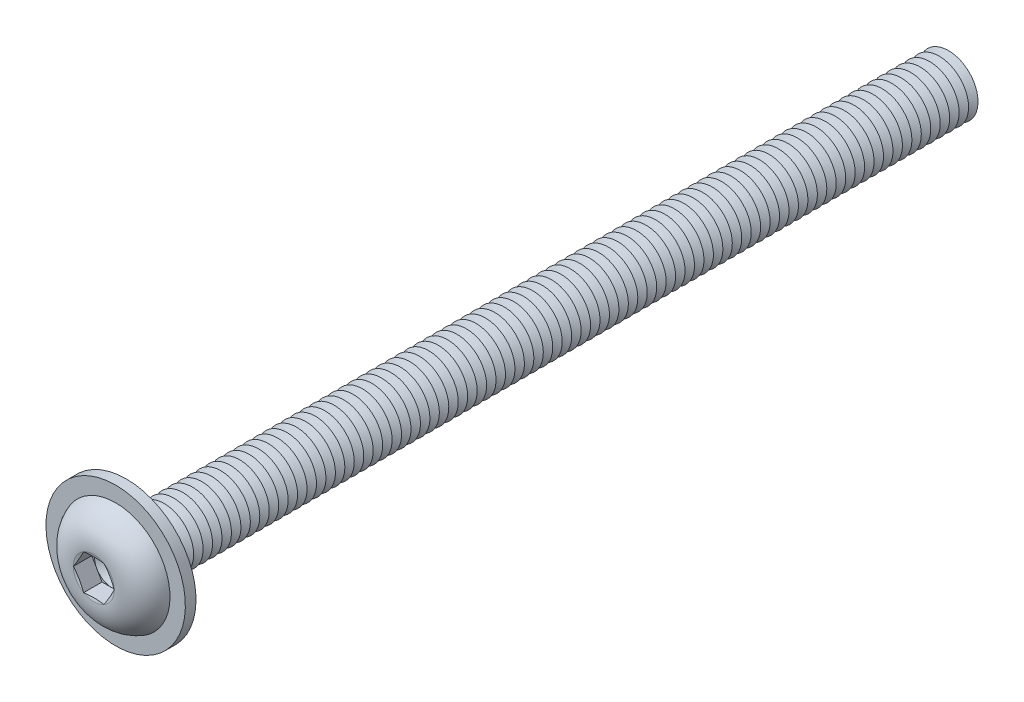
ISO-10303-21;
HEADER;
FILE_DESCRIPTION(('STEP AP214'),'2;1');
FILE_NAME('part.step','',(''),(''),'','','');
FILE_SCHEMA(('AUTOMOTIVE_DESIGN { 1 0 10303 214 1 1 1 1 }'));
ENDSEC;
DATA;
#1=APPLICATION_CONTEXT('core data for automotive mechanical design processes');
#2=APPLICATION_PROTOCOL_DEFINITION('international standard','automotive_design',2000,#1);
#3=PRODUCT_CONTEXT('',#1,'mechanical');
#4=PRODUCT('Part','Part','',(#3));
#5=PRODUCT_RELATED_PRODUCT_CATEGORY('part','',(#4));
#6=PRODUCT_DEFINITION_FORMATION('','',#4);
#7=PRODUCT_DEFINITION_CONTEXT('part definition',#1,'design');
#8=PRODUCT_DEFINITION('design','',#6,#7);
#9=PRODUCT_DEFINITION_SHAPE('','',#8);
#10=(LENGTH_UNIT() NAMED_UNIT(*) SI_UNIT(.MILLI.,.METRE.));
#11=(NAMED_UNIT(*) PLANE_ANGLE_UNIT() SI_UNIT($,.RADIAN.));
#12=(NAMED_UNIT(*) SI_UNIT($,.STERADIAN.) SOLID_ANGLE_UNIT());
#13=UNCERTAINTY_MEASURE_WITH_UNIT(LENGTH_MEASURE(1.E-05),#10,'distance_accuracy_value','');
#14=(GEOMETRIC_REPRESENTATION_CONTEXT(3) GLOBAL_UNCERTAINTY_ASSIGNED_CONTEXT((#13)) GLOBAL_UNIT_ASSIGNED_CONTEXT((#10,
#11,#12)) REPRESENTATION_CONTEXT('',''));
#15=CARTESIAN_POINT('',(0.,0.,0.));
#16=DIRECTION('',(0.,0.,1.));
#17=DIRECTION('',(1.,0.,0.));
#18=AXIS2_PLACEMENT_3D('',#15,#16,#17);
#19=CARTESIAN_POINT('',(0.,0.,-67.2));
#20=DIRECTION('',(0.,0.,1.));
#21=DIRECTION('',(0.,-1.,0.));
#22=AXIS2_PLACEMENT_3D('',#19,#20,#21);
#23=CONICAL_SURFACE('',#22,2.49999999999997,1.0471975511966);
#24=CARTESIAN_POINT('',(0.,0.,-67.6));
#25=DIRECTION('',(0.,0.,1.));
#26=DIRECTION('',(0.,-1.,0.));
#27=AXIS2_PLACEMENT_3D('',#24,#25,#26);
#28=CIRCLE('',#27,1.80717967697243);
#29=CARTESIAN_POINT('',(0.,-1.80717967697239,-67.6));
#30=VERTEX_POINT('',#29);
#31=EDGE_CURVE('E904',#30,#30,#28,.T.);
#32=ORIENTED_EDGE('',*,*,#31,.T.);
#33=EDGE_LOOP('',(#32));
#34=FACE_BOUND('',#33,.T.);
#35=CARTESIAN_POINT('',(0.,0.,-67.2));
#36=DIRECTION('',(0.,0.,1.));
#37=DIRECTION('',(0.,-1.,0.));
#38=AXIS2_PLACEMENT_3D('',#35,#36,#37);
#39=CIRCLE('',#38,2.49999999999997);
#40=CARTESIAN_POINT('',(0.,-2.49999999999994,-67.2));
#41=VERTEX_POINT('',#40);
#42=EDGE_CURVE('E900',#41,#41,#39,.T.);
#43=ORIENTED_EDGE('',*,*,#42,.F.);
#44=EDGE_LOOP('',(#43));
#45=FACE_BOUND('',#44,.T.);
#46=ADVANCED_FACE('F39',(#34,#45),#23,.T.);
#47=CARTESIAN_POINT('',(0.,0.,-67.6));
#48=DIRECTION('',(0.,0.,-1.));
#49=DIRECTION('',(0.,1.,0.));
#50=AXIS2_PLACEMENT_3D('',#47,#48,#49);
#51=CONICAL_SURFACE('',#50,1.80717967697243,1.0471975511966);
#52=CARTESIAN_POINT('',(0.,0.,-68.));
#53=DIRECTION('',(0.,0.,1.));
#54=DIRECTION('',(0.,-1.,0.));
#55=AXIS2_PLACEMENT_3D('',#52,#53,#54);
#56=CIRCLE('',#55,2.49999999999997);
#57=CARTESIAN_POINT('',(0.,-2.49999999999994,-68.));
#58=VERTEX_POINT('',#57);
#59=EDGE_CURVE('E908',#58,#58,#56,.T.);
#60=ORIENTED_EDGE('',*,*,#59,.T.);
#61=EDGE_LOOP('',(#60));
#62=FACE_BOUND('',#61,.T.);
#63=ORIENTED_EDGE('',*,*,#31,.F.);
#64=EDGE_LOOP('',(#63));
#65=FACE_BOUND('',#64,.T.);
#66=ADVANCED_FACE('F1029',(#62,#65),#51,.T.);
#67=CARTESIAN_POINT('',(0.,2.49999999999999,-70.));
#68=DIRECTION('',(0.,0.,-1.));
#69=DIRECTION('',(0.,1.,0.));
#70=AXIS2_PLACEMENT_3D('',#67,#68,#69);
#71=PLANE('',#70);
#72=CARTESIAN_POINT('',(0.,0.,-70.));
#73=DIRECTION('',(0.,0.,1.));
#74=DIRECTION('',(0.,-1.,0.));
#75=AXIS2_PLACEMENT_3D('',#72,#73,#74);
#76=CIRCLE('',#75,1.80717967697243);
#77=CARTESIAN_POINT('',(0.,-1.80717967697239,-70.));
#78=VERTEX_POINT('',#77);
#79=EDGE_CURVE('E928',#78,#78,#76,.T.);
#80=ORIENTED_EDGE('',*,*,#79,.F.);
#81=EDGE_LOOP('',(#80));
#82=FACE_BOUND('',#81,.T.);
#83=ADVANCED_FACE('F1035',(#82),#71,.T.);
#84=CARTESIAN_POINT('',(0.,0.,-69.6));
#85=DIRECTION('',(0.,0.,1.));
#86=DIRECTION('',(0.,-1.,0.));
#87=AXIS2_PLACEMENT_3D('',#84,#85,#86);
#88=CONICAL_SURFACE('',#87,2.49999999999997,1.0471975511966);
#89=ORIENTED_EDGE('',*,*,#79,.T.);
#90=EDGE_LOOP('',(#89));
#91=FACE_BOUND('',#90,.T.);
#92=CARTESIAN_POINT('',(0.,0.,-69.6));
#93=DIRECTION('',(0.,0.,1.));
#94=DIRECTION('',(0.,-1.,0.));
#95=AXIS2_PLACEMENT_3D('',#92,#93,#94);
#96=CIRCLE('',#95,2.49999999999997);
#97=CARTESIAN_POINT('',(0.,-2.49999999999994,-69.6));
#98=VERTEX_POINT('',#97);
#99=EDGE_CURVE('E924',#98,#98,#96,.T.);
#100=ORIENTED_EDGE('',*,*,#99,.F.);
#101=EDGE_LOOP('',(#100));
#102=FACE_BOUND('',#101,.T.);
#103=ADVANCED_FACE('F1054',(#91,#102),#88,.T.);
#104=CARTESIAN_POINT('',(0.,0.,-69.2));
#105=DIRECTION('',(0.,0.,-1.));
#106=DIRECTION('',(0.,1.,0.));
#107=AXIS2_PLACEMENT_3D('',#104,#105,#106);
#108=CONICAL_SURFACE('',#107,1.80717967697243,1.0471975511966);
#109=ORIENTED_EDGE('',*,*,#99,.T.);
#110=EDGE_LOOP('',(#109));
#111=FACE_BOUND('',#110,.T.);
#112=CARTESIAN_POINT('',(0.,0.,-69.2));
#113=DIRECTION('',(0.,0.,1.));
#114=DIRECTION('',(0.,-1.,0.));
#115=AXIS2_PLACEMENT_3D('',#112,#113,#114);
#116=CIRCLE('',#115,1.80717967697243);
#117=CARTESIAN_POINT('',(0.,-1.80717967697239,-69.2));
#118=VERTEX_POINT('',#117);
#119=EDGE_CURVE('E920',#118,#118,#116,.T.);
#120=ORIENTED_EDGE('',*,*,#119,.F.);
#121=EDGE_LOOP('',(#120));
#122=FACE_BOUND('',#121,.T.);
#123=ADVANCED_FACE('F1051',(#111,#122),#108,.T.);
#124=CARTESIAN_POINT('',(0.,0.,-68.8));
#125=DIRECTION('',(0.,0.,1.));
#126=DIRECTION('',(0.,-1.,0.));
#127=AXIS2_PLACEMENT_3D('',#124,#125,#126);
#128=CONICAL_SURFACE('',#127,2.49999999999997,1.0471975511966);
#129=ORIENTED_EDGE('',*,*,#119,.T.);
#130=EDGE_LOOP('',(#129));
#131=FACE_BOUND('',#130,.T.);
#132=CARTESIAN_POINT('',(0.,0.,-68.8));
#133=DIRECTION('',(0.,0.,1.));
#134=DIRECTION('',(0.,-1.,0.));
#135=AXIS2_PLACEMENT_3D('',#132,#133,#134);
#136=CIRCLE('',#135,2.49999999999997);
#137=CARTESIAN_POINT('',(0.,-2.49999999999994,-68.8));
#138=VERTEX_POINT('',#137);
#139=EDGE_CURVE('E916',#138,#138,#136,.T.);
#140=ORIENTED_EDGE('',*,*,#139,.F.);
#141=EDGE_LOOP('',(#140));
#142=FACE_BOUND('',#141,.T.);
#143=ADVANCED_FACE('F1045',(#131,#142),#128,.T.);
#144=CARTESIAN_POINT('',(0.,0.,-68.4));
#145=DIRECTION('',(0.,0.,-1.));
#146=DIRECTION('',(0.,1.,0.));
#147=AXIS2_PLACEMENT_3D('',#144,#145,#146);
#148=CONICAL_SURFACE('',#147,1.80717967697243,1.0471975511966);
#149=ORIENTED_EDGE('',*,*,#139,.T.);
#150=EDGE_LOOP('',(#149));
#151=FACE_BOUND('',#150,.T.);
#152=CARTESIAN_POINT('',(0.,0.,-68.4));
#153=DIRECTION('',(0.,0.,1.));
#154=DIRECTION('',(0.,-1.,0.));
#155=AXIS2_PLACEMENT_3D('',#152,#153,#154);
#156=CIRCLE('',#155,1.80717967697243);
#157=CARTESIAN_POINT('',(0.,-1.80717967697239,-68.4));
#158=VERTEX_POINT('',#157);
#159=EDGE_CURVE('E912',#158,#158,#156,.T.);
#160=ORIENTED_EDGE('',*,*,#159,.F.);
#161=EDGE_LOOP('',(#160));
#162=FACE_BOUND('',#161,.T.);
#163=ADVANCED_FACE('F1041',(#151,#162),#148,.T.);
#164=CARTESIAN_POINT('',(0.,0.,-68.));
#165=DIRECTION('',(0.,0.,1.));
#166=DIRECTION('',(0.,-1.,0.));
#167=AXIS2_PLACEMENT_3D('',#164,#165,#166);
#168=CONICAL_SURFACE('',#167,2.49999999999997,1.0471975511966);
#169=ORIENTED_EDGE('',*,*,#159,.T.);
#170=EDGE_LOOP('',(#169));
#171=FACE_BOUND('',#170,.T.);
#172=ORIENTED_EDGE('',*,*,#59,.F.);
#173=EDGE_LOOP('',(#172));
#174=FACE_BOUND('',#173,.T.);
#175=ADVANCED_FACE('F1044',(#171,#174),#168,.T.);
#176=CARTESIAN_POINT('',(0.,0.,-66.4));
#177=DIRECTION('',(0.,0.,1.));
#178=DIRECTION('',(0.,-1.,0.));
#179=AXIS2_PLACEMENT_3D('',#176,#177,#178);
#180=CONICAL_SURFACE('',#179,2.49999999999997,1.0471975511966);
#181=CARTESIAN_POINT('',(0.,0.,-66.8));
#182=DIRECTION('',(0.,0.,1.));
#183=DIRECTION('',(0.,-1.,0.));
#184=AXIS2_PLACEMENT_3D('',#181,#182,#183);
#185=CIRCLE('',#184,1.80717967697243);
#186=CARTESIAN_POINT('',(0.,-1.80717967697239,-66.8));
#187=VERTEX_POINT('',#186);
#188=EDGE_CURVE('E896',#187,#187,#185,.T.);
#189=ORIENTED_EDGE('',*,*,#188,.T.);
#190=EDGE_LOOP('',(#189));
#191=FACE_BOUND('',#190,.T.);
#192=CARTESIAN_POINT('',(0.,0.,-66.4));
#193=DIRECTION('',(0.,0.,1.));
#194=DIRECTION('',(0.,-1.,0.));
#195=AXIS2_PLACEMENT_3D('',#192,#193,#194);
#196=CIRCLE('',#195,2.49999999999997);
#197=CARTESIAN_POINT('',(0.,-2.49999999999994,-66.4));
#198=VERTEX_POINT('',#197);
#199=EDGE_CURVE('E892',#198,#198,#196,.T.);
#200=ORIENTED_EDGE('',*,*,#199,.F.);
#201=EDGE_LOOP('',(#200));
#202=FACE_BOUND('',#201,.T.);
#203=ADVANCED_FACE('F1049',(#191,#202),#180,.T.);
#204=CARTESIAN_POINT('',(0.,0.,-66.8));
#205=DIRECTION('',(0.,0.,-1.));
#206=DIRECTION('',(0.,1.,0.));
#207=AXIS2_PLACEMENT_3D('',#204,#205,#206);
#208=CONICAL_SURFACE('',#207,1.80717967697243,1.0471975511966);
#209=ORIENTED_EDGE('',*,*,#42,.T.);
#210=EDGE_LOOP('',(#209));
#211=FACE_BOUND('',#210,.T.);
#212=ORIENTED_EDGE('',*,*,#188,.F.);
#213=EDGE_LOOP('',(#212));
#214=FACE_BOUND('',#213,.T.);
#215=ADVANCED_FACE('F1100',(#211,#214),#208,.T.);
#216=CARTESIAN_POINT('',(0.,0.,-65.6));
#217=DIRECTION('',(0.,0.,1.));
#218=DIRECTION('',(0.,-1.,0.));
#219=AXIS2_PLACEMENT_3D('',#216,#217,#218);
#220=CONICAL_SURFACE('',#219,2.49999999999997,1.0471975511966);
#221=CARTESIAN_POINT('',(0.,0.,-66.));
#222=DIRECTION('',(0.,0.,1.));
#223=DIRECTION('',(0.,-1.,0.));
#224=AXIS2_PLACEMENT_3D('',#221,#222,#223);
#225=CIRCLE('',#224,1.80717967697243);
#226=CARTESIAN_POINT('',(0.,-1.80717967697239,-66.));
#227=VERTEX_POINT('',#226);
#228=EDGE_CURVE('E888',#227,#227,#225,.T.);
#229=ORIENTED_EDGE('',*,*,#228,.T.);
#230=EDGE_LOOP('',(#229));
#231=FACE_BOUND('',#230,.T.);
#232=CARTESIAN_POINT('',(0.,0.,-65.6));
#233=DIRECTION('',(0.,0.,1.));
#234=DIRECTION('',(0.,-1.,0.));
#235=AXIS2_PLACEMENT_3D('',#232,#233,#234);
#236=CIRCLE('',#235,2.49999999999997);
#237=CARTESIAN_POINT('',(0.,-2.49999999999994,-65.6));
#238=VERTEX_POINT('',#237);
#239=EDGE_CURVE('E884',#238,#238,#236,.T.);
#240=ORIENTED_EDGE('',*,*,#239,.F.);
#241=EDGE_LOOP('',(#240));
#242=FACE_BOUND('',#241,.T.);
#243=ADVANCED_FACE('F1106',(#231,#242),#220,.T.);
#244=CARTESIAN_POINT('',(0.,0.,-66.));
#245=DIRECTION('',(0.,0.,-1.));
#246=DIRECTION('',(0.,1.,0.));
#247=AXIS2_PLACEMENT_3D('',#244,#245,#246);
#248=CONICAL_SURFACE('',#247,1.80717967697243,1.0471975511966);
#249=ORIENTED_EDGE('',*,*,#199,.T.);
#250=EDGE_LOOP('',(#249));
#251=FACE_BOUND('',#250,.T.);
#252=ORIENTED_EDGE('',*,*,#228,.F.);
#253=EDGE_LOOP('',(#252));
#254=FACE_BOUND('',#253,.T.);
#255=ADVANCED_FACE('F1113',(#251,#254),#248,.T.);
#256=CARTESIAN_POINT('',(0.,0.,-64.8));
#257=DIRECTION('',(0.,0.,1.));
#258=DIRECTION('',(0.,-1.,0.));
#259=AXIS2_PLACEMENT_3D('',#256,#257,#258);
#260=CONICAL_SURFACE('',#259,2.49999999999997,1.0471975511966);
#261=CARTESIAN_POINT('',(0.,0.,-65.2));
#262=DIRECTION('',(0.,0.,1.));
#263=DIRECTION('',(0.,-1.,0.));
#264=AXIS2_PLACEMENT_3D('',#261,#262,#263);
#265=CIRCLE('',#264,1.80717967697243);
#266=CARTESIAN_POINT('',(0.,-1.8071796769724,-65.2));
#267=VERTEX_POINT('',#266);
#268=EDGE_CURVE('E880',#267,#267,#265,.T.);
#269=ORIENTED_EDGE('',*,*,#268,.T.);
#270=EDGE_LOOP('',(#269));
#271=FACE_BOUND('',#270,.T.);
#272=CARTESIAN_POINT('',(0.,0.,-64.8));
#273=DIRECTION('',(0.,0.,1.));
#274=DIRECTION('',(0.,-1.,0.));
#275=AXIS2_PLACEMENT_3D('',#272,#273,#274);
#276=CIRCLE('',#275,2.49999999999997);
#277=CARTESIAN_POINT('',(0.,-2.49999999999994,-64.8));
#278=VERTEX_POINT('',#277);
#279=EDGE_CURVE('E876',#278,#278,#276,.T.);
#280=ORIENTED_EDGE('',*,*,#279,.F.);
#281=EDGE_LOOP('',(#280));
#282=FACE_BOUND('',#281,.T.);
#283=ADVANCED_FACE('F1120',(#271,#282),#260,.T.);
#284=CARTESIAN_POINT('',(0.,0.,-65.2));
#285=DIRECTION('',(0.,0.,-1.));
#286=DIRECTION('',(0.,1.,0.));
#287=AXIS2_PLACEMENT_3D('',#284,#285,#286);
#288=CONICAL_SURFACE('',#287,1.80717967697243,1.0471975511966);
#289=ORIENTED_EDGE('',*,*,#239,.T.);
#290=EDGE_LOOP('',(#289));
#291=FACE_BOUND('',#290,.T.);
#292=ORIENTED_EDGE('',*,*,#268,.F.);
#293=EDGE_LOOP('',(#292));
#294=FACE_BOUND('',#293,.T.);
#295=ADVANCED_FACE('F1127',(#291,#294),#288,.T.);
#296=CARTESIAN_POINT('',(0.,0.,-64.));
#297=DIRECTION('',(0.,0.,1.));
#298=DIRECTION('',(0.,-1.,0.));
#299=AXIS2_PLACEMENT_3D('',#296,#297,#298);
#300=CONICAL_SURFACE('',#299,2.49999999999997,1.0471975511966);
#301=CARTESIAN_POINT('',(0.,0.,-64.4));
#302=DIRECTION('',(0.,0.,1.));
#303=DIRECTION('',(0.,-1.,0.));
#304=AXIS2_PLACEMENT_3D('',#301,#302,#303);
#305=CIRCLE('',#304,1.80717967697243);
#306=CARTESIAN_POINT('',(0.,-1.8071796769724,-64.4));
#307=VERTEX_POINT('',#306);
#308=EDGE_CURVE('E872',#307,#307,#305,.T.);
#309=ORIENTED_EDGE('',*,*,#308,.T.);
#310=EDGE_LOOP('',(#309));
#311=FACE_BOUND('',#310,.T.);
#312=CARTESIAN_POINT('',(0.,0.,-64.));
#313=DIRECTION('',(0.,0.,1.));
#314=DIRECTION('',(0.,-1.,0.));
#315=AXIS2_PLACEMENT_3D('',#312,#313,#314);
#316=CIRCLE('',#315,2.49999999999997);
#317=CARTESIAN_POINT('',(0.,-2.49999999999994,-64.));
#318=VERTEX_POINT('',#317);
#319=EDGE_CURVE('E868',#318,#318,#316,.T.);
#320=ORIENTED_EDGE('',*,*,#319,.F.);
#321=EDGE_LOOP('',(#320));
#322=FACE_BOUND('',#321,.T.);
#323=ADVANCED_FACE('F1134',(#311,#322),#300,.T.);
#324=CARTESIAN_POINT('',(0.,0.,-64.4));
#325=DIRECTION('',(0.,0.,-1.));
#326=DIRECTION('',(0.,1.,0.));
#327=AXIS2_PLACEMENT_3D('',#324,#325,#326);
#328=CONICAL_SURFACE('',#327,1.80717967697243,1.0471975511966);
#329=ORIENTED_EDGE('',*,*,#279,.T.);
#330=EDGE_LOOP('',(#329));
#331=FACE_BOUND('',#330,.T.);
#332=ORIENTED_EDGE('',*,*,#308,.F.);
#333=EDGE_LOOP('',(#332));
#334=FACE_BOUND('',#333,.T.);
#335=ADVANCED_FACE('F1141',(#331,#334),#328,.T.);
#336=CARTESIAN_POINT('',(0.,0.,-63.2));
#337=DIRECTION('',(0.,0.,1.));
#338=DIRECTION('',(0.,-1.,0.));
#339=AXIS2_PLACEMENT_3D('',#336,#337,#338);
#340=CONICAL_SURFACE('',#339,2.49999999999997,1.0471975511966);
#341=CARTESIAN_POINT('',(0.,0.,-63.6));
#342=DIRECTION('',(0.,0.,1.));
#343=DIRECTION('',(0.,-1.,0.));
#344=AXIS2_PLACEMENT_3D('',#341,#342,#343);
#345=CIRCLE('',#344,1.80717967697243);
#346=CARTESIAN_POINT('',(0.,-1.8071796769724,-63.6));
#347=VERTEX_POINT('',#346);
#348=EDGE_CURVE('E864',#347,#347,#345,.T.);
#349=ORIENTED_EDGE('',*,*,#348,.T.);
#350=EDGE_LOOP('',(#349));
#351=FACE_BOUND('',#350,.T.);
#352=CARTESIAN_POINT('',(0.,0.,-63.2));
#353=DIRECTION('',(0.,0.,1.));
#354=DIRECTION('',(0.,-1.,0.));
#355=AXIS2_PLACEMENT_3D('',#352,#353,#354);
#356=CIRCLE('',#355,2.49999999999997);
#357=CARTESIAN_POINT('',(0.,-2.49999999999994,-63.2));
#358=VERTEX_POINT('',#357);
#359=EDGE_CURVE('E860',#358,#358,#356,.T.);
#360=ORIENTED_EDGE('',*,*,#359,.F.);
#361=EDGE_LOOP('',(#360));
#362=FACE_BOUND('',#361,.T.);
#363=ADVANCED_FACE('F1148',(#351,#362),#340,.T.);
#364=CARTESIAN_POINT('',(0.,0.,-63.6));
#365=DIRECTION('',(0.,0.,-1.));
#366=DIRECTION('',(0.,1.,0.));
#367=AXIS2_PLACEMENT_3D('',#364,#365,#366);
#368=CONICAL_SURFACE('',#367,1.80717967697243,1.0471975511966);
#369=ORIENTED_EDGE('',*,*,#319,.T.);
#370=EDGE_LOOP('',(#369));
#371=FACE_BOUND('',#370,.T.);
#372=ORIENTED_EDGE('',*,*,#348,.F.);
#373=EDGE_LOOP('',(#372));
#374=FACE_BOUND('',#373,.T.);
#375=ADVANCED_FACE('F1155',(#371,#374),#368,.T.);
#376=CARTESIAN_POINT('',(0.,0.,-62.4));
#377=DIRECTION('',(0.,0.,1.));
#378=DIRECTION('',(0.,-1.,0.));
#379=AXIS2_PLACEMENT_3D('',#376,#377,#378);
#380=CONICAL_SURFACE('',#379,2.49999999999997,1.0471975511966);
#381=CARTESIAN_POINT('',(0.,0.,-62.8));
#382=DIRECTION('',(0.,0.,1.));
#383=DIRECTION('',(0.,-1.,0.));
#384=AXIS2_PLACEMENT_3D('',#381,#382,#383);
#385=CIRCLE('',#384,1.80717967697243);
#386=CARTESIAN_POINT('',(0.,-1.8071796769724,-62.8));
#387=VERTEX_POINT('',#386);
#388=EDGE_CURVE('E856',#387,#387,#385,.T.);
#389=ORIENTED_EDGE('',*,*,#388,.T.);
#390=EDGE_LOOP('',(#389));
#391=FACE_BOUND('',#390,.T.);
#392=CARTESIAN_POINT('',(0.,0.,-62.4));
#393=DIRECTION('',(0.,0.,1.));
#394=DIRECTION('',(0.,-1.,0.));
#395=AXIS2_PLACEMENT_3D('',#392,#393,#394);
#396=CIRCLE('',#395,2.49999999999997);
#397=CARTESIAN_POINT('',(0.,-2.49999999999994,-62.4));
#398=VERTEX_POINT('',#397);
#399=EDGE_CURVE('E852',#398,#398,#396,.T.);
#400=ORIENTED_EDGE('',*,*,#399,.F.);
#401=EDGE_LOOP('',(#400));
#402=FACE_BOUND('',#401,.T.);
#403=ADVANCED_FACE('F1162',(#391,#402),#380,.T.);
#404=CARTESIAN_POINT('',(0.,0.,-62.8));
#405=DIRECTION('',(0.,0.,-1.));
#406=DIRECTION('',(0.,1.,0.));
#407=AXIS2_PLACEMENT_3D('',#404,#405,#406);
#408=CONICAL_SURFACE('',#407,1.80717967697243,1.0471975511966);
#409=ORIENTED_EDGE('',*,*,#359,.T.);
#410=EDGE_LOOP('',(#409));
#411=FACE_BOUND('',#410,.T.);
#412=ORIENTED_EDGE('',*,*,#388,.F.);
#413=EDGE_LOOP('',(#412));
#414=FACE_BOUND('',#413,.T.);
#415=ADVANCED_FACE('F1169',(#411,#414),#408,.T.);
#416=CARTESIAN_POINT('',(0.,0.,-61.6));
#417=DIRECTION('',(0.,0.,1.));
#418=DIRECTION('',(0.,-1.,0.));
#419=AXIS2_PLACEMENT_3D('',#416,#417,#418);
#420=CONICAL_SURFACE('',#419,2.49999999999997,1.0471975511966);
#421=CARTESIAN_POINT('',(0.,0.,-62.));
#422=DIRECTION('',(0.,0.,1.));
#423=DIRECTION('',(0.,-1.,0.));
#424=AXIS2_PLACEMENT_3D('',#421,#422,#423);
#425=CIRCLE('',#424,1.80717967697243);
#426=CARTESIAN_POINT('',(0.,-1.8071796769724,-62.));
#427=VERTEX_POINT('',#426);
#428=EDGE_CURVE('E848',#427,#427,#425,.T.);
#429=ORIENTED_EDGE('',*,*,#428,.T.);
#430=EDGE_LOOP('',(#429));
#431=FACE_BOUND('',#430,.T.);
#432=CARTESIAN_POINT('',(0.,0.,-61.6));
#433=DIRECTION('',(0.,0.,1.));
#434=DIRECTION('',(0.,-1.,0.));
#435=AXIS2_PLACEMENT_3D('',#432,#433,#434);
#436=CIRCLE('',#435,2.49999999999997);
#437=CARTESIAN_POINT('',(0.,-2.49999999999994,-61.6));
#438=VERTEX_POINT('',#437);
#439=EDGE_CURVE('E844',#438,#438,#436,.T.);
#440=ORIENTED_EDGE('',*,*,#439,.F.);
#441=EDGE_LOOP('',(#440));
#442=FACE_BOUND('',#441,.T.);
#443=ADVANCED_FACE('F1176',(#431,#442),#420,.T.);
#444=CARTESIAN_POINT('',(0.,0.,-62.));
#445=DIRECTION('',(0.,0.,-1.));
#446=DIRECTION('',(0.,1.,0.));
#447=AXIS2_PLACEMENT_3D('',#444,#445,#446);
#448=CONICAL_SURFACE('',#447,1.80717967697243,1.0471975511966);
#449=ORIENTED_EDGE('',*,*,#399,.T.);
#450=EDGE_LOOP('',(#449));
#451=FACE_BOUND('',#450,.T.);
#452=ORIENTED_EDGE('',*,*,#428,.F.);
#453=EDGE_LOOP('',(#452));
#454=FACE_BOUND('',#453,.T.);
#455=ADVANCED_FACE('F1183',(#451,#454),#448,.T.);
#456=CARTESIAN_POINT('',(0.,0.,-60.8));
#457=DIRECTION('',(0.,0.,1.));
#458=DIRECTION('',(0.,-1.,0.));
#459=AXIS2_PLACEMENT_3D('',#456,#457,#458);
#460=CONICAL_SURFACE('',#459,2.49999999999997,1.0471975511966);
#461=CARTESIAN_POINT('',(0.,0.,-61.2));
#462=DIRECTION('',(0.,0.,1.));
#463=DIRECTION('',(0.,-1.,0.));
#464=AXIS2_PLACEMENT_3D('',#461,#462,#463);
#465=CIRCLE('',#464,1.80717967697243);
#466=CARTESIAN_POINT('',(0.,-1.8071796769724,-61.2));
#467=VERTEX_POINT('',#466);
#468=EDGE_CURVE('E840',#467,#467,#465,.T.);
#469=ORIENTED_EDGE('',*,*,#468,.T.);
#470=EDGE_LOOP('',(#469));
#471=FACE_BOUND('',#470,.T.);
#472=CARTESIAN_POINT('',(0.,0.,-60.8));
#473=DIRECTION('',(0.,0.,1.));
#474=DIRECTION('',(0.,-1.,0.));
#475=AXIS2_PLACEMENT_3D('',#472,#473,#474);
#476=CIRCLE('',#475,2.49999999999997);
#477=CARTESIAN_POINT('',(0.,-2.49999999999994,-60.8));
#478=VERTEX_POINT('',#477);
#479=EDGE_CURVE('E836',#478,#478,#476,.T.);
#480=ORIENTED_EDGE('',*,*,#479,.F.);
#481=EDGE_LOOP('',(#480));
#482=FACE_BOUND('',#481,.T.);
#483=ADVANCED_FACE('F1190',(#471,#482),#460,.T.);
#484=CARTESIAN_POINT('',(0.,0.,-61.2));
#485=DIRECTION('',(0.,0.,-1.));
#486=DIRECTION('',(0.,1.,0.));
#487=AXIS2_PLACEMENT_3D('',#484,#485,#486);
#488=CONICAL_SURFACE('',#487,1.80717967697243,1.0471975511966);
#489=ORIENTED_EDGE('',*,*,#439,.T.);
#490=EDGE_LOOP('',(#489));
#491=FACE_BOUND('',#490,.T.);
#492=ORIENTED_EDGE('',*,*,#468,.F.);
#493=EDGE_LOOP('',(#492));
#494=FACE_BOUND('',#493,.T.);
#495=ADVANCED_FACE('F1197',(#491,#494),#488,.T.);
#496=CARTESIAN_POINT('',(0.,0.,-60.));
#497=DIRECTION('',(0.,0.,1.));
#498=DIRECTION('',(0.,-1.,0.));
#499=AXIS2_PLACEMENT_3D('',#496,#497,#498);
#500=CONICAL_SURFACE('',#499,2.49999999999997,1.0471975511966);
#501=CARTESIAN_POINT('',(0.,0.,-60.4));
#502=DIRECTION('',(0.,0.,1.));
#503=DIRECTION('',(0.,-1.,0.));
#504=AXIS2_PLACEMENT_3D('',#501,#502,#503);
#505=CIRCLE('',#504,1.80717967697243);
#506=CARTESIAN_POINT('',(0.,-1.8071796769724,-60.4));
#507=VERTEX_POINT('',#506);
#508=EDGE_CURVE('E832',#507,#507,#505,.T.);
#509=ORIENTED_EDGE('',*,*,#508,.T.);
#510=EDGE_LOOP('',(#509));
#511=FACE_BOUND('',#510,.T.);
#512=CARTESIAN_POINT('',(0.,0.,-60.));
#513=DIRECTION('',(0.,0.,1.));
#514=DIRECTION('',(0.,-1.,0.));
#515=AXIS2_PLACEMENT_3D('',#512,#513,#514);
#516=CIRCLE('',#515,2.49999999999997);
#517=CARTESIAN_POINT('',(0.,-2.49999999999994,-60.));
#518=VERTEX_POINT('',#517);
#519=EDGE_CURVE('E828',#518,#518,#516,.T.);
#520=ORIENTED_EDGE('',*,*,#519,.F.);
#521=EDGE_LOOP('',(#520));
#522=FACE_BOUND('',#521,.T.);
#523=ADVANCED_FACE('F1204',(#511,#522),#500,.T.);
#524=CARTESIAN_POINT('',(0.,0.,-60.4));
#525=DIRECTION('',(0.,0.,-1.));
#526=DIRECTION('',(0.,1.,0.));
#527=AXIS2_PLACEMENT_3D('',#524,#525,#526);
#528=CONICAL_SURFACE('',#527,1.80717967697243,1.0471975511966);
#529=ORIENTED_EDGE('',*,*,#479,.T.);
#530=EDGE_LOOP('',(#529));
#531=FACE_BOUND('',#530,.T.);
#532=ORIENTED_EDGE('',*,*,#508,.F.);
#533=EDGE_LOOP('',(#532));
#534=FACE_BOUND('',#533,.T.);
#535=ADVANCED_FACE('F1211',(#531,#534),#528,.T.);
#536=CARTESIAN_POINT('',(0.,0.,-59.2));
#537=DIRECTION('',(0.,0.,1.));
#538=DIRECTION('',(0.,-1.,0.));
#539=AXIS2_PLACEMENT_3D('',#536,#537,#538);
#540=CONICAL_SURFACE('',#539,2.49999999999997,1.0471975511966);
#541=CARTESIAN_POINT('',(0.,0.,-59.6));
#542=DIRECTION('',(0.,0.,1.));
#543=DIRECTION('',(0.,-1.,0.));
#544=AXIS2_PLACEMENT_3D('',#541,#542,#543);
#545=CIRCLE('',#544,1.80717967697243);
#546=CARTESIAN_POINT('',(0.,-1.8071796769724,-59.6));
#547=VERTEX_POINT('',#546);
#548=EDGE_CURVE('E824',#547,#547,#545,.T.);
#549=ORIENTED_EDGE('',*,*,#548,.T.);
#550=EDGE_LOOP('',(#549));
#551=FACE_BOUND('',#550,.T.);
#552=CARTESIAN_POINT('',(0.,0.,-59.2));
#553=DIRECTION('',(0.,0.,1.));
#554=DIRECTION('',(0.,-1.,0.));
#555=AXIS2_PLACEMENT_3D('',#552,#553,#554);
#556=CIRCLE('',#555,2.49999999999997);
#557=CARTESIAN_POINT('',(0.,-2.49999999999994,-59.2));
#558=VERTEX_POINT('',#557);
#559=EDGE_CURVE('E820',#558,#558,#556,.T.);
#560=ORIENTED_EDGE('',*,*,#559,.F.);
#561=EDGE_LOOP('',(#560));
#562=FACE_BOUND('',#561,.T.);
#563=ADVANCED_FACE('F1218',(#551,#562),#540,.T.);
#564=CARTESIAN_POINT('',(0.,0.,-59.6));
#565=DIRECTION('',(0.,0.,-1.));
#566=DIRECTION('',(0.,1.,0.));
#567=AXIS2_PLACEMENT_3D('',#564,#565,#566);
#568=CONICAL_SURFACE('',#567,1.80717967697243,1.0471975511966);
#569=ORIENTED_EDGE('',*,*,#519,.T.);
#570=EDGE_LOOP('',(#569));
#571=FACE_BOUND('',#570,.T.);
#572=ORIENTED_EDGE('',*,*,#548,.F.);
#573=EDGE_LOOP('',(#572));
#574=FACE_BOUND('',#573,.T.);
#575=ADVANCED_FACE('F1225',(#571,#574),#568,.T.);
#576=CARTESIAN_POINT('',(0.,0.,-58.4));
#577=DIRECTION('',(0.,0.,1.));
#578=DIRECTION('',(0.,-1.,0.));
#579=AXIS2_PLACEMENT_3D('',#576,#577,#578);
#580=CONICAL_SURFACE('',#579,2.49999999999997,1.0471975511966);
#581=CARTESIAN_POINT('',(0.,0.,-58.8));
#582=DIRECTION('',(0.,0.,1.));
#583=DIRECTION('',(0.,-1.,0.));
#584=AXIS2_PLACEMENT_3D('',#581,#582,#583);
#585=CIRCLE('',#584,1.80717967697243);
#586=CARTESIAN_POINT('',(0.,-1.8071796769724,-58.8));
#587=VERTEX_POINT('',#586);
#588=EDGE_CURVE('E816',#587,#587,#585,.T.);
#589=ORIENTED_EDGE('',*,*,#588,.T.);
#590=EDGE_LOOP('',(#589));
#591=FACE_BOUND('',#590,.T.);
#592=CARTESIAN_POINT('',(0.,0.,-58.4));
#593=DIRECTION('',(0.,0.,1.));
#594=DIRECTION('',(0.,-1.,0.));
#595=AXIS2_PLACEMENT_3D('',#592,#593,#594);
#596=CIRCLE('',#595,2.49999999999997);
#597=CARTESIAN_POINT('',(0.,-2.49999999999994,-58.4));
#598=VERTEX_POINT('',#597);
#599=EDGE_CURVE('E812',#598,#598,#596,.T.);
#600=ORIENTED_EDGE('',*,*,#599,.F.);
#601=EDGE_LOOP('',(#600));
#602=FACE_BOUND('',#601,.T.);
#603=ADVANCED_FACE('F1232',(#591,#602),#580,.T.);
#604=CARTESIAN_POINT('',(0.,0.,-58.8));
#605=DIRECTION('',(0.,0.,-1.));
#606=DIRECTION('',(0.,1.,0.));
#607=AXIS2_PLACEMENT_3D('',#604,#605,#606);
#608=CONICAL_SURFACE('',#607,1.80717967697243,1.0471975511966);
#609=ORIENTED_EDGE('',*,*,#559,.T.);
#610=EDGE_LOOP('',(#609));
#611=FACE_BOUND('',#610,.T.);
#612=ORIENTED_EDGE('',*,*,#588,.F.);
#613=EDGE_LOOP('',(#612));
#614=FACE_BOUND('',#613,.T.);
#615=ADVANCED_FACE('F1239',(#611,#614),#608,.T.);
#616=CARTESIAN_POINT('',(0.,0.,-57.6));
#617=DIRECTION('',(0.,0.,1.));
#618=DIRECTION('',(0.,-1.,0.));
#619=AXIS2_PLACEMENT_3D('',#616,#617,#618);
#620=CONICAL_SURFACE('',#619,2.49999999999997,1.0471975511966);
#621=CARTESIAN_POINT('',(0.,0.,-58.));
#622=DIRECTION('',(0.,0.,1.));
#623=DIRECTION('',(0.,-1.,0.));
#624=AXIS2_PLACEMENT_3D('',#621,#622,#623);
#625=CIRCLE('',#624,1.80717967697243);
#626=CARTESIAN_POINT('',(0.,-1.8071796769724,-58.));
#627=VERTEX_POINT('',#626);
#628=EDGE_CURVE('E808',#627,#627,#625,.T.);
#629=ORIENTED_EDGE('',*,*,#628,.T.);
#630=EDGE_LOOP('',(#629));
#631=FACE_BOUND('',#630,.T.);
#632=CARTESIAN_POINT('',(0.,0.,-57.6));
#633=DIRECTION('',(0.,0.,1.));
#634=DIRECTION('',(0.,-1.,0.));
#635=AXIS2_PLACEMENT_3D('',#632,#633,#634);
#636=CIRCLE('',#635,2.49999999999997);
#637=CARTESIAN_POINT('',(0.,-2.49999999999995,-57.6));
#638=VERTEX_POINT('',#637);
#639=EDGE_CURVE('E804',#638,#638,#636,.T.);
#640=ORIENTED_EDGE('',*,*,#639,.F.);
#641=EDGE_LOOP('',(#640));
#642=FACE_BOUND('',#641,.T.);
#643=ADVANCED_FACE('F1246',(#631,#642),#620,.T.);
#644=CARTESIAN_POINT('',(0.,0.,-58.));
#645=DIRECTION('',(0.,0.,-1.));
#646=DIRECTION('',(0.,1.,0.));
#647=AXIS2_PLACEMENT_3D('',#644,#645,#646);
#648=CONICAL_SURFACE('',#647,1.80717967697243,1.0471975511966);
#649=ORIENTED_EDGE('',*,*,#599,.T.);
#650=EDGE_LOOP('',(#649));
#651=FACE_BOUND('',#650,.T.);
#652=ORIENTED_EDGE('',*,*,#628,.F.);
#653=EDGE_LOOP('',(#652));
#654=FACE_BOUND('',#653,.T.);
#655=ADVANCED_FACE('F1253',(#651,#654),#648,.T.);
#656=CARTESIAN_POINT('',(0.,0.,-56.8));
#657=DIRECTION('',(0.,0.,1.));
#658=DIRECTION('',(0.,-1.,0.));
#659=AXIS2_PLACEMENT_3D('',#656,#657,#658);
#660=CONICAL_SURFACE('',#659,2.49999999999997,1.0471975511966);
#661=CARTESIAN_POINT('',(0.,0.,-57.2));
#662=DIRECTION('',(0.,0.,1.));
#663=DIRECTION('',(0.,-1.,0.));
#664=AXIS2_PLACEMENT_3D('',#661,#662,#663);
#665=CIRCLE('',#664,1.80717967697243);
#666=CARTESIAN_POINT('',(0.,-1.8071796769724,-57.2));
#667=VERTEX_POINT('',#666);
#668=EDGE_CURVE('E800',#667,#667,#665,.T.);
#669=ORIENTED_EDGE('',*,*,#668,.T.);
#670=EDGE_LOOP('',(#669));
#671=FACE_BOUND('',#670,.T.);
#672=CARTESIAN_POINT('',(0.,0.,-56.8));
#673=DIRECTION('',(0.,0.,1.));
#674=DIRECTION('',(0.,-1.,0.));
#675=AXIS2_PLACEMENT_3D('',#672,#673,#674);
#676=CIRCLE('',#675,2.49999999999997);
#677=CARTESIAN_POINT('',(0.,-2.49999999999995,-56.8));
#678=VERTEX_POINT('',#677);
#679=EDGE_CURVE('E796',#678,#678,#676,.T.);
#680=ORIENTED_EDGE('',*,*,#679,.F.);
#681=EDGE_LOOP('',(#680));
#682=FACE_BOUND('',#681,.T.);
#683=ADVANCED_FACE('F1260',(#671,#682),#660,.T.);
#684=CARTESIAN_POINT('',(0.,0.,-57.2));
#685=DIRECTION('',(0.,0.,-1.));
#686=DIRECTION('',(0.,1.,0.));
#687=AXIS2_PLACEMENT_3D('',#684,#685,#686);
#688=CONICAL_SURFACE('',#687,1.80717967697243,1.0471975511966);
#689=ORIENTED_EDGE('',*,*,#639,.T.);
#690=EDGE_LOOP('',(#689));
#691=FACE_BOUND('',#690,.T.);
#692=ORIENTED_EDGE('',*,*,#668,.F.);
#693=EDGE_LOOP('',(#692));
#694=FACE_BOUND('',#693,.T.);
#695=ADVANCED_FACE('F1267',(#691,#694),#688,.T.);
#696=CARTESIAN_POINT('',(0.,0.,-56.));
#697=DIRECTION('',(0.,0.,1.));
#698=DIRECTION('',(0.,-1.,0.));
#699=AXIS2_PLACEMENT_3D('',#696,#697,#698);
#700=CONICAL_SURFACE('',#699,2.49999999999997,1.0471975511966);
#701=CARTESIAN_POINT('',(0.,0.,-56.4));
#702=DIRECTION('',(0.,0.,1.));
#703=DIRECTION('',(0.,-1.,0.));
#704=AXIS2_PLACEMENT_3D('',#701,#702,#703);
#705=CIRCLE('',#704,1.80717967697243);
#706=CARTESIAN_POINT('',(0.,-1.8071796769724,-56.4));
#707=VERTEX_POINT('',#706);
#708=EDGE_CURVE('E792',#707,#707,#705,.T.);
#709=ORIENTED_EDGE('',*,*,#708,.T.);
#710=EDGE_LOOP('',(#709));
#711=FACE_BOUND('',#710,.T.);
#712=CARTESIAN_POINT('',(0.,0.,-56.));
#713=DIRECTION('',(0.,0.,1.));
#714=DIRECTION('',(0.,-1.,0.));
#715=AXIS2_PLACEMENT_3D('',#712,#713,#714);
#716=CIRCLE('',#715,2.49999999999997);
#717=CARTESIAN_POINT('',(0.,-2.49999999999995,-56.));
#718=VERTEX_POINT('',#717);
#719=EDGE_CURVE('E788',#718,#718,#716,.T.);
#720=ORIENTED_EDGE('',*,*,#719,.F.);
#721=EDGE_LOOP('',(#720));
#722=FACE_BOUND('',#721,.T.);
#723=ADVANCED_FACE('F1274',(#711,#722),#700,.T.);
#724=CARTESIAN_POINT('',(0.,0.,-56.4));
#725=DIRECTION('',(0.,0.,-1.));
#726=DIRECTION('',(0.,1.,0.));
#727=AXIS2_PLACEMENT_3D('',#724,#725,#726);
#728=CONICAL_SURFACE('',#727,1.80717967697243,1.0471975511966);
#729=ORIENTED_EDGE('',*,*,#679,.T.);
#730=EDGE_LOOP('',(#729));
#731=FACE_BOUND('',#730,.T.);
#732=ORIENTED_EDGE('',*,*,#708,.F.);
#733=EDGE_LOOP('',(#732));
#734=FACE_BOUND('',#733,.T.);
#735=ADVANCED_FACE('F1281',(#731,#734),#728,.T.);
#736=CARTESIAN_POINT('',(0.,0.,-55.2));
#737=DIRECTION('',(0.,0.,1.));
#738=DIRECTION('',(0.,-1.,0.));
#739=AXIS2_PLACEMENT_3D('',#736,#737,#738);
#740=CONICAL_SURFACE('',#739,2.49999999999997,1.0471975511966);
#741=CARTESIAN_POINT('',(0.,0.,-55.6));
#742=DIRECTION('',(0.,0.,1.));
#743=DIRECTION('',(0.,-1.,0.));
#744=AXIS2_PLACEMENT_3D('',#741,#742,#743);
#745=CIRCLE('',#744,1.80717967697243);
#746=CARTESIAN_POINT('',(0.,-1.8071796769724,-55.6));
#747=VERTEX_POINT('',#746);
#748=EDGE_CURVE('E784',#747,#747,#745,.T.);
#749=ORIENTED_EDGE('',*,*,#748,.T.);
#750=EDGE_LOOP('',(#749));
#751=FACE_BOUND('',#750,.T.);
#752=CARTESIAN_POINT('',(0.,0.,-55.2));
#753=DIRECTION('',(0.,0.,1.));
#754=DIRECTION('',(0.,-1.,0.));
#755=AXIS2_PLACEMENT_3D('',#752,#753,#754);
#756=CIRCLE('',#755,2.49999999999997);
#757=CARTESIAN_POINT('',(0.,-2.49999999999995,-55.2));
#758=VERTEX_POINT('',#757);
#759=EDGE_CURVE('E780',#758,#758,#756,.T.);
#760=ORIENTED_EDGE('',*,*,#759,.F.);
#761=EDGE_LOOP('',(#760));
#762=FACE_BOUND('',#761,.T.);
#763=ADVANCED_FACE('F1288',(#751,#762),#740,.T.);
#764=CARTESIAN_POINT('',(0.,0.,-55.6));
#765=DIRECTION('',(0.,0.,-1.));
#766=DIRECTION('',(0.,1.,0.));
#767=AXIS2_PLACEMENT_3D('',#764,#765,#766);
#768=CONICAL_SURFACE('',#767,1.80717967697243,1.0471975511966);
#769=ORIENTED_EDGE('',*,*,#719,.T.);
#770=EDGE_LOOP('',(#769));
#771=FACE_BOUND('',#770,.T.);
#772=ORIENTED_EDGE('',*,*,#748,.F.);
#773=EDGE_LOOP('',(#772));
#774=FACE_BOUND('',#773,.T.);
#775=ADVANCED_FACE('F1295',(#771,#774),#768,.T.);
#776=CARTESIAN_POINT('',(0.,0.,-54.4));
#777=DIRECTION('',(0.,0.,1.));
#778=DIRECTION('',(0.,-1.,0.));
#779=AXIS2_PLACEMENT_3D('',#776,#777,#778);
#780=CONICAL_SURFACE('',#779,2.49999999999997,1.0471975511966);
#781=CARTESIAN_POINT('',(0.,0.,-54.8));
#782=DIRECTION('',(0.,0.,1.));
#783=DIRECTION('',(0.,-1.,0.));
#784=AXIS2_PLACEMENT_3D('',#781,#782,#783);
#785=CIRCLE('',#784,1.80717967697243);
#786=CARTESIAN_POINT('',(0.,-1.8071796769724,-54.8));
#787=VERTEX_POINT('',#786);
#788=EDGE_CURVE('E776',#787,#787,#785,.T.);
#789=ORIENTED_EDGE('',*,*,#788,.T.);
#790=EDGE_LOOP('',(#789));
#791=FACE_BOUND('',#790,.T.);
#792=CARTESIAN_POINT('',(0.,0.,-54.4));
#793=DIRECTION('',(0.,0.,1.));
#794=DIRECTION('',(0.,-1.,0.));
#795=AXIS2_PLACEMENT_3D('',#792,#793,#794);
#796=CIRCLE('',#795,2.49999999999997);
#797=CARTESIAN_POINT('',(0.,-2.49999999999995,-54.4));
#798=VERTEX_POINT('',#797);
#799=EDGE_CURVE('E772',#798,#798,#796,.T.);
#800=ORIENTED_EDGE('',*,*,#799,.F.);
#801=EDGE_LOOP('',(#800));
#802=FACE_BOUND('',#801,.T.);
#803=ADVANCED_FACE('F1302',(#791,#802),#780,.T.);
#804=CARTESIAN_POINT('',(0.,0.,-54.8));
#805=DIRECTION('',(0.,0.,-1.));
#806=DIRECTION('',(0.,1.,0.));
#807=AXIS2_PLACEMENT_3D('',#804,#805,#806);
#808=CONICAL_SURFACE('',#807,1.80717967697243,1.0471975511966);
#809=ORIENTED_EDGE('',*,*,#759,.T.);
#810=EDGE_LOOP('',(#809));
#811=FACE_BOUND('',#810,.T.);
#812=ORIENTED_EDGE('',*,*,#788,.F.);
#813=EDGE_LOOP('',(#812));
#814=FACE_BOUND('',#813,.T.);
#815=ADVANCED_FACE('F1309',(#811,#814),#808,.T.);
#816=CARTESIAN_POINT('',(0.,0.,-53.6));
#817=DIRECTION('',(0.,0.,1.));
#818=DIRECTION('',(0.,-1.,0.));
#819=AXIS2_PLACEMENT_3D('',#816,#817,#818);
#820=CONICAL_SURFACE('',#819,2.49999999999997,1.0471975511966);
#821=CARTESIAN_POINT('',(0.,0.,-54.));
#822=DIRECTION('',(0.,0.,1.));
#823=DIRECTION('',(0.,-1.,0.));
#824=AXIS2_PLACEMENT_3D('',#821,#822,#823);
#825=CIRCLE('',#824,1.80717967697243);
#826=CARTESIAN_POINT('',(0.,-1.8071796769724,-54.));
#827=VERTEX_POINT('',#826);
#828=EDGE_CURVE('E768',#827,#827,#825,.T.);
#829=ORIENTED_EDGE('',*,*,#828,.T.);
#830=EDGE_LOOP('',(#829));
#831=FACE_BOUND('',#830,.T.);
#832=CARTESIAN_POINT('',(0.,0.,-53.6));
#833=DIRECTION('',(0.,0.,1.));
#834=DIRECTION('',(0.,-1.,0.));
#835=AXIS2_PLACEMENT_3D('',#832,#833,#834);
#836=CIRCLE('',#835,2.49999999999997);
#837=CARTESIAN_POINT('',(0.,-2.49999999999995,-53.6));
#838=VERTEX_POINT('',#837);
#839=EDGE_CURVE('E764',#838,#838,#836,.T.);
#840=ORIENTED_EDGE('',*,*,#839,.F.);
#841=EDGE_LOOP('',(#840));
#842=FACE_BOUND('',#841,.T.);
#843=ADVANCED_FACE('F1316',(#831,#842),#820,.T.);
#844=CARTESIAN_POINT('',(0.,0.,-54.));
#845=DIRECTION('',(0.,0.,-1.));
#846=DIRECTION('',(0.,1.,0.));
#847=AXIS2_PLACEMENT_3D('',#844,#845,#846);
#848=CONICAL_SURFACE('',#847,1.80717967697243,1.0471975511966);
#849=ORIENTED_EDGE('',*,*,#799,.T.);
#850=EDGE_LOOP('',(#849));
#851=FACE_BOUND('',#850,.T.);
#852=ORIENTED_EDGE('',*,*,#828,.F.);
#853=EDGE_LOOP('',(#852));
#854=FACE_BOUND('',#853,.T.);
#855=ADVANCED_FACE('F1323',(#851,#854),#848,.T.);
#856=CARTESIAN_POINT('',(0.,0.,-52.8));
#857=DIRECTION('',(0.,0.,1.));
#858=DIRECTION('',(0.,-1.,0.));
#859=AXIS2_PLACEMENT_3D('',#856,#857,#858);
#860=CONICAL_SURFACE('',#859,2.49999999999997,1.0471975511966);
#861=CARTESIAN_POINT('',(0.,0.,-53.2));
#862=DIRECTION('',(0.,0.,1.));
#863=DIRECTION('',(0.,-1.,0.));
#864=AXIS2_PLACEMENT_3D('',#861,#862,#863);
#865=CIRCLE('',#864,1.80717967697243);
#866=CARTESIAN_POINT('',(0.,-1.8071796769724,-53.2));
#867=VERTEX_POINT('',#866);
#868=EDGE_CURVE('E760',#867,#867,#865,.T.);
#869=ORIENTED_EDGE('',*,*,#868,.T.);
#870=EDGE_LOOP('',(#869));
#871=FACE_BOUND('',#870,.T.);
#872=CARTESIAN_POINT('',(0.,0.,-52.8));
#873=DIRECTION('',(0.,0.,1.));
#874=DIRECTION('',(0.,-1.,0.));
#875=AXIS2_PLACEMENT_3D('',#872,#873,#874);
#876=CIRCLE('',#875,2.49999999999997);
#877=CARTESIAN_POINT('',(0.,-2.49999999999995,-52.8));
#878=VERTEX_POINT('',#877);
#879=EDGE_CURVE('E756',#878,#878,#876,.T.);
#880=ORIENTED_EDGE('',*,*,#879,.F.);
#881=EDGE_LOOP('',(#880));
#882=FACE_BOUND('',#881,.T.);
#883=ADVANCED_FACE('F1330',(#871,#882),#860,.T.);
#884=CARTESIAN_POINT('',(0.,0.,-53.2));
#885=DIRECTION('',(0.,0.,-1.));
#886=DIRECTION('',(0.,1.,0.));
#887=AXIS2_PLACEMENT_3D('',#884,#885,#886);
#888=CONICAL_SURFACE('',#887,1.80717967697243,1.0471975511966);
#889=ORIENTED_EDGE('',*,*,#839,.T.);
#890=EDGE_LOOP('',(#889));
#891=FACE_BOUND('',#890,.T.);
#892=ORIENTED_EDGE('',*,*,#868,.F.);
#893=EDGE_LOOP('',(#892));
#894=FACE_BOUND('',#893,.T.);
#895=ADVANCED_FACE('F1337',(#891,#894),#888,.T.);
#896=CARTESIAN_POINT('',(0.,0.,-52.));
#897=DIRECTION('',(0.,0.,1.));
#898=DIRECTION('',(0.,-1.,0.));
#899=AXIS2_PLACEMENT_3D('',#896,#897,#898);
#900=CONICAL_SURFACE('',#899,2.49999999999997,1.0471975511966);
#901=CARTESIAN_POINT('',(0.,0.,-52.4));
#902=DIRECTION('',(0.,0.,1.));
#903=DIRECTION('',(0.,-1.,0.));
#904=AXIS2_PLACEMENT_3D('',#901,#902,#903);
#905=CIRCLE('',#904,1.80717967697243);
#906=CARTESIAN_POINT('',(0.,-1.8071796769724,-52.4));
#907=VERTEX_POINT('',#906);
#908=EDGE_CURVE('E752',#907,#907,#905,.T.);
#909=ORIENTED_EDGE('',*,*,#908,.T.);
#910=EDGE_LOOP('',(#909));
#911=FACE_BOUND('',#910,.T.);
#912=CARTESIAN_POINT('',(0.,0.,-52.));
#913=DIRECTION('',(0.,0.,1.));
#914=DIRECTION('',(0.,-1.,0.));
#915=AXIS2_PLACEMENT_3D('',#912,#913,#914);
#916=CIRCLE('',#915,2.49999999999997);
#917=CARTESIAN_POINT('',(0.,-2.49999999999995,-52.));
#918=VERTEX_POINT('',#917);
#919=EDGE_CURVE('E748',#918,#918,#916,.T.);
#920=ORIENTED_EDGE('',*,*,#919,.F.);
#921=EDGE_LOOP('',(#920));
#922=FACE_BOUND('',#921,.T.);
#923=ADVANCED_FACE('F1344',(#911,#922),#900,.T.);
#924=CARTESIAN_POINT('',(0.,0.,-52.4));
#925=DIRECTION('',(0.,0.,-1.));
#926=DIRECTION('',(0.,1.,0.));
#927=AXIS2_PLACEMENT_3D('',#924,#925,#926);
#928=CONICAL_SURFACE('',#927,1.80717967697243,1.0471975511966);
#929=ORIENTED_EDGE('',*,*,#879,.T.);
#930=EDGE_LOOP('',(#929));
#931=FACE_BOUND('',#930,.T.);
#932=ORIENTED_EDGE('',*,*,#908,.F.);
#933=EDGE_LOOP('',(#932));
#934=FACE_BOUND('',#933,.T.);
#935=ADVANCED_FACE('F1351',(#931,#934),#928,.T.);
#936=CARTESIAN_POINT('',(0.,0.,-51.2));
#937=DIRECTION('',(0.,0.,1.));
#938=DIRECTION('',(0.,-1.,0.));
#939=AXIS2_PLACEMENT_3D('',#936,#937,#938);
#940=CONICAL_SURFACE('',#939,2.49999999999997,1.0471975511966);
#941=CARTESIAN_POINT('',(0.,0.,-51.6));
#942=DIRECTION('',(0.,0.,1.));
#943=DIRECTION('',(0.,-1.,0.));
#944=AXIS2_PLACEMENT_3D('',#941,#942,#943);
#945=CIRCLE('',#944,1.80717967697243);
#946=CARTESIAN_POINT('',(0.,-1.8071796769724,-51.6));
#947=VERTEX_POINT('',#946);
#948=EDGE_CURVE('E744',#947,#947,#945,.T.);
#949=ORIENTED_EDGE('',*,*,#948,.T.);
#950=EDGE_LOOP('',(#949));
#951=FACE_BOUND('',#950,.T.);
#952=CARTESIAN_POINT('',(0.,0.,-51.2));
#953=DIRECTION('',(0.,0.,1.));
#954=DIRECTION('',(0.,-1.,0.));
#955=AXIS2_PLACEMENT_3D('',#952,#953,#954);
#956=CIRCLE('',#955,2.49999999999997);
#957=CARTESIAN_POINT('',(0.,-2.49999999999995,-51.2));
#958=VERTEX_POINT('',#957);
#959=EDGE_CURVE('E740',#958,#958,#956,.T.);
#960=ORIENTED_EDGE('',*,*,#959,.F.);
#961=EDGE_LOOP('',(#960));
#962=FACE_BOUND('',#961,.T.);
#963=ADVANCED_FACE('F1358',(#951,#962),#940,.T.);
#964=CARTESIAN_POINT('',(0.,0.,-51.6));
#965=DIRECTION('',(0.,0.,-1.));
#966=DIRECTION('',(0.,1.,0.));
#967=AXIS2_PLACEMENT_3D('',#964,#965,#966);
#968=CONICAL_SURFACE('',#967,1.80717967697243,1.0471975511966);
#969=ORIENTED_EDGE('',*,*,#919,.T.);
#970=EDGE_LOOP('',(#969));
#971=FACE_BOUND('',#970,.T.);
#972=ORIENTED_EDGE('',*,*,#948,.F.);
#973=EDGE_LOOP('',(#972));
#974=FACE_BOUND('',#973,.T.);
#975=ADVANCED_FACE('F1365',(#971,#974),#968,.T.);
#976=CARTESIAN_POINT('',(0.,0.,-50.4));
#977=DIRECTION('',(0.,0.,1.));
#978=DIRECTION('',(0.,-1.,0.));
#979=AXIS2_PLACEMENT_3D('',#976,#977,#978);
#980=CONICAL_SURFACE('',#979,2.49999999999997,1.0471975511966);
#981=CARTESIAN_POINT('',(0.,0.,-50.8));
#982=DIRECTION('',(0.,0.,1.));
#983=DIRECTION('',(0.,-1.,0.));
#984=AXIS2_PLACEMENT_3D('',#981,#982,#983);
#985=CIRCLE('',#984,1.80717967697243);
#986=CARTESIAN_POINT('',(0.,-1.8071796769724,-50.8));
#987=VERTEX_POINT('',#986);
#988=EDGE_CURVE('E736',#987,#987,#985,.T.);
#989=ORIENTED_EDGE('',*,*,#988,.T.);
#990=EDGE_LOOP('',(#989));
#991=FACE_BOUND('',#990,.T.);
#992=CARTESIAN_POINT('',(0.,0.,-50.4));
#993=DIRECTION('',(0.,0.,1.));
#994=DIRECTION('',(0.,-1.,0.));
#995=AXIS2_PLACEMENT_3D('',#992,#993,#994);
#996=CIRCLE('',#995,2.49999999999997);
#997=CARTESIAN_POINT('',(0.,-2.49999999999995,-50.4));
#998=VERTEX_POINT('',#997);
#999=EDGE_CURVE('E732',#998,#998,#996,.T.);
#1000=ORIENTED_EDGE('',*,*,#999,.F.);
#1001=EDGE_LOOP('',(#1000));
#1002=FACE_BOUND('',#1001,.T.);
#1003=ADVANCED_FACE('F1372',(#991,#1002),#980,.T.);
#1004=CARTESIAN_POINT('',(0.,0.,-50.8));
#1005=DIRECTION('',(0.,0.,-1.));
#1006=DIRECTION('',(0.,1.,0.));
#1007=AXIS2_PLACEMENT_3D('',#1004,#1005,#1006);
#1008=CONICAL_SURFACE('',#1007,1.80717967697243,1.0471975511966);
#1009=ORIENTED_EDGE('',*,*,#959,.T.);
#1010=EDGE_LOOP('',(#1009));
#1011=FACE_BOUND('',#1010,.T.);
#1012=ORIENTED_EDGE('',*,*,#988,.F.);
#1013=EDGE_LOOP('',(#1012));
#1014=FACE_BOUND('',#1013,.T.);
#1015=ADVANCED_FACE('F1379',(#1011,#1014),#1008,.T.);
#1016=CARTESIAN_POINT('',(0.,0.,-49.6));
#1017=DIRECTION('',(0.,0.,1.));
#1018=DIRECTION('',(0.,-1.,0.));
#1019=AXIS2_PLACEMENT_3D('',#1016,#1017,#1018);
#1020=CONICAL_SURFACE('',#1019,2.49999999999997,1.0471975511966);
#1021=CARTESIAN_POINT('',(0.,0.,-50.));
#1022=DIRECTION('',(0.,0.,1.));
#1023=DIRECTION('',(0.,-1.,0.));
#1024=AXIS2_PLACEMENT_3D('',#1021,#1022,#1023);
#1025=CIRCLE('',#1024,1.80717967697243);
#1026=CARTESIAN_POINT('',(0.,-1.8071796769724,-50.));
#1027=VERTEX_POINT('',#1026);
#1028=EDGE_CURVE('E728',#1027,#1027,#1025,.T.);
#1029=ORIENTED_EDGE('',*,*,#1028,.T.);
#1030=EDGE_LOOP('',(#1029));
#1031=FACE_BOUND('',#1030,.T.);
#1032=CARTESIAN_POINT('',(0.,0.,-49.6));
#1033=DIRECTION('',(0.,0.,1.));
#1034=DIRECTION('',(0.,-1.,0.));
#1035=AXIS2_PLACEMENT_3D('',#1032,#1033,#1034);
#1036=CIRCLE('',#1035,2.49999999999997);
#1037=CARTESIAN_POINT('',(0.,-2.49999999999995,-49.6));
#1038=VERTEX_POINT('',#1037);
#1039=EDGE_CURVE('E724',#1038,#1038,#1036,.T.);
#1040=ORIENTED_EDGE('',*,*,#1039,.F.);
#1041=EDGE_LOOP('',(#1040));
#1042=FACE_BOUND('',#1041,.T.);
#1043=ADVANCED_FACE('F1386',(#1031,#1042),#1020,.T.);
#1044=CARTESIAN_POINT('',(0.,0.,-50.));
#1045=DIRECTION('',(0.,0.,-1.));
#1046=DIRECTION('',(0.,1.,0.));
#1047=AXIS2_PLACEMENT_3D('',#1044,#1045,#1046);
#1048=CONICAL_SURFACE('',#1047,1.80717967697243,1.0471975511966);
#1049=ORIENTED_EDGE('',*,*,#999,.T.);
#1050=EDGE_LOOP('',(#1049));
#1051=FACE_BOUND('',#1050,.T.);
#1052=ORIENTED_EDGE('',*,*,#1028,.F.);
#1053=EDGE_LOOP('',(#1052));
#1054=FACE_BOUND('',#1053,.T.);
#1055=ADVANCED_FACE('F1393',(#1051,#1054),#1048,.T.);
#1056=CARTESIAN_POINT('',(0.,0.,-48.8));
#1057=DIRECTION('',(0.,0.,1.));
#1058=DIRECTION('',(0.,-1.,0.));
#1059=AXIS2_PLACEMENT_3D('',#1056,#1057,#1058);
#1060=CONICAL_SURFACE('',#1059,2.49999999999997,1.0471975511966);
#1061=CARTESIAN_POINT('',(0.,0.,-49.2));
#1062=DIRECTION('',(0.,0.,1.));
#1063=DIRECTION('',(0.,-1.,0.));
#1064=AXIS2_PLACEMENT_3D('',#1061,#1062,#1063);
#1065=CIRCLE('',#1064,1.80717967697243);
#1066=CARTESIAN_POINT('',(0.,-1.8071796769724,-49.2));
#1067=VERTEX_POINT('',#1066);
#1068=EDGE_CURVE('E720',#1067,#1067,#1065,.T.);
#1069=ORIENTED_EDGE('',*,*,#1068,.T.);
#1070=EDGE_LOOP('',(#1069));
#1071=FACE_BOUND('',#1070,.T.);
#1072=CARTESIAN_POINT('',(0.,0.,-48.8));
#1073=DIRECTION('',(0.,0.,1.));
#1074=DIRECTION('',(0.,-1.,0.));
#1075=AXIS2_PLACEMENT_3D('',#1072,#1073,#1074);
#1076=CIRCLE('',#1075,2.49999999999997);
#1077=CARTESIAN_POINT('',(0.,-2.49999999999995,-48.8));
#1078=VERTEX_POINT('',#1077);
#1079=EDGE_CURVE('E716',#1078,#1078,#1076,.T.);
#1080=ORIENTED_EDGE('',*,*,#1079,.F.);
#1081=EDGE_LOOP('',(#1080));
#1082=FACE_BOUND('',#1081,.T.);
#1083=ADVANCED_FACE('F1400',(#1071,#1082),#1060,.T.);
#1084=CARTESIAN_POINT('',(0.,0.,-49.2));
#1085=DIRECTION('',(0.,0.,-1.));
#1086=DIRECTION('',(0.,1.,0.));
#1087=AXIS2_PLACEMENT_3D('',#1084,#1085,#1086);
#1088=CONICAL_SURFACE('',#1087,1.80717967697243,1.0471975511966);
#1089=ORIENTED_EDGE('',*,*,#1039,.T.);
#1090=EDGE_LOOP('',(#1089));
#1091=FACE_BOUND('',#1090,.T.);
#1092=ORIENTED_EDGE('',*,*,#1068,.F.);
#1093=EDGE_LOOP('',(#1092));
#1094=FACE_BOUND('',#1093,.T.);
#1095=ADVANCED_FACE('F1407',(#1091,#1094),#1088,.T.);
#1096=CARTESIAN_POINT('',(0.,0.,-48.));
#1097=DIRECTION('',(0.,0.,1.));
#1098=DIRECTION('',(0.,-1.,0.));
#1099=AXIS2_PLACEMENT_3D('',#1096,#1097,#1098);
#1100=CONICAL_SURFACE('',#1099,2.49999999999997,1.0471975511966);
#1101=CARTESIAN_POINT('',(0.,0.,-48.4));
#1102=DIRECTION('',(0.,0.,1.));
#1103=DIRECTION('',(0.,-1.,0.));
#1104=AXIS2_PLACEMENT_3D('',#1101,#1102,#1103);
#1105=CIRCLE('',#1104,1.80717967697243);
#1106=CARTESIAN_POINT('',(0.,-1.8071796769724,-48.4));
#1107=VERTEX_POINT('',#1106);
#1108=EDGE_CURVE('E712',#1107,#1107,#1105,.T.);
#1109=ORIENTED_EDGE('',*,*,#1108,.T.);
#1110=EDGE_LOOP('',(#1109));
#1111=FACE_BOUND('',#1110,.T.);
#1112=CARTESIAN_POINT('',(0.,0.,-48.));
#1113=DIRECTION('',(0.,0.,1.));
#1114=DIRECTION('',(0.,-1.,0.));
#1115=AXIS2_PLACEMENT_3D('',#1112,#1113,#1114);
#1116=CIRCLE('',#1115,2.49999999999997);
#1117=CARTESIAN_POINT('',(0.,-2.49999999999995,-48.));
#1118=VERTEX_POINT('',#1117);
#1119=EDGE_CURVE('E708',#1118,#1118,#1116,.T.);
#1120=ORIENTED_EDGE('',*,*,#1119,.F.);
#1121=EDGE_LOOP('',(#1120));
#1122=FACE_BOUND('',#1121,.T.);
#1123=ADVANCED_FACE('F1414',(#1111,#1122),#1100,.T.);
#1124=CARTESIAN_POINT('',(0.,0.,-48.4));
#1125=DIRECTION('',(0.,0.,-1.));
#1126=DIRECTION('',(0.,1.,0.));
#1127=AXIS2_PLACEMENT_3D('',#1124,#1125,#1126);
#1128=CONICAL_SURFACE('',#1127,1.80717967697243,1.0471975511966);
#1129=ORIENTED_EDGE('',*,*,#1079,.T.);
#1130=EDGE_LOOP('',(#1129));
#1131=FACE_BOUND('',#1130,.T.);
#1132=ORIENTED_EDGE('',*,*,#1108,.F.);
#1133=EDGE_LOOP('',(#1132));
#1134=FACE_BOUND('',#1133,.T.);
#1135=ADVANCED_FACE('F1421',(#1131,#1134),#1128,.T.);
#1136=CARTESIAN_POINT('',(0.,0.,-47.2));
#1137=DIRECTION('',(0.,0.,1.));
#1138=DIRECTION('',(0.,-1.,0.));
#1139=AXIS2_PLACEMENT_3D('',#1136,#1137,#1138);
#1140=CONICAL_SURFACE('',#1139,2.49999999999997,1.0471975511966);
#1141=CARTESIAN_POINT('',(0.,0.,-47.6));
#1142=DIRECTION('',(0.,0.,1.));
#1143=DIRECTION('',(0.,-1.,0.));
#1144=AXIS2_PLACEMENT_3D('',#1141,#1142,#1143);
#1145=CIRCLE('',#1144,1.80717967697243);
#1146=CARTESIAN_POINT('',(0.,-1.8071796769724,-47.6));
#1147=VERTEX_POINT('',#1146);
#1148=EDGE_CURVE('E704',#1147,#1147,#1145,.T.);
#1149=ORIENTED_EDGE('',*,*,#1148,.T.);
#1150=EDGE_LOOP('',(#1149));
#1151=FACE_BOUND('',#1150,.T.);
#1152=CARTESIAN_POINT('',(0.,0.,-47.2));
#1153=DIRECTION('',(0.,0.,1.));
#1154=DIRECTION('',(0.,-1.,0.));
#1155=AXIS2_PLACEMENT_3D('',#1152,#1153,#1154);
#1156=CIRCLE('',#1155,2.49999999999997);
#1157=CARTESIAN_POINT('',(0.,-2.49999999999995,-47.2));
#1158=VERTEX_POINT('',#1157);
#1159=EDGE_CURVE('E700',#1158,#1158,#1156,.T.);
#1160=ORIENTED_EDGE('',*,*,#1159,.F.);
#1161=EDGE_LOOP('',(#1160));
#1162=FACE_BOUND('',#1161,.T.);
#1163=ADVANCED_FACE('F1428',(#1151,#1162),#1140,.T.);
#1164=CARTESIAN_POINT('',(0.,0.,-47.6));
#1165=DIRECTION('',(0.,0.,-1.));
#1166=DIRECTION('',(0.,1.,0.));
#1167=AXIS2_PLACEMENT_3D('',#1164,#1165,#1166);
#1168=CONICAL_SURFACE('',#1167,1.80717967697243,1.0471975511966);
#1169=ORIENTED_EDGE('',*,*,#1119,.T.);
#1170=EDGE_LOOP('',(#1169));
#1171=FACE_BOUND('',#1170,.T.);
#1172=ORIENTED_EDGE('',*,*,#1148,.F.);
#1173=EDGE_LOOP('',(#1172));
#1174=FACE_BOUND('',#1173,.T.);
#1175=ADVANCED_FACE('F1435',(#1171,#1174),#1168,.T.);
#1176=CARTESIAN_POINT('',(0.,0.,-46.4));
#1177=DIRECTION('',(0.,0.,1.));
#1178=DIRECTION('',(0.,-1.,0.));
#1179=AXIS2_PLACEMENT_3D('',#1176,#1177,#1178);
#1180=CONICAL_SURFACE('',#1179,2.49999999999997,1.0471975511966);
#1181=CARTESIAN_POINT('',(0.,0.,-46.8));
#1182=DIRECTION('',(0.,0.,1.));
#1183=DIRECTION('',(0.,-1.,0.));
#1184=AXIS2_PLACEMENT_3D('',#1181,#1182,#1183);
#1185=CIRCLE('',#1184,1.80717967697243);
#1186=CARTESIAN_POINT('',(0.,-1.8071796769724,-46.8));
#1187=VERTEX_POINT('',#1186);
#1188=EDGE_CURVE('E696',#1187,#1187,#1185,.T.);
#1189=ORIENTED_EDGE('',*,*,#1188,.T.);
#1190=EDGE_LOOP('',(#1189));
#1191=FACE_BOUND('',#1190,.T.);
#1192=CARTESIAN_POINT('',(0.,0.,-46.4));
#1193=DIRECTION('',(0.,0.,1.));
#1194=DIRECTION('',(0.,-1.,0.));
#1195=AXIS2_PLACEMENT_3D('',#1192,#1193,#1194);
#1196=CIRCLE('',#1195,2.49999999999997);
#1197=CARTESIAN_POINT('',(0.,-2.49999999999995,-46.4));
#1198=VERTEX_POINT('',#1197);
#1199=EDGE_CURVE('E692',#1198,#1198,#1196,.T.);
#1200=ORIENTED_EDGE('',*,*,#1199,.F.);
#1201=EDGE_LOOP('',(#1200));
#1202=FACE_BOUND('',#1201,.T.);
#1203=ADVANCED_FACE('F1442',(#1191,#1202),#1180,.T.);
#1204=CARTESIAN_POINT('',(0.,0.,-46.8));
#1205=DIRECTION('',(0.,0.,-1.));
#1206=DIRECTION('',(0.,1.,0.));
#1207=AXIS2_PLACEMENT_3D('',#1204,#1205,#1206);
#1208=CONICAL_SURFACE('',#1207,1.80717967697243,1.0471975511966);
#1209=ORIENTED_EDGE('',*,*,#1159,.T.);
#1210=EDGE_LOOP('',(#1209));
#1211=FACE_BOUND('',#1210,.T.);
#1212=ORIENTED_EDGE('',*,*,#1188,.F.);
#1213=EDGE_LOOP('',(#1212));
#1214=FACE_BOUND('',#1213,.T.);
#1215=ADVANCED_FACE('F1449',(#1211,#1214),#1208,.T.);
#1216=CARTESIAN_POINT('',(0.,0.,-45.6));
#1217=DIRECTION('',(0.,0.,1.));
#1218=DIRECTION('',(0.,-1.,0.));
#1219=AXIS2_PLACEMENT_3D('',#1216,#1217,#1218);
#1220=CONICAL_SURFACE('',#1219,2.49999999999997,1.0471975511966);
#1221=CARTESIAN_POINT('',(0.,0.,-46.));
#1222=DIRECTION('',(0.,0.,1.));
#1223=DIRECTION('',(0.,-1.,0.));
#1224=AXIS2_PLACEMENT_3D('',#1221,#1222,#1223);
#1225=CIRCLE('',#1224,1.80717967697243);
#1226=CARTESIAN_POINT('',(0.,-1.8071796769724,-46.));
#1227=VERTEX_POINT('',#1226);
#1228=EDGE_CURVE('E688',#1227,#1227,#1225,.T.);
#1229=ORIENTED_EDGE('',*,*,#1228,.T.);
#1230=EDGE_LOOP('',(#1229));
#1231=FACE_BOUND('',#1230,.T.);
#1232=CARTESIAN_POINT('',(0.,0.,-45.6));
#1233=DIRECTION('',(0.,0.,1.));
#1234=DIRECTION('',(0.,-1.,0.));
#1235=AXIS2_PLACEMENT_3D('',#1232,#1233,#1234);
#1236=CIRCLE('',#1235,2.49999999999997);
#1237=CARTESIAN_POINT('',(0.,-2.49999999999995,-45.6));
#1238=VERTEX_POINT('',#1237);
#1239=EDGE_CURVE('E684',#1238,#1238,#1236,.T.);
#1240=ORIENTED_EDGE('',*,*,#1239,.F.);
#1241=EDGE_LOOP('',(#1240));
#1242=FACE_BOUND('',#1241,.T.);
#1243=ADVANCED_FACE('F1456',(#1231,#1242),#1220,.T.);
#1244=CARTESIAN_POINT('',(0.,0.,-46.));
#1245=DIRECTION('',(0.,0.,-1.));
#1246=DIRECTION('',(0.,1.,0.));
#1247=AXIS2_PLACEMENT_3D('',#1244,#1245,#1246);
#1248=CONICAL_SURFACE('',#1247,1.80717967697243,1.0471975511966);
#1249=ORIENTED_EDGE('',*,*,#1199,.T.);
#1250=EDGE_LOOP('',(#1249));
#1251=FACE_BOUND('',#1250,.T.);
#1252=ORIENTED_EDGE('',*,*,#1228,.F.);
#1253=EDGE_LOOP('',(#1252));
#1254=FACE_BOUND('',#1253,.T.);
#1255=ADVANCED_FACE('F1463',(#1251,#1254),#1248,.T.);
#1256=CARTESIAN_POINT('',(0.,0.,-44.8));
#1257=DIRECTION('',(0.,0.,1.));
#1258=DIRECTION('',(0.,-1.,0.));
#1259=AXIS2_PLACEMENT_3D('',#1256,#1257,#1258);
#1260=CONICAL_SURFACE('',#1259,2.49999999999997,1.0471975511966);
#1261=CARTESIAN_POINT('',(0.,0.,-45.2));
#1262=DIRECTION('',(0.,0.,1.));
#1263=DIRECTION('',(0.,-1.,0.));
#1264=AXIS2_PLACEMENT_3D('',#1261,#1262,#1263);
#1265=CIRCLE('',#1264,1.80717967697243);
#1266=CARTESIAN_POINT('',(0.,-1.80717967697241,-45.2));
#1267=VERTEX_POINT('',#1266);
#1268=EDGE_CURVE('E680',#1267,#1267,#1265,.T.);
#1269=ORIENTED_EDGE('',*,*,#1268,.T.);
#1270=EDGE_LOOP('',(#1269));
#1271=FACE_BOUND('',#1270,.T.);
#1272=CARTESIAN_POINT('',(0.,0.,-44.8));
#1273=DIRECTION('',(0.,0.,1.));
#1274=DIRECTION('',(0.,-1.,0.));
#1275=AXIS2_PLACEMENT_3D('',#1272,#1273,#1274);
#1276=CIRCLE('',#1275,2.49999999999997);
#1277=CARTESIAN_POINT('',(0.,-2.49999999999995,-44.8));
#1278=VERTEX_POINT('',#1277);
#1279=EDGE_CURVE('E676',#1278,#1278,#1276,.T.);
#1280=ORIENTED_EDGE('',*,*,#1279,.F.);
#1281=EDGE_LOOP('',(#1280));
#1282=FACE_BOUND('',#1281,.T.);
#1283=ADVANCED_FACE('F1470',(#1271,#1282),#1260,.T.);
#1284=CARTESIAN_POINT('',(0.,0.,-45.2));
#1285=DIRECTION('',(0.,0.,-1.));
#1286=DIRECTION('',(0.,1.,0.));
#1287=AXIS2_PLACEMENT_3D('',#1284,#1285,#1286);
#1288=CONICAL_SURFACE('',#1287,1.80717967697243,1.0471975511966);
#1289=ORIENTED_EDGE('',*,*,#1239,.T.);
#1290=EDGE_LOOP('',(#1289));
#1291=FACE_BOUND('',#1290,.T.);
#1292=ORIENTED_EDGE('',*,*,#1268,.F.);
#1293=EDGE_LOOP('',(#1292));
#1294=FACE_BOUND('',#1293,.T.);
#1295=ADVANCED_FACE('F1477',(#1291,#1294),#1288,.T.);
#1296=CARTESIAN_POINT('',(0.,0.,-44.));
#1297=DIRECTION('',(0.,0.,1.));
#1298=DIRECTION('',(0.,-1.,0.));
#1299=AXIS2_PLACEMENT_3D('',#1296,#1297,#1298);
#1300=CONICAL_SURFACE('',#1299,2.49999999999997,1.0471975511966);
#1301=CARTESIAN_POINT('',(0.,0.,-44.4));
#1302=DIRECTION('',(0.,0.,1.));
#1303=DIRECTION('',(0.,-1.,0.));
#1304=AXIS2_PLACEMENT_3D('',#1301,#1302,#1303);
#1305=CIRCLE('',#1304,1.80717967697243);
#1306=CARTESIAN_POINT('',(0.,-1.80717967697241,-44.4));
#1307=VERTEX_POINT('',#1306);
#1308=EDGE_CURVE('E672',#1307,#1307,#1305,.T.);
#1309=ORIENTED_EDGE('',*,*,#1308,.T.);
#1310=EDGE_LOOP('',(#1309));
#1311=FACE_BOUND('',#1310,.T.);
#1312=CARTESIAN_POINT('',(0.,0.,-44.));
#1313=DIRECTION('',(0.,0.,1.));
#1314=DIRECTION('',(0.,-1.,0.));
#1315=AXIS2_PLACEMENT_3D('',#1312,#1313,#1314);
#1316=CIRCLE('',#1315,2.49999999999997);
#1317=CARTESIAN_POINT('',(0.,-2.49999999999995,-44.));
#1318=VERTEX_POINT('',#1317);
#1319=EDGE_CURVE('E668',#1318,#1318,#1316,.T.);
#1320=ORIENTED_EDGE('',*,*,#1319,.F.);
#1321=EDGE_LOOP('',(#1320));
#1322=FACE_BOUND('',#1321,.T.);
#1323=ADVANCED_FACE('F1484',(#1311,#1322),#1300,.T.);
#1324=CARTESIAN_POINT('',(0.,0.,-44.4));
#1325=DIRECTION('',(0.,0.,-1.));
#1326=DIRECTION('',(0.,1.,0.));
#1327=AXIS2_PLACEMENT_3D('',#1324,#1325,#1326);
#1328=CONICAL_SURFACE('',#1327,1.80717967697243,1.0471975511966);
#1329=ORIENTED_EDGE('',*,*,#1279,.T.);
#1330=EDGE_LOOP('',(#1329));
#1331=FACE_BOUND('',#1330,.T.);
#1332=ORIENTED_EDGE('',*,*,#1308,.F.);
#1333=EDGE_LOOP('',(#1332));
#1334=FACE_BOUND('',#1333,.T.);
#1335=ADVANCED_FACE('F1491',(#1331,#1334),#1328,.T.);
#1336=CARTESIAN_POINT('',(0.,0.,-43.2));
#1337=DIRECTION('',(0.,0.,1.));
#1338=DIRECTION('',(0.,-1.,0.));
#1339=AXIS2_PLACEMENT_3D('',#1336,#1337,#1338);
#1340=CONICAL_SURFACE('',#1339,2.49999999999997,1.0471975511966);
#1341=CARTESIAN_POINT('',(0.,0.,-43.6));
#1342=DIRECTION('',(0.,0.,1.));
#1343=DIRECTION('',(0.,-1.,0.));
#1344=AXIS2_PLACEMENT_3D('',#1341,#1342,#1343);
#1345=CIRCLE('',#1344,1.80717967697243);
#1346=CARTESIAN_POINT('',(0.,-1.80717967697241,-43.6));
#1347=VERTEX_POINT('',#1346);
#1348=EDGE_CURVE('E664',#1347,#1347,#1345,.T.);
#1349=ORIENTED_EDGE('',*,*,#1348,.T.);
#1350=EDGE_LOOP('',(#1349));
#1351=FACE_BOUND('',#1350,.T.);
#1352=CARTESIAN_POINT('',(0.,0.,-43.2));
#1353=DIRECTION('',(0.,0.,1.));
#1354=DIRECTION('',(0.,-1.,0.));
#1355=AXIS2_PLACEMENT_3D('',#1352,#1353,#1354);
#1356=CIRCLE('',#1355,2.49999999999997);
#1357=CARTESIAN_POINT('',(0.,-2.49999999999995,-43.2));
#1358=VERTEX_POINT('',#1357);
#1359=EDGE_CURVE('E660',#1358,#1358,#1356,.T.);
#1360=ORIENTED_EDGE('',*,*,#1359,.F.);
#1361=EDGE_LOOP('',(#1360));
#1362=FACE_BOUND('',#1361,.T.);
#1363=ADVANCED_FACE('F1498',(#1351,#1362),#1340,.T.);
#1364=CARTESIAN_POINT('',(0.,0.,-43.6));
#1365=DIRECTION('',(0.,0.,-1.));
#1366=DIRECTION('',(0.,1.,0.));
#1367=AXIS2_PLACEMENT_3D('',#1364,#1365,#1366);
#1368=CONICAL_SURFACE('',#1367,1.80717967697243,1.0471975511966);
#1369=ORIENTED_EDGE('',*,*,#1319,.T.);
#1370=EDGE_LOOP('',(#1369));
#1371=FACE_BOUND('',#1370,.T.);
#1372=ORIENTED_EDGE('',*,*,#1348,.F.);
#1373=EDGE_LOOP('',(#1372));
#1374=FACE_BOUND('',#1373,.T.);
#1375=ADVANCED_FACE('F1505',(#1371,#1374),#1368,.T.);
#1376=CARTESIAN_POINT('',(0.,0.,-42.4));
#1377=DIRECTION('',(0.,0.,1.));
#1378=DIRECTION('',(0.,-1.,0.));
#1379=AXIS2_PLACEMENT_3D('',#1376,#1377,#1378);
#1380=CONICAL_SURFACE('',#1379,2.49999999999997,1.0471975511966);
#1381=CARTESIAN_POINT('',(0.,0.,-42.8));
#1382=DIRECTION('',(0.,0.,1.));
#1383=DIRECTION('',(0.,-1.,0.));
#1384=AXIS2_PLACEMENT_3D('',#1381,#1382,#1383);
#1385=CIRCLE('',#1384,1.80717967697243);
#1386=CARTESIAN_POINT('',(0.,-1.80717967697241,-42.8));
#1387=VERTEX_POINT('',#1386);
#1388=EDGE_CURVE('E656',#1387,#1387,#1385,.T.);
#1389=ORIENTED_EDGE('',*,*,#1388,.T.);
#1390=EDGE_LOOP('',(#1389));
#1391=FACE_BOUND('',#1390,.T.);
#1392=CARTESIAN_POINT('',(0.,0.,-42.4));
#1393=DIRECTION('',(0.,0.,1.));
#1394=DIRECTION('',(0.,-1.,0.));
#1395=AXIS2_PLACEMENT_3D('',#1392,#1393,#1394);
#1396=CIRCLE('',#1395,2.49999999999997);
#1397=CARTESIAN_POINT('',(0.,-2.49999999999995,-42.4));
#1398=VERTEX_POINT('',#1397);
#1399=EDGE_CURVE('E652',#1398,#1398,#1396,.T.);
#1400=ORIENTED_EDGE('',*,*,#1399,.F.);
#1401=EDGE_LOOP('',(#1400));
#1402=FACE_BOUND('',#1401,.T.);
#1403=ADVANCED_FACE('F1512',(#1391,#1402),#1380,.T.);
#1404=CARTESIAN_POINT('',(0.,0.,-42.8));
#1405=DIRECTION('',(0.,0.,-1.));
#1406=DIRECTION('',(0.,1.,0.));
#1407=AXIS2_PLACEMENT_3D('',#1404,#1405,#1406);
#1408=CONICAL_SURFACE('',#1407,1.80717967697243,1.0471975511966);
#1409=ORIENTED_EDGE('',*,*,#1359,.T.);
#1410=EDGE_LOOP('',(#1409));
#1411=FACE_BOUND('',#1410,.T.);
#1412=ORIENTED_EDGE('',*,*,#1388,.F.);
#1413=EDGE_LOOP('',(#1412));
#1414=FACE_BOUND('',#1413,.T.);
#1415=ADVANCED_FACE('F1519',(#1411,#1414),#1408,.T.);
#1416=CARTESIAN_POINT('',(0.,0.,-41.6));
#1417=DIRECTION('',(0.,0.,1.));
#1418=DIRECTION('',(0.,-1.,0.));
#1419=AXIS2_PLACEMENT_3D('',#1416,#1417,#1418);
#1420=CONICAL_SURFACE('',#1419,2.49999999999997,1.0471975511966);
#1421=CARTESIAN_POINT('',(0.,0.,-42.));
#1422=DIRECTION('',(0.,0.,1.));
#1423=DIRECTION('',(0.,-1.,0.));
#1424=AXIS2_PLACEMENT_3D('',#1421,#1422,#1423);
#1425=CIRCLE('',#1424,1.80717967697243);
#1426=CARTESIAN_POINT('',(0.,-1.80717967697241,-42.));
#1427=VERTEX_POINT('',#1426);
#1428=EDGE_CURVE('E648',#1427,#1427,#1425,.T.);
#1429=ORIENTED_EDGE('',*,*,#1428,.T.);
#1430=EDGE_LOOP('',(#1429));
#1431=FACE_BOUND('',#1430,.T.);
#1432=CARTESIAN_POINT('',(0.,0.,-41.6));
#1433=DIRECTION('',(0.,0.,1.));
#1434=DIRECTION('',(0.,-1.,0.));
#1435=AXIS2_PLACEMENT_3D('',#1432,#1433,#1434);
#1436=CIRCLE('',#1435,2.49999999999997);
#1437=CARTESIAN_POINT('',(0.,-2.49999999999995,-41.6));
#1438=VERTEX_POINT('',#1437);
#1439=EDGE_CURVE('E644',#1438,#1438,#1436,.T.);
#1440=ORIENTED_EDGE('',*,*,#1439,.F.);
#1441=EDGE_LOOP('',(#1440));
#1442=FACE_BOUND('',#1441,.T.);
#1443=ADVANCED_FACE('F1526',(#1431,#1442),#1420,.T.);
#1444=CARTESIAN_POINT('',(0.,0.,-42.));
#1445=DIRECTION('',(0.,0.,-1.));
#1446=DIRECTION('',(0.,1.,0.));
#1447=AXIS2_PLACEMENT_3D('',#1444,#1445,#1446);
#1448=CONICAL_SURFACE('',#1447,1.80717967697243,1.0471975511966);
#1449=ORIENTED_EDGE('',*,*,#1399,.T.);
#1450=EDGE_LOOP('',(#1449));
#1451=FACE_BOUND('',#1450,.T.);
#1452=ORIENTED_EDGE('',*,*,#1428,.F.);
#1453=EDGE_LOOP('',(#1452));
#1454=FACE_BOUND('',#1453,.T.);
#1455=ADVANCED_FACE('F1533',(#1451,#1454),#1448,.T.);
#1456=CARTESIAN_POINT('',(0.,0.,-40.8));
#1457=DIRECTION('',(0.,0.,1.));
#1458=DIRECTION('',(0.,-1.,0.));
#1459=AXIS2_PLACEMENT_3D('',#1456,#1457,#1458);
#1460=CONICAL_SURFACE('',#1459,2.49999999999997,1.0471975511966);
#1461=CARTESIAN_POINT('',(0.,0.,-41.2));
#1462=DIRECTION('',(0.,0.,1.));
#1463=DIRECTION('',(0.,-1.,0.));
#1464=AXIS2_PLACEMENT_3D('',#1461,#1462,#1463);
#1465=CIRCLE('',#1464,1.80717967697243);
#1466=CARTESIAN_POINT('',(0.,-1.80717967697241,-41.2));
#1467=VERTEX_POINT('',#1466);
#1468=EDGE_CURVE('E640',#1467,#1467,#1465,.T.);
#1469=ORIENTED_EDGE('',*,*,#1468,.T.);
#1470=EDGE_LOOP('',(#1469));
#1471=FACE_BOUND('',#1470,.T.);
#1472=CARTESIAN_POINT('',(0.,0.,-40.8));
#1473=DIRECTION('',(0.,0.,1.));
#1474=DIRECTION('',(0.,-1.,0.));
#1475=AXIS2_PLACEMENT_3D('',#1472,#1473,#1474);
#1476=CIRCLE('',#1475,2.49999999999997);
#1477=CARTESIAN_POINT('',(0.,-2.49999999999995,-40.8));
#1478=VERTEX_POINT('',#1477);
#1479=EDGE_CURVE('E636',#1478,#1478,#1476,.T.);
#1480=ORIENTED_EDGE('',*,*,#1479,.F.);
#1481=EDGE_LOOP('',(#1480));
#1482=FACE_BOUND('',#1481,.T.);
#1483=ADVANCED_FACE('F1540',(#1471,#1482),#1460,.T.);
#1484=CARTESIAN_POINT('',(0.,0.,-41.2));
#1485=DIRECTION('',(0.,0.,-1.));
#1486=DIRECTION('',(0.,1.,0.));
#1487=AXIS2_PLACEMENT_3D('',#1484,#1485,#1486);
#1488=CONICAL_SURFACE('',#1487,1.80717967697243,1.0471975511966);
#1489=ORIENTED_EDGE('',*,*,#1439,.T.);
#1490=EDGE_LOOP('',(#1489));
#1491=FACE_BOUND('',#1490,.T.);
#1492=ORIENTED_EDGE('',*,*,#1468,.F.);
#1493=EDGE_LOOP('',(#1492));
#1494=FACE_BOUND('',#1493,.T.);
#1495=ADVANCED_FACE('F1547',(#1491,#1494),#1488,.T.);
#1496=CARTESIAN_POINT('',(0.,0.,-40.));
#1497=DIRECTION('',(0.,0.,1.));
#1498=DIRECTION('',(0.,-1.,0.));
#1499=AXIS2_PLACEMENT_3D('',#1496,#1497,#1498);
#1500=CONICAL_SURFACE('',#1499,2.49999999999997,1.0471975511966);
#1501=CARTESIAN_POINT('',(0.,0.,-40.4));
#1502=DIRECTION('',(0.,0.,1.));
#1503=DIRECTION('',(0.,-1.,0.));
#1504=AXIS2_PLACEMENT_3D('',#1501,#1502,#1503);
#1505=CIRCLE('',#1504,1.80717967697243);
#1506=CARTESIAN_POINT('',(0.,-1.80717967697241,-40.4));
#1507=VERTEX_POINT('',#1506);
#1508=EDGE_CURVE('E632',#1507,#1507,#1505,.T.);
#1509=ORIENTED_EDGE('',*,*,#1508,.T.);
#1510=EDGE_LOOP('',(#1509));
#1511=FACE_BOUND('',#1510,.T.);
#1512=CARTESIAN_POINT('',(0.,0.,-40.));
#1513=DIRECTION('',(0.,0.,1.));
#1514=DIRECTION('',(0.,-1.,0.));
#1515=AXIS2_PLACEMENT_3D('',#1512,#1513,#1514);
#1516=CIRCLE('',#1515,2.49999999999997);
#1517=CARTESIAN_POINT('',(0.,-2.49999999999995,-40.));
#1518=VERTEX_POINT('',#1517);
#1519=EDGE_CURVE('E628',#1518,#1518,#1516,.T.);
#1520=ORIENTED_EDGE('',*,*,#1519,.F.);
#1521=EDGE_LOOP('',(#1520));
#1522=FACE_BOUND('',#1521,.T.);
#1523=ADVANCED_FACE('F1554',(#1511,#1522),#1500,.T.);
#1524=CARTESIAN_POINT('',(0.,0.,-40.4));
#1525=DIRECTION('',(0.,0.,-1.));
#1526=DIRECTION('',(0.,1.,0.));
#1527=AXIS2_PLACEMENT_3D('',#1524,#1525,#1526);
#1528=CONICAL_SURFACE('',#1527,1.80717967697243,1.0471975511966);
#1529=ORIENTED_EDGE('',*,*,#1479,.T.);
#1530=EDGE_LOOP('',(#1529));
#1531=FACE_BOUND('',#1530,.T.);
#1532=ORIENTED_EDGE('',*,*,#1508,.F.);
#1533=EDGE_LOOP('',(#1532));
#1534=FACE_BOUND('',#1533,.T.);
#1535=ADVANCED_FACE('F1561',(#1531,#1534),#1528,.T.);
#1536=CARTESIAN_POINT('',(0.,0.,-39.2));
#1537=DIRECTION('',(0.,0.,1.));
#1538=DIRECTION('',(0.,-1.,0.));
#1539=AXIS2_PLACEMENT_3D('',#1536,#1537,#1538);
#1540=CONICAL_SURFACE('',#1539,2.49999999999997,1.0471975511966);
#1541=CARTESIAN_POINT('',(0.,0.,-39.6));
#1542=DIRECTION('',(0.,0.,1.));
#1543=DIRECTION('',(0.,-1.,0.));
#1544=AXIS2_PLACEMENT_3D('',#1541,#1542,#1543);
#1545=CIRCLE('',#1544,1.80717967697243);
#1546=CARTESIAN_POINT('',(0.,-1.80717967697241,-39.6));
#1547=VERTEX_POINT('',#1546);
#1548=EDGE_CURVE('E624',#1547,#1547,#1545,.T.);
#1549=ORIENTED_EDGE('',*,*,#1548,.T.);
#1550=EDGE_LOOP('',(#1549));
#1551=FACE_BOUND('',#1550,.T.);
#1552=CARTESIAN_POINT('',(0.,0.,-39.2));
#1553=DIRECTION('',(0.,0.,1.));
#1554=DIRECTION('',(0.,-1.,0.));
#1555=AXIS2_PLACEMENT_3D('',#1552,#1553,#1554);
#1556=CIRCLE('',#1555,2.49999999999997);
#1557=CARTESIAN_POINT('',(0.,-2.49999999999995,-39.2));
#1558=VERTEX_POINT('',#1557);
#1559=EDGE_CURVE('E620',#1558,#1558,#1556,.T.);
#1560=ORIENTED_EDGE('',*,*,#1559,.F.);
#1561=EDGE_LOOP('',(#1560));
#1562=FACE_BOUND('',#1561,.T.);
#1563=ADVANCED_FACE('F1568',(#1551,#1562),#1540,.T.);
#1564=CARTESIAN_POINT('',(0.,0.,-39.6));
#1565=DIRECTION('',(0.,0.,-1.));
#1566=DIRECTION('',(0.,1.,0.));
#1567=AXIS2_PLACEMENT_3D('',#1564,#1565,#1566);
#1568=CONICAL_SURFACE('',#1567,1.80717967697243,1.0471975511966);
#1569=ORIENTED_EDGE('',*,*,#1519,.T.);
#1570=EDGE_LOOP('',(#1569));
#1571=FACE_BOUND('',#1570,.T.);
#1572=ORIENTED_EDGE('',*,*,#1548,.F.);
#1573=EDGE_LOOP('',(#1572));
#1574=FACE_BOUND('',#1573,.T.);
#1575=ADVANCED_FACE('F1575',(#1571,#1574),#1568,.T.);
#1576=CARTESIAN_POINT('',(0.,0.,-38.4));
#1577=DIRECTION('',(0.,0.,1.));
#1578=DIRECTION('',(0.,-1.,0.));
#1579=AXIS2_PLACEMENT_3D('',#1576,#1577,#1578);
#1580=CONICAL_SURFACE('',#1579,2.49999999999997,1.0471975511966);
#1581=CARTESIAN_POINT('',(0.,0.,-38.8));
#1582=DIRECTION('',(0.,0.,1.));
#1583=DIRECTION('',(0.,-1.,0.));
#1584=AXIS2_PLACEMENT_3D('',#1581,#1582,#1583);
#1585=CIRCLE('',#1584,1.80717967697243);
#1586=CARTESIAN_POINT('',(0.,-1.80717967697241,-38.8));
#1587=VERTEX_POINT('',#1586);
#1588=EDGE_CURVE('E616',#1587,#1587,#1585,.T.);
#1589=ORIENTED_EDGE('',*,*,#1588,.T.);
#1590=EDGE_LOOP('',(#1589));
#1591=FACE_BOUND('',#1590,.T.);
#1592=CARTESIAN_POINT('',(0.,0.,-38.4));
#1593=DIRECTION('',(0.,0.,1.));
#1594=DIRECTION('',(0.,-1.,0.));
#1595=AXIS2_PLACEMENT_3D('',#1592,#1593,#1594);
#1596=CIRCLE('',#1595,2.49999999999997);
#1597=CARTESIAN_POINT('',(0.,-2.49999999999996,-38.4));
#1598=VERTEX_POINT('',#1597);
#1599=EDGE_CURVE('E612',#1598,#1598,#1596,.T.);
#1600=ORIENTED_EDGE('',*,*,#1599,.F.);
#1601=EDGE_LOOP('',(#1600));
#1602=FACE_BOUND('',#1601,.T.);
#1603=ADVANCED_FACE('F1582',(#1591,#1602),#1580,.T.);
#1604=CARTESIAN_POINT('',(0.,0.,-38.8));
#1605=DIRECTION('',(0.,0.,-1.));
#1606=DIRECTION('',(0.,1.,0.));
#1607=AXIS2_PLACEMENT_3D('',#1604,#1605,#1606);
#1608=CONICAL_SURFACE('',#1607,1.80717967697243,1.0471975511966);
#1609=ORIENTED_EDGE('',*,*,#1559,.T.);
#1610=EDGE_LOOP('',(#1609));
#1611=FACE_BOUND('',#1610,.T.);
#1612=ORIENTED_EDGE('',*,*,#1588,.F.);
#1613=EDGE_LOOP('',(#1612));
#1614=FACE_BOUND('',#1613,.T.);
#1615=ADVANCED_FACE('F1589',(#1611,#1614),#1608,.T.);
#1616=CARTESIAN_POINT('',(0.,0.,-37.6));
#1617=DIRECTION('',(0.,0.,1.));
#1618=DIRECTION('',(0.,-1.,0.));
#1619=AXIS2_PLACEMENT_3D('',#1616,#1617,#1618);
#1620=CONICAL_SURFACE('',#1619,2.49999999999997,1.0471975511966);
#1621=CARTESIAN_POINT('',(0.,0.,-38.));
#1622=DIRECTION('',(0.,0.,1.));
#1623=DIRECTION('',(0.,-1.,0.));
#1624=AXIS2_PLACEMENT_3D('',#1621,#1622,#1623);
#1625=CIRCLE('',#1624,1.80717967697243);
#1626=CARTESIAN_POINT('',(0.,-1.80717967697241,-38.));
#1627=VERTEX_POINT('',#1626);
#1628=EDGE_CURVE('E608',#1627,#1627,#1625,.T.);
#1629=ORIENTED_EDGE('',*,*,#1628,.T.);
#1630=EDGE_LOOP('',(#1629));
#1631=FACE_BOUND('',#1630,.T.);
#1632=CARTESIAN_POINT('',(0.,0.,-37.6));
#1633=DIRECTION('',(0.,0.,1.));
#1634=DIRECTION('',(0.,-1.,0.));
#1635=AXIS2_PLACEMENT_3D('',#1632,#1633,#1634);
#1636=CIRCLE('',#1635,2.49999999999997);
#1637=CARTESIAN_POINT('',(0.,-2.49999999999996,-37.6));
#1638=VERTEX_POINT('',#1637);
#1639=EDGE_CURVE('E604',#1638,#1638,#1636,.T.);
#1640=ORIENTED_EDGE('',*,*,#1639,.F.);
#1641=EDGE_LOOP('',(#1640));
#1642=FACE_BOUND('',#1641,.T.);
#1643=ADVANCED_FACE('F1596',(#1631,#1642),#1620,.T.);
#1644=CARTESIAN_POINT('',(0.,0.,-38.));
#1645=DIRECTION('',(0.,0.,-1.));
#1646=DIRECTION('',(0.,1.,0.));
#1647=AXIS2_PLACEMENT_3D('',#1644,#1645,#1646);
#1648=CONICAL_SURFACE('',#1647,1.80717967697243,1.0471975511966);
#1649=ORIENTED_EDGE('',*,*,#1599,.T.);
#1650=EDGE_LOOP('',(#1649));
#1651=FACE_BOUND('',#1650,.T.);
#1652=ORIENTED_EDGE('',*,*,#1628,.F.);
#1653=EDGE_LOOP('',(#1652));
#1654=FACE_BOUND('',#1653,.T.);
#1655=ADVANCED_FACE('F1603',(#1651,#1654),#1648,.T.);
#1656=CARTESIAN_POINT('',(0.,0.,-36.8));
#1657=DIRECTION('',(0.,0.,1.));
#1658=DIRECTION('',(0.,-1.,0.));
#1659=AXIS2_PLACEMENT_3D('',#1656,#1657,#1658);
#1660=CONICAL_SURFACE('',#1659,2.49999999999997,1.0471975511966);
#1661=CARTESIAN_POINT('',(0.,0.,-37.2));
#1662=DIRECTION('',(0.,0.,1.));
#1663=DIRECTION('',(0.,-1.,0.));
#1664=AXIS2_PLACEMENT_3D('',#1661,#1662,#1663);
#1665=CIRCLE('',#1664,1.80717967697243);
#1666=CARTESIAN_POINT('',(0.,-1.80717967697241,-37.2));
#1667=VERTEX_POINT('',#1666);
#1668=EDGE_CURVE('E600',#1667,#1667,#1665,.T.);
#1669=ORIENTED_EDGE('',*,*,#1668,.T.);
#1670=EDGE_LOOP('',(#1669));
#1671=FACE_BOUND('',#1670,.T.);
#1672=CARTESIAN_POINT('',(0.,0.,-36.8));
#1673=DIRECTION('',(0.,0.,1.));
#1674=DIRECTION('',(0.,-1.,0.));
#1675=AXIS2_PLACEMENT_3D('',#1672,#1673,#1674);
#1676=CIRCLE('',#1675,2.49999999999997);
#1677=CARTESIAN_POINT('',(0.,-2.49999999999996,-36.8));
#1678=VERTEX_POINT('',#1677);
#1679=EDGE_CURVE('E596',#1678,#1678,#1676,.T.);
#1680=ORIENTED_EDGE('',*,*,#1679,.F.);
#1681=EDGE_LOOP('',(#1680));
#1682=FACE_BOUND('',#1681,.T.);
#1683=ADVANCED_FACE('F1610',(#1671,#1682),#1660,.T.);
#1684=CARTESIAN_POINT('',(0.,0.,-37.2));
#1685=DIRECTION('',(0.,0.,-1.));
#1686=DIRECTION('',(0.,1.,0.));
#1687=AXIS2_PLACEMENT_3D('',#1684,#1685,#1686);
#1688=CONICAL_SURFACE('',#1687,1.80717967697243,1.0471975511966);
#1689=ORIENTED_EDGE('',*,*,#1639,.T.);
#1690=EDGE_LOOP('',(#1689));
#1691=FACE_BOUND('',#1690,.T.);
#1692=ORIENTED_EDGE('',*,*,#1668,.F.);
#1693=EDGE_LOOP('',(#1692));
#1694=FACE_BOUND('',#1693,.T.);
#1695=ADVANCED_FACE('F1617',(#1691,#1694),#1688,.T.);
#1696=CARTESIAN_POINT('',(0.,0.,-36.));
#1697=DIRECTION('',(0.,0.,1.));
#1698=DIRECTION('',(0.,-1.,0.));
#1699=AXIS2_PLACEMENT_3D('',#1696,#1697,#1698);
#1700=CONICAL_SURFACE('',#1699,2.49999999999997,1.0471975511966);
#1701=CARTESIAN_POINT('',(0.,0.,-36.4));
#1702=DIRECTION('',(0.,0.,1.));
#1703=DIRECTION('',(0.,-1.,0.));
#1704=AXIS2_PLACEMENT_3D('',#1701,#1702,#1703);
#1705=CIRCLE('',#1704,1.80717967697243);
#1706=CARTESIAN_POINT('',(0.,-1.80717967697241,-36.4));
#1707=VERTEX_POINT('',#1706);
#1708=EDGE_CURVE('E592',#1707,#1707,#1705,.T.);
#1709=ORIENTED_EDGE('',*,*,#1708,.T.);
#1710=EDGE_LOOP('',(#1709));
#1711=FACE_BOUND('',#1710,.T.);
#1712=CARTESIAN_POINT('',(0.,0.,-36.));
#1713=DIRECTION('',(0.,0.,1.));
#1714=DIRECTION('',(0.,-1.,0.));
#1715=AXIS2_PLACEMENT_3D('',#1712,#1713,#1714);
#1716=CIRCLE('',#1715,2.49999999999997);
#1717=CARTESIAN_POINT('',(0.,-2.49999999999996,-36.));
#1718=VERTEX_POINT('',#1717);
#1719=EDGE_CURVE('E588',#1718,#1718,#1716,.T.);
#1720=ORIENTED_EDGE('',*,*,#1719,.F.);
#1721=EDGE_LOOP('',(#1720));
#1722=FACE_BOUND('',#1721,.T.);
#1723=ADVANCED_FACE('F1624',(#1711,#1722),#1700,.T.);
#1724=CARTESIAN_POINT('',(0.,0.,-36.4));
#1725=DIRECTION('',(0.,0.,-1.));
#1726=DIRECTION('',(0.,1.,0.));
#1727=AXIS2_PLACEMENT_3D('',#1724,#1725,#1726);
#1728=CONICAL_SURFACE('',#1727,1.80717967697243,1.0471975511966);
#1729=ORIENTED_EDGE('',*,*,#1679,.T.);
#1730=EDGE_LOOP('',(#1729));
#1731=FACE_BOUND('',#1730,.T.);
#1732=ORIENTED_EDGE('',*,*,#1708,.F.);
#1733=EDGE_LOOP('',(#1732));
#1734=FACE_BOUND('',#1733,.T.);
#1735=ADVANCED_FACE('F1631',(#1731,#1734),#1728,.T.);
#1736=CARTESIAN_POINT('',(0.,0.,-35.2));
#1737=DIRECTION('',(0.,0.,1.));
#1738=DIRECTION('',(0.,-1.,0.));
#1739=AXIS2_PLACEMENT_3D('',#1736,#1737,#1738);
#1740=CONICAL_SURFACE('',#1739,2.49999999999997,1.0471975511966);
#1741=CARTESIAN_POINT('',(0.,0.,-35.6));
#1742=DIRECTION('',(0.,0.,1.));
#1743=DIRECTION('',(0.,-1.,0.));
#1744=AXIS2_PLACEMENT_3D('',#1741,#1742,#1743);
#1745=CIRCLE('',#1744,1.80717967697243);
#1746=CARTESIAN_POINT('',(0.,-1.80717967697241,-35.6));
#1747=VERTEX_POINT('',#1746);
#1748=EDGE_CURVE('E584',#1747,#1747,#1745,.T.);
#1749=ORIENTED_EDGE('',*,*,#1748,.T.);
#1750=EDGE_LOOP('',(#1749));
#1751=FACE_BOUND('',#1750,.T.);
#1752=CARTESIAN_POINT('',(0.,0.,-35.2));
#1753=DIRECTION('',(0.,0.,1.));
#1754=DIRECTION('',(0.,-1.,0.));
#1755=AXIS2_PLACEMENT_3D('',#1752,#1753,#1754);
#1756=CIRCLE('',#1755,2.49999999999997);
#1757=CARTESIAN_POINT('',(0.,-2.49999999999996,-35.2));
#1758=VERTEX_POINT('',#1757);
#1759=EDGE_CURVE('E580',#1758,#1758,#1756,.T.);
#1760=ORIENTED_EDGE('',*,*,#1759,.F.);
#1761=EDGE_LOOP('',(#1760));
#1762=FACE_BOUND('',#1761,.T.);
#1763=ADVANCED_FACE('F1638',(#1751,#1762),#1740,.T.);
#1764=CARTESIAN_POINT('',(0.,0.,-35.6));
#1765=DIRECTION('',(0.,0.,-1.));
#1766=DIRECTION('',(0.,1.,0.));
#1767=AXIS2_PLACEMENT_3D('',#1764,#1765,#1766);
#1768=CONICAL_SURFACE('',#1767,1.80717967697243,1.0471975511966);
#1769=ORIENTED_EDGE('',*,*,#1719,.T.);
#1770=EDGE_LOOP('',(#1769));
#1771=FACE_BOUND('',#1770,.T.);
#1772=ORIENTED_EDGE('',*,*,#1748,.F.);
#1773=EDGE_LOOP('',(#1772));
#1774=FACE_BOUND('',#1773,.T.);
#1775=ADVANCED_FACE('F1645',(#1771,#1774),#1768,.T.);
#1776=CARTESIAN_POINT('',(0.,0.,-34.4));
#1777=DIRECTION('',(0.,0.,1.));
#1778=DIRECTION('',(0.,-1.,0.));
#1779=AXIS2_PLACEMENT_3D('',#1776,#1777,#1778);
#1780=CONICAL_SURFACE('',#1779,2.49999999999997,1.0471975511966);
#1781=CARTESIAN_POINT('',(0.,0.,-34.8));
#1782=DIRECTION('',(0.,0.,1.));
#1783=DIRECTION('',(0.,-1.,0.));
#1784=AXIS2_PLACEMENT_3D('',#1781,#1782,#1783);
#1785=CIRCLE('',#1784,1.80717967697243);
#1786=CARTESIAN_POINT('',(0.,-1.80717967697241,-34.8));
#1787=VERTEX_POINT('',#1786);
#1788=EDGE_CURVE('E576',#1787,#1787,#1785,.T.);
#1789=ORIENTED_EDGE('',*,*,#1788,.T.);
#1790=EDGE_LOOP('',(#1789));
#1791=FACE_BOUND('',#1790,.T.);
#1792=CARTESIAN_POINT('',(0.,0.,-34.4));
#1793=DIRECTION('',(0.,0.,1.));
#1794=DIRECTION('',(0.,-1.,0.));
#1795=AXIS2_PLACEMENT_3D('',#1792,#1793,#1794);
#1796=CIRCLE('',#1795,2.49999999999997);
#1797=CARTESIAN_POINT('',(0.,-2.49999999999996,-34.4));
#1798=VERTEX_POINT('',#1797);
#1799=EDGE_CURVE('E572',#1798,#1798,#1796,.T.);
#1800=ORIENTED_EDGE('',*,*,#1799,.F.);
#1801=EDGE_LOOP('',(#1800));
#1802=FACE_BOUND('',#1801,.T.);
#1803=ADVANCED_FACE('F1652',(#1791,#1802),#1780,.T.);
#1804=CARTESIAN_POINT('',(0.,0.,-34.8));
#1805=DIRECTION('',(0.,0.,-1.));
#1806=DIRECTION('',(0.,1.,0.));
#1807=AXIS2_PLACEMENT_3D('',#1804,#1805,#1806);
#1808=CONICAL_SURFACE('',#1807,1.80717967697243,1.0471975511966);
#1809=ORIENTED_EDGE('',*,*,#1759,.T.);
#1810=EDGE_LOOP('',(#1809));
#1811=FACE_BOUND('',#1810,.T.);
#1812=ORIENTED_EDGE('',*,*,#1788,.F.);
#1813=EDGE_LOOP('',(#1812));
#1814=FACE_BOUND('',#1813,.T.);
#1815=ADVANCED_FACE('F1659',(#1811,#1814),#1808,.T.);
#1816=CARTESIAN_POINT('',(0.,0.,-33.6));
#1817=DIRECTION('',(0.,0.,1.));
#1818=DIRECTION('',(0.,-1.,0.));
#1819=AXIS2_PLACEMENT_3D('',#1816,#1817,#1818);
#1820=CONICAL_SURFACE('',#1819,2.49999999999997,1.0471975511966);
#1821=CARTESIAN_POINT('',(0.,0.,-34.));
#1822=DIRECTION('',(0.,0.,1.));
#1823=DIRECTION('',(0.,-1.,0.));
#1824=AXIS2_PLACEMENT_3D('',#1821,#1822,#1823);
#1825=CIRCLE('',#1824,1.80717967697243);
#1826=CARTESIAN_POINT('',(0.,-1.80717967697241,-34.));
#1827=VERTEX_POINT('',#1826);
#1828=EDGE_CURVE('E568',#1827,#1827,#1825,.T.);
#1829=ORIENTED_EDGE('',*,*,#1828,.T.);
#1830=EDGE_LOOP('',(#1829));
#1831=FACE_BOUND('',#1830,.T.);
#1832=CARTESIAN_POINT('',(0.,0.,-33.6));
#1833=DIRECTION('',(0.,0.,1.));
#1834=DIRECTION('',(0.,-1.,0.));
#1835=AXIS2_PLACEMENT_3D('',#1832,#1833,#1834);
#1836=CIRCLE('',#1835,2.49999999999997);
#1837=CARTESIAN_POINT('',(0.,-2.49999999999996,-33.6));
#1838=VERTEX_POINT('',#1837);
#1839=EDGE_CURVE('E564',#1838,#1838,#1836,.T.);
#1840=ORIENTED_EDGE('',*,*,#1839,.F.);
#1841=EDGE_LOOP('',(#1840));
#1842=FACE_BOUND('',#1841,.T.);
#1843=ADVANCED_FACE('F1666',(#1831,#1842),#1820,.T.);
#1844=CARTESIAN_POINT('',(0.,0.,-34.));
#1845=DIRECTION('',(0.,0.,-1.));
#1846=DIRECTION('',(0.,1.,0.));
#1847=AXIS2_PLACEMENT_3D('',#1844,#1845,#1846);
#1848=CONICAL_SURFACE('',#1847,1.80717967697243,1.0471975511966);
#1849=ORIENTED_EDGE('',*,*,#1799,.T.);
#1850=EDGE_LOOP('',(#1849));
#1851=FACE_BOUND('',#1850,.T.);
#1852=ORIENTED_EDGE('',*,*,#1828,.F.);
#1853=EDGE_LOOP('',(#1852));
#1854=FACE_BOUND('',#1853,.T.);
#1855=ADVANCED_FACE('F1673',(#1851,#1854),#1848,.T.);
#1856=CARTESIAN_POINT('',(0.,0.,-32.8));
#1857=DIRECTION('',(0.,0.,1.));
#1858=DIRECTION('',(0.,-1.,0.));
#1859=AXIS2_PLACEMENT_3D('',#1856,#1857,#1858);
#1860=CONICAL_SURFACE('',#1859,2.49999999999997,1.0471975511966);
#1861=CARTESIAN_POINT('',(0.,0.,-33.2));
#1862=DIRECTION('',(0.,0.,1.));
#1863=DIRECTION('',(0.,-1.,0.));
#1864=AXIS2_PLACEMENT_3D('',#1861,#1862,#1863);
#1865=CIRCLE('',#1864,1.80717967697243);
#1866=CARTESIAN_POINT('',(0.,-1.80717967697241,-33.2));
#1867=VERTEX_POINT('',#1866);
#1868=EDGE_CURVE('E560',#1867,#1867,#1865,.T.);
#1869=ORIENTED_EDGE('',*,*,#1868,.T.);
#1870=EDGE_LOOP('',(#1869));
#1871=FACE_BOUND('',#1870,.T.);
#1872=CARTESIAN_POINT('',(0.,0.,-32.8));
#1873=DIRECTION('',(0.,0.,1.));
#1874=DIRECTION('',(0.,-1.,0.));
#1875=AXIS2_PLACEMENT_3D('',#1872,#1873,#1874);
#1876=CIRCLE('',#1875,2.49999999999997);
#1877=CARTESIAN_POINT('',(0.,-2.49999999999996,-32.8));
#1878=VERTEX_POINT('',#1877);
#1879=EDGE_CURVE('E556',#1878,#1878,#1876,.T.);
#1880=ORIENTED_EDGE('',*,*,#1879,.F.);
#1881=EDGE_LOOP('',(#1880));
#1882=FACE_BOUND('',#1881,.T.);
#1883=ADVANCED_FACE('F1680',(#1871,#1882),#1860,.T.);
#1884=CARTESIAN_POINT('',(0.,0.,-33.2));
#1885=DIRECTION('',(0.,0.,-1.));
#1886=DIRECTION('',(0.,1.,0.));
#1887=AXIS2_PLACEMENT_3D('',#1884,#1885,#1886);
#1888=CONICAL_SURFACE('',#1887,1.80717967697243,1.0471975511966);
#1889=ORIENTED_EDGE('',*,*,#1839,.T.);
#1890=EDGE_LOOP('',(#1889));
#1891=FACE_BOUND('',#1890,.T.);
#1892=ORIENTED_EDGE('',*,*,#1868,.F.);
#1893=EDGE_LOOP('',(#1892));
#1894=FACE_BOUND('',#1893,.T.);
#1895=ADVANCED_FACE('F1687',(#1891,#1894),#1888,.T.);
#1896=CARTESIAN_POINT('',(0.,0.,-32.));
#1897=DIRECTION('',(0.,0.,1.));
#1898=DIRECTION('',(0.,-1.,0.));
#1899=AXIS2_PLACEMENT_3D('',#1896,#1897,#1898);
#1900=CONICAL_SURFACE('',#1899,2.49999999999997,1.0471975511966);
#1901=CARTESIAN_POINT('',(0.,0.,-32.4));
#1902=DIRECTION('',(0.,0.,1.));
#1903=DIRECTION('',(0.,-1.,0.));
#1904=AXIS2_PLACEMENT_3D('',#1901,#1902,#1903);
#1905=CIRCLE('',#1904,1.80717967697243);
#1906=CARTESIAN_POINT('',(0.,-1.80717967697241,-32.4));
#1907=VERTEX_POINT('',#1906);
#1908=EDGE_CURVE('E552',#1907,#1907,#1905,.T.);
#1909=ORIENTED_EDGE('',*,*,#1908,.T.);
#1910=EDGE_LOOP('',(#1909));
#1911=FACE_BOUND('',#1910,.T.);
#1912=CARTESIAN_POINT('',(0.,0.,-32.));
#1913=DIRECTION('',(0.,0.,1.));
#1914=DIRECTION('',(0.,-1.,0.));
#1915=AXIS2_PLACEMENT_3D('',#1912,#1913,#1914);
#1916=CIRCLE('',#1915,2.49999999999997);
#1917=CARTESIAN_POINT('',(0.,-2.49999999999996,-32.));
#1918=VERTEX_POINT('',#1917);
#1919=EDGE_CURVE('E548',#1918,#1918,#1916,.T.);
#1920=ORIENTED_EDGE('',*,*,#1919,.F.);
#1921=EDGE_LOOP('',(#1920));
#1922=FACE_BOUND('',#1921,.T.);
#1923=ADVANCED_FACE('F1694',(#1911,#1922),#1900,.T.);
#1924=CARTESIAN_POINT('',(0.,0.,-32.4));
#1925=DIRECTION('',(0.,0.,-1.));
#1926=DIRECTION('',(0.,1.,0.));
#1927=AXIS2_PLACEMENT_3D('',#1924,#1925,#1926);
#1928=CONICAL_SURFACE('',#1927,1.80717967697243,1.0471975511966);
#1929=ORIENTED_EDGE('',*,*,#1879,.T.);
#1930=EDGE_LOOP('',(#1929));
#1931=FACE_BOUND('',#1930,.T.);
#1932=ORIENTED_EDGE('',*,*,#1908,.F.);
#1933=EDGE_LOOP('',(#1932));
#1934=FACE_BOUND('',#1933,.T.);
#1935=ADVANCED_FACE('F1701',(#1931,#1934),#1928,.T.);
#1936=CARTESIAN_POINT('',(0.,0.,-31.2));
#1937=DIRECTION('',(0.,0.,1.));
#1938=DIRECTION('',(0.,-1.,0.));
#1939=AXIS2_PLACEMENT_3D('',#1936,#1937,#1938);
#1940=CONICAL_SURFACE('',#1939,2.49999999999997,1.0471975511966);
#1941=CARTESIAN_POINT('',(0.,0.,-31.6));
#1942=DIRECTION('',(0.,0.,1.));
#1943=DIRECTION('',(0.,-1.,0.));
#1944=AXIS2_PLACEMENT_3D('',#1941,#1942,#1943);
#1945=CIRCLE('',#1944,1.80717967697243);
#1946=CARTESIAN_POINT('',(0.,-1.80717967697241,-31.6));
#1947=VERTEX_POINT('',#1946);
#1948=EDGE_CURVE('E544',#1947,#1947,#1945,.T.);
#1949=ORIENTED_EDGE('',*,*,#1948,.T.);
#1950=EDGE_LOOP('',(#1949));
#1951=FACE_BOUND('',#1950,.T.);
#1952=CARTESIAN_POINT('',(0.,0.,-31.2));
#1953=DIRECTION('',(0.,0.,1.));
#1954=DIRECTION('',(0.,-1.,0.));
#1955=AXIS2_PLACEMENT_3D('',#1952,#1953,#1954);
#1956=CIRCLE('',#1955,2.49999999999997);
#1957=CARTESIAN_POINT('',(0.,-2.49999999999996,-31.2));
#1958=VERTEX_POINT('',#1957);
#1959=EDGE_CURVE('E540',#1958,#1958,#1956,.T.);
#1960=ORIENTED_EDGE('',*,*,#1959,.F.);
#1961=EDGE_LOOP('',(#1960));
#1962=FACE_BOUND('',#1961,.T.);
#1963=ADVANCED_FACE('F1708',(#1951,#1962),#1940,.T.);
#1964=CARTESIAN_POINT('',(0.,0.,-31.6));
#1965=DIRECTION('',(0.,0.,-1.));
#1966=DIRECTION('',(0.,1.,0.));
#1967=AXIS2_PLACEMENT_3D('',#1964,#1965,#1966);
#1968=CONICAL_SURFACE('',#1967,1.80717967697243,1.0471975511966);
#1969=ORIENTED_EDGE('',*,*,#1919,.T.);
#1970=EDGE_LOOP('',(#1969));
#1971=FACE_BOUND('',#1970,.T.);
#1972=ORIENTED_EDGE('',*,*,#1948,.F.);
#1973=EDGE_LOOP('',(#1972));
#1974=FACE_BOUND('',#1973,.T.);
#1975=ADVANCED_FACE('F1715',(#1971,#1974),#1968,.T.);
#1976=CARTESIAN_POINT('',(0.,0.,-30.4));
#1977=DIRECTION('',(0.,0.,1.));
#1978=DIRECTION('',(0.,-1.,0.));
#1979=AXIS2_PLACEMENT_3D('',#1976,#1977,#1978);
#1980=CONICAL_SURFACE('',#1979,2.49999999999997,1.0471975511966);
#1981=CARTESIAN_POINT('',(0.,0.,-30.8));
#1982=DIRECTION('',(0.,0.,1.));
#1983=DIRECTION('',(0.,-1.,0.));
#1984=AXIS2_PLACEMENT_3D('',#1981,#1982,#1983);
#1985=CIRCLE('',#1984,1.80717967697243);
#1986=CARTESIAN_POINT('',(0.,-1.80717967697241,-30.8));
#1987=VERTEX_POINT('',#1986);
#1988=EDGE_CURVE('E536',#1987,#1987,#1985,.T.);
#1989=ORIENTED_EDGE('',*,*,#1988,.T.);
#1990=EDGE_LOOP('',(#1989));
#1991=FACE_BOUND('',#1990,.T.);
#1992=CARTESIAN_POINT('',(0.,0.,-30.4));
#1993=DIRECTION('',(0.,0.,1.));
#1994=DIRECTION('',(0.,-1.,0.));
#1995=AXIS2_PLACEMENT_3D('',#1992,#1993,#1994);
#1996=CIRCLE('',#1995,2.49999999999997);
#1997=CARTESIAN_POINT('',(0.,-2.49999999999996,-30.4));
#1998=VERTEX_POINT('',#1997);
#1999=EDGE_CURVE('E532',#1998,#1998,#1996,.T.);
#2000=ORIENTED_EDGE('',*,*,#1999,.F.);
#2001=EDGE_LOOP('',(#2000));
#2002=FACE_BOUND('',#2001,.T.);
#2003=ADVANCED_FACE('F1722',(#1991,#2002),#1980,.T.);
#2004=CARTESIAN_POINT('',(0.,0.,-30.8));
#2005=DIRECTION('',(0.,0.,-1.));
#2006=DIRECTION('',(0.,1.,0.));
#2007=AXIS2_PLACEMENT_3D('',#2004,#2005,#2006);
#2008=CONICAL_SURFACE('',#2007,1.80717967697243,1.0471975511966);
#2009=ORIENTED_EDGE('',*,*,#1959,.T.);
#2010=EDGE_LOOP('',(#2009));
#2011=FACE_BOUND('',#2010,.T.);
#2012=ORIENTED_EDGE('',*,*,#1988,.F.);
#2013=EDGE_LOOP('',(#2012));
#2014=FACE_BOUND('',#2013,.T.);
#2015=ADVANCED_FACE('F1729',(#2011,#2014),#2008,.T.);
#2016=CARTESIAN_POINT('',(0.,0.,-29.6));
#2017=DIRECTION('',(0.,0.,1.));
#2018=DIRECTION('',(0.,-1.,0.));
#2019=AXIS2_PLACEMENT_3D('',#2016,#2017,#2018);
#2020=CONICAL_SURFACE('',#2019,2.49999999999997,1.0471975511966);
#2021=CARTESIAN_POINT('',(0.,0.,-30.));
#2022=DIRECTION('',(0.,0.,1.));
#2023=DIRECTION('',(0.,-1.,0.));
#2024=AXIS2_PLACEMENT_3D('',#2021,#2022,#2023);
#2025=CIRCLE('',#2024,1.80717967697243);
#2026=CARTESIAN_POINT('',(0.,-1.80717967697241,-30.));
#2027=VERTEX_POINT('',#2026);
#2028=EDGE_CURVE('E528',#2027,#2027,#2025,.T.);
#2029=ORIENTED_EDGE('',*,*,#2028,.T.);
#2030=EDGE_LOOP('',(#2029));
#2031=FACE_BOUND('',#2030,.T.);
#2032=CARTESIAN_POINT('',(0.,0.,-29.6));
#2033=DIRECTION('',(0.,0.,1.));
#2034=DIRECTION('',(0.,-1.,0.));
#2035=AXIS2_PLACEMENT_3D('',#2032,#2033,#2034);
#2036=CIRCLE('',#2035,2.49999999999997);
#2037=CARTESIAN_POINT('',(0.,-2.49999999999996,-29.6));
#2038=VERTEX_POINT('',#2037);
#2039=EDGE_CURVE('E524',#2038,#2038,#2036,.T.);
#2040=ORIENTED_EDGE('',*,*,#2039,.F.);
#2041=EDGE_LOOP('',(#2040));
#2042=FACE_BOUND('',#2041,.T.);
#2043=ADVANCED_FACE('F1736',(#2031,#2042),#2020,.T.);
#2044=CARTESIAN_POINT('',(0.,0.,-30.));
#2045=DIRECTION('',(0.,0.,-1.));
#2046=DIRECTION('',(0.,1.,0.));
#2047=AXIS2_PLACEMENT_3D('',#2044,#2045,#2046);
#2048=CONICAL_SURFACE('',#2047,1.80717967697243,1.0471975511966);
#2049=ORIENTED_EDGE('',*,*,#1999,.T.);
#2050=EDGE_LOOP('',(#2049));
#2051=FACE_BOUND('',#2050,.T.);
#2052=ORIENTED_EDGE('',*,*,#2028,.F.);
#2053=EDGE_LOOP('',(#2052));
#2054=FACE_BOUND('',#2053,.T.);
#2055=ADVANCED_FACE('F1743',(#2051,#2054),#2048,.T.);
#2056=CARTESIAN_POINT('',(0.,0.,-28.8));
#2057=DIRECTION('',(0.,0.,1.));
#2058=DIRECTION('',(0.,-1.,0.));
#2059=AXIS2_PLACEMENT_3D('',#2056,#2057,#2058);
#2060=CONICAL_SURFACE('',#2059,2.49999999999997,1.0471975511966);
#2061=CARTESIAN_POINT('',(0.,0.,-29.2));
#2062=DIRECTION('',(0.,0.,1.));
#2063=DIRECTION('',(0.,-1.,0.));
#2064=AXIS2_PLACEMENT_3D('',#2061,#2062,#2063);
#2065=CIRCLE('',#2064,1.80717967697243);
#2066=CARTESIAN_POINT('',(0.,-1.80717967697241,-29.2));
#2067=VERTEX_POINT('',#2066);
#2068=EDGE_CURVE('E520',#2067,#2067,#2065,.T.);
#2069=ORIENTED_EDGE('',*,*,#2068,.T.);
#2070=EDGE_LOOP('',(#2069));
#2071=FACE_BOUND('',#2070,.T.);
#2072=CARTESIAN_POINT('',(0.,0.,-28.8));
#2073=DIRECTION('',(0.,0.,1.));
#2074=DIRECTION('',(0.,-1.,0.));
#2075=AXIS2_PLACEMENT_3D('',#2072,#2073,#2074);
#2076=CIRCLE('',#2075,2.49999999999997);
#2077=CARTESIAN_POINT('',(0.,-2.49999999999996,-28.8));
#2078=VERTEX_POINT('',#2077);
#2079=EDGE_CURVE('E516',#2078,#2078,#2076,.T.);
#2080=ORIENTED_EDGE('',*,*,#2079,.F.);
#2081=EDGE_LOOP('',(#2080));
#2082=FACE_BOUND('',#2081,.T.);
#2083=ADVANCED_FACE('F1750',(#2071,#2082),#2060,.T.);
#2084=CARTESIAN_POINT('',(0.,0.,-29.2));
#2085=DIRECTION('',(0.,0.,-1.));
#2086=DIRECTION('',(0.,1.,0.));
#2087=AXIS2_PLACEMENT_3D('',#2084,#2085,#2086);
#2088=CONICAL_SURFACE('',#2087,1.80717967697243,1.0471975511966);
#2089=ORIENTED_EDGE('',*,*,#2039,.T.);
#2090=EDGE_LOOP('',(#2089));
#2091=FACE_BOUND('',#2090,.T.);
#2092=ORIENTED_EDGE('',*,*,#2068,.F.);
#2093=EDGE_LOOP('',(#2092));
#2094=FACE_BOUND('',#2093,.T.);
#2095=ADVANCED_FACE('F1757',(#2091,#2094),#2088,.T.);
#2096=CARTESIAN_POINT('',(0.,0.,-28.));
#2097=DIRECTION('',(0.,0.,1.));
#2098=DIRECTION('',(0.,-1.,0.));
#2099=AXIS2_PLACEMENT_3D('',#2096,#2097,#2098);
#2100=CONICAL_SURFACE('',#2099,2.49999999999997,1.0471975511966);
#2101=CARTESIAN_POINT('',(0.,0.,-28.4));
#2102=DIRECTION('',(0.,0.,1.));
#2103=DIRECTION('',(0.,-1.,0.));
#2104=AXIS2_PLACEMENT_3D('',#2101,#2102,#2103);
#2105=CIRCLE('',#2104,1.80717967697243);
#2106=CARTESIAN_POINT('',(0.,-1.80717967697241,-28.4));
#2107=VERTEX_POINT('',#2106);
#2108=EDGE_CURVE('E512',#2107,#2107,#2105,.T.);
#2109=ORIENTED_EDGE('',*,*,#2108,.T.);
#2110=EDGE_LOOP('',(#2109));
#2111=FACE_BOUND('',#2110,.T.);
#2112=CARTESIAN_POINT('',(0.,0.,-28.));
#2113=DIRECTION('',(0.,0.,1.));
#2114=DIRECTION('',(0.,-1.,0.));
#2115=AXIS2_PLACEMENT_3D('',#2112,#2113,#2114);
#2116=CIRCLE('',#2115,2.49999999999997);
#2117=CARTESIAN_POINT('',(0.,-2.49999999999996,-28.));
#2118=VERTEX_POINT('',#2117);
#2119=EDGE_CURVE('E508',#2118,#2118,#2116,.T.);
#2120=ORIENTED_EDGE('',*,*,#2119,.F.);
#2121=EDGE_LOOP('',(#2120));
#2122=FACE_BOUND('',#2121,.T.);
#2123=ADVANCED_FACE('F1764',(#2111,#2122),#2100,.T.);
#2124=CARTESIAN_POINT('',(0.,0.,-28.4));
#2125=DIRECTION('',(0.,0.,-1.));
#2126=DIRECTION('',(0.,1.,0.));
#2127=AXIS2_PLACEMENT_3D('',#2124,#2125,#2126);
#2128=CONICAL_SURFACE('',#2127,1.80717967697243,1.0471975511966);
#2129=ORIENTED_EDGE('',*,*,#2079,.T.);
#2130=EDGE_LOOP('',(#2129));
#2131=FACE_BOUND('',#2130,.T.);
#2132=ORIENTED_EDGE('',*,*,#2108,.F.);
#2133=EDGE_LOOP('',(#2132));
#2134=FACE_BOUND('',#2133,.T.);
#2135=ADVANCED_FACE('F1771',(#2131,#2134),#2128,.T.);
#2136=CARTESIAN_POINT('',(0.,0.,-27.2));
#2137=DIRECTION('',(0.,0.,1.));
#2138=DIRECTION('',(0.,-1.,0.));
#2139=AXIS2_PLACEMENT_3D('',#2136,#2137,#2138);
#2140=CONICAL_SURFACE('',#2139,2.49999999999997,1.0471975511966);
#2141=CARTESIAN_POINT('',(0.,0.,-27.6));
#2142=DIRECTION('',(0.,0.,1.));
#2143=DIRECTION('',(0.,-1.,0.));
#2144=AXIS2_PLACEMENT_3D('',#2141,#2142,#2143);
#2145=CIRCLE('',#2144,1.80717967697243);
#2146=CARTESIAN_POINT('',(0.,-1.80717967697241,-27.6));
#2147=VERTEX_POINT('',#2146);
#2148=EDGE_CURVE('E504',#2147,#2147,#2145,.T.);
#2149=ORIENTED_EDGE('',*,*,#2148,.T.);
#2150=EDGE_LOOP('',(#2149));
#2151=FACE_BOUND('',#2150,.T.);
#2152=CARTESIAN_POINT('',(0.,0.,-27.2));
#2153=DIRECTION('',(0.,0.,1.));
#2154=DIRECTION('',(0.,-1.,0.));
#2155=AXIS2_PLACEMENT_3D('',#2152,#2153,#2154);
#2156=CIRCLE('',#2155,2.49999999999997);
#2157=CARTESIAN_POINT('',(0.,-2.49999999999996,-27.2));
#2158=VERTEX_POINT('',#2157);
#2159=EDGE_CURVE('E500',#2158,#2158,#2156,.T.);
#2160=ORIENTED_EDGE('',*,*,#2159,.F.);
#2161=EDGE_LOOP('',(#2160));
#2162=FACE_BOUND('',#2161,.T.);
#2163=ADVANCED_FACE('F1778',(#2151,#2162),#2140,.T.);
#2164=CARTESIAN_POINT('',(0.,0.,-27.6));
#2165=DIRECTION('',(0.,0.,-1.));
#2166=DIRECTION('',(0.,1.,0.));
#2167=AXIS2_PLACEMENT_3D('',#2164,#2165,#2166);
#2168=CONICAL_SURFACE('',#2167,1.80717967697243,1.0471975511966);
#2169=ORIENTED_EDGE('',*,*,#2119,.T.);
#2170=EDGE_LOOP('',(#2169));
#2171=FACE_BOUND('',#2170,.T.);
#2172=ORIENTED_EDGE('',*,*,#2148,.F.);
#2173=EDGE_LOOP('',(#2172));
#2174=FACE_BOUND('',#2173,.T.);
#2175=ADVANCED_FACE('F1785',(#2171,#2174),#2168,.T.);
#2176=CARTESIAN_POINT('',(0.,0.,-26.4));
#2177=DIRECTION('',(0.,0.,1.));
#2178=DIRECTION('',(0.,-1.,0.));
#2179=AXIS2_PLACEMENT_3D('',#2176,#2177,#2178);
#2180=CONICAL_SURFACE('',#2179,2.49999999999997,1.0471975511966);
#2181=CARTESIAN_POINT('',(0.,0.,-26.8));
#2182=DIRECTION('',(0.,0.,1.));
#2183=DIRECTION('',(0.,-1.,0.));
#2184=AXIS2_PLACEMENT_3D('',#2181,#2182,#2183);
#2185=CIRCLE('',#2184,1.80717967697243);
#2186=CARTESIAN_POINT('',(0.,-1.80717967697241,-26.8));
#2187=VERTEX_POINT('',#2186);
#2188=EDGE_CURVE('E496',#2187,#2187,#2185,.T.);
#2189=ORIENTED_EDGE('',*,*,#2188,.T.);
#2190=EDGE_LOOP('',(#2189));
#2191=FACE_BOUND('',#2190,.T.);
#2192=CARTESIAN_POINT('',(0.,0.,-26.4));
#2193=DIRECTION('',(0.,0.,1.));
#2194=DIRECTION('',(0.,-1.,0.));
#2195=AXIS2_PLACEMENT_3D('',#2192,#2193,#2194);
#2196=CIRCLE('',#2195,2.49999999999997);
#2197=CARTESIAN_POINT('',(0.,-2.49999999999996,-26.4));
#2198=VERTEX_POINT('',#2197);
#2199=EDGE_CURVE('E492',#2198,#2198,#2196,.T.);
#2200=ORIENTED_EDGE('',*,*,#2199,.F.);
#2201=EDGE_LOOP('',(#2200));
#2202=FACE_BOUND('',#2201,.T.);
#2203=ADVANCED_FACE('F1792',(#2191,#2202),#2180,.T.);
#2204=CARTESIAN_POINT('',(0.,0.,-26.8));
#2205=DIRECTION('',(0.,0.,-1.));
#2206=DIRECTION('',(0.,1.,0.));
#2207=AXIS2_PLACEMENT_3D('',#2204,#2205,#2206);
#2208=CONICAL_SURFACE('',#2207,1.80717967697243,1.0471975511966);
#2209=ORIENTED_EDGE('',*,*,#2159,.T.);
#2210=EDGE_LOOP('',(#2209));
#2211=FACE_BOUND('',#2210,.T.);
#2212=ORIENTED_EDGE('',*,*,#2188,.F.);
#2213=EDGE_LOOP('',(#2212));
#2214=FACE_BOUND('',#2213,.T.);
#2215=ADVANCED_FACE('F1799',(#2211,#2214),#2208,.T.);
#2216=CARTESIAN_POINT('',(0.,0.,-25.6));
#2217=DIRECTION('',(0.,0.,1.));
#2218=DIRECTION('',(0.,-1.,0.));
#2219=AXIS2_PLACEMENT_3D('',#2216,#2217,#2218);
#2220=CONICAL_SURFACE('',#2219,2.49999999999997,1.0471975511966);
#2221=CARTESIAN_POINT('',(0.,0.,-26.));
#2222=DIRECTION('',(0.,0.,1.));
#2223=DIRECTION('',(0.,-1.,0.));
#2224=AXIS2_PLACEMENT_3D('',#2221,#2222,#2223);
#2225=CIRCLE('',#2224,1.80717967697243);
#2226=CARTESIAN_POINT('',(0.,-1.80717967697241,-26.));
#2227=VERTEX_POINT('',#2226);
#2228=EDGE_CURVE('E488',#2227,#2227,#2225,.T.);
#2229=ORIENTED_EDGE('',*,*,#2228,.T.);
#2230=EDGE_LOOP('',(#2229));
#2231=FACE_BOUND('',#2230,.T.);
#2232=CARTESIAN_POINT('',(0.,0.,-25.6));
#2233=DIRECTION('',(0.,0.,1.));
#2234=DIRECTION('',(0.,-1.,0.));
#2235=AXIS2_PLACEMENT_3D('',#2232,#2233,#2234);
#2236=CIRCLE('',#2235,2.49999999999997);
#2237=CARTESIAN_POINT('',(0.,-2.49999999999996,-25.6));
#2238=VERTEX_POINT('',#2237);
#2239=EDGE_CURVE('E484',#2238,#2238,#2236,.T.);
#2240=ORIENTED_EDGE('',*,*,#2239,.F.);
#2241=EDGE_LOOP('',(#2240));
#2242=FACE_BOUND('',#2241,.T.);
#2243=ADVANCED_FACE('F1806',(#2231,#2242),#2220,.T.);
#2244=CARTESIAN_POINT('',(0.,0.,-26.));
#2245=DIRECTION('',(0.,0.,-1.));
#2246=DIRECTION('',(0.,1.,0.));
#2247=AXIS2_PLACEMENT_3D('',#2244,#2245,#2246);
#2248=CONICAL_SURFACE('',#2247,1.80717967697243,1.0471975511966);
#2249=ORIENTED_EDGE('',*,*,#2199,.T.);
#2250=EDGE_LOOP('',(#2249));
#2251=FACE_BOUND('',#2250,.T.);
#2252=ORIENTED_EDGE('',*,*,#2228,.F.);
#2253=EDGE_LOOP('',(#2252));
#2254=FACE_BOUND('',#2253,.T.);
#2255=ADVANCED_FACE('F1813',(#2251,#2254),#2248,.T.);
#2256=CARTESIAN_POINT('',(0.,0.,-24.8));
#2257=DIRECTION('',(0.,0.,1.));
#2258=DIRECTION('',(0.,-1.,0.));
#2259=AXIS2_PLACEMENT_3D('',#2256,#2257,#2258);
#2260=CONICAL_SURFACE('',#2259,2.49999999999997,1.0471975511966);
#2261=CARTESIAN_POINT('',(0.,0.,-25.2));
#2262=DIRECTION('',(0.,0.,1.));
#2263=DIRECTION('',(0.,-1.,0.));
#2264=AXIS2_PLACEMENT_3D('',#2261,#2262,#2263);
#2265=CIRCLE('',#2264,1.80717967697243);
#2266=CARTESIAN_POINT('',(0.,-1.80717967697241,-25.2));
#2267=VERTEX_POINT('',#2266);
#2268=EDGE_CURVE('E480',#2267,#2267,#2265,.T.);
#2269=ORIENTED_EDGE('',*,*,#2268,.T.);
#2270=EDGE_LOOP('',(#2269));
#2271=FACE_BOUND('',#2270,.T.);
#2272=CARTESIAN_POINT('',(0.,0.,-24.8));
#2273=DIRECTION('',(0.,0.,1.));
#2274=DIRECTION('',(0.,-1.,0.));
#2275=AXIS2_PLACEMENT_3D('',#2272,#2273,#2274);
#2276=CIRCLE('',#2275,2.49999999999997);
#2277=CARTESIAN_POINT('',(0.,-2.49999999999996,-24.8));
#2278=VERTEX_POINT('',#2277);
#2279=EDGE_CURVE('E476',#2278,#2278,#2276,.T.);
#2280=ORIENTED_EDGE('',*,*,#2279,.F.);
#2281=EDGE_LOOP('',(#2280));
#2282=FACE_BOUND('',#2281,.T.);
#2283=ADVANCED_FACE('F1820',(#2271,#2282),#2260,.T.);
#2284=CARTESIAN_POINT('',(0.,0.,-25.2));
#2285=DIRECTION('',(0.,0.,-1.));
#2286=DIRECTION('',(0.,1.,0.));
#2287=AXIS2_PLACEMENT_3D('',#2284,#2285,#2286);
#2288=CONICAL_SURFACE('',#2287,1.80717967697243,1.0471975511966);
#2289=ORIENTED_EDGE('',*,*,#2239,.T.);
#2290=EDGE_LOOP('',(#2289));
#2291=FACE_BOUND('',#2290,.T.);
#2292=ORIENTED_EDGE('',*,*,#2268,.F.);
#2293=EDGE_LOOP('',(#2292));
#2294=FACE_BOUND('',#2293,.T.);
#2295=ADVANCED_FACE('F1827',(#2291,#2294),#2288,.T.);
#2296=CARTESIAN_POINT('',(0.,0.,-24.));
#2297=DIRECTION('',(0.,0.,1.));
#2298=DIRECTION('',(0.,-1.,0.));
#2299=AXIS2_PLACEMENT_3D('',#2296,#2297,#2298);
#2300=CONICAL_SURFACE('',#2299,2.49999999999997,1.0471975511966);
#2301=CARTESIAN_POINT('',(0.,0.,-24.4));
#2302=DIRECTION('',(0.,0.,1.));
#2303=DIRECTION('',(0.,-1.,0.));
#2304=AXIS2_PLACEMENT_3D('',#2301,#2302,#2303);
#2305=CIRCLE('',#2304,1.80717967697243);
#2306=CARTESIAN_POINT('',(0.,-1.80717967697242,-24.4));
#2307=VERTEX_POINT('',#2306);
#2308=EDGE_CURVE('E472',#2307,#2307,#2305,.T.);
#2309=ORIENTED_EDGE('',*,*,#2308,.T.);
#2310=EDGE_LOOP('',(#2309));
#2311=FACE_BOUND('',#2310,.T.);
#2312=CARTESIAN_POINT('',(0.,0.,-24.));
#2313=DIRECTION('',(0.,0.,1.));
#2314=DIRECTION('',(0.,-1.,0.));
#2315=AXIS2_PLACEMENT_3D('',#2312,#2313,#2314);
#2316=CIRCLE('',#2315,2.49999999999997);
#2317=CARTESIAN_POINT('',(0.,-2.49999999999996,-24.));
#2318=VERTEX_POINT('',#2317);
#2319=EDGE_CURVE('E468',#2318,#2318,#2316,.T.);
#2320=ORIENTED_EDGE('',*,*,#2319,.F.);
#2321=EDGE_LOOP('',(#2320));
#2322=FACE_BOUND('',#2321,.T.);
#2323=ADVANCED_FACE('F1834',(#2311,#2322),#2300,.T.);
#2324=CARTESIAN_POINT('',(0.,0.,-24.4));
#2325=DIRECTION('',(0.,0.,-1.));
#2326=DIRECTION('',(0.,1.,0.));
#2327=AXIS2_PLACEMENT_3D('',#2324,#2325,#2326);
#2328=CONICAL_SURFACE('',#2327,1.80717967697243,1.0471975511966);
#2329=ORIENTED_EDGE('',*,*,#2279,.T.);
#2330=EDGE_LOOP('',(#2329));
#2331=FACE_BOUND('',#2330,.T.);
#2332=ORIENTED_EDGE('',*,*,#2308,.F.);
#2333=EDGE_LOOP('',(#2332));
#2334=FACE_BOUND('',#2333,.T.);
#2335=ADVANCED_FACE('F1841',(#2331,#2334),#2328,.T.);
#2336=CARTESIAN_POINT('',(0.,0.,-23.2));
#2337=DIRECTION('',(0.,0.,1.));
#2338=DIRECTION('',(0.,-1.,0.));
#2339=AXIS2_PLACEMENT_3D('',#2336,#2337,#2338);
#2340=CONICAL_SURFACE('',#2339,2.49999999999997,1.0471975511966);
#2341=CARTESIAN_POINT('',(0.,0.,-23.6));
#2342=DIRECTION('',(0.,0.,1.));
#2343=DIRECTION('',(0.,-1.,0.));
#2344=AXIS2_PLACEMENT_3D('',#2341,#2342,#2343);
#2345=CIRCLE('',#2344,1.80717967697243);
#2346=CARTESIAN_POINT('',(0.,-1.80717967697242,-23.6));
#2347=VERTEX_POINT('',#2346);
#2348=EDGE_CURVE('E464',#2347,#2347,#2345,.T.);
#2349=ORIENTED_EDGE('',*,*,#2348,.T.);
#2350=EDGE_LOOP('',(#2349));
#2351=FACE_BOUND('',#2350,.T.);
#2352=CARTESIAN_POINT('',(0.,0.,-23.2));
#2353=DIRECTION('',(0.,0.,1.));
#2354=DIRECTION('',(0.,-1.,0.));
#2355=AXIS2_PLACEMENT_3D('',#2352,#2353,#2354);
#2356=CIRCLE('',#2355,2.49999999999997);
#2357=CARTESIAN_POINT('',(0.,-2.49999999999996,-23.2));
#2358=VERTEX_POINT('',#2357);
#2359=EDGE_CURVE('E460',#2358,#2358,#2356,.T.);
#2360=ORIENTED_EDGE('',*,*,#2359,.F.);
#2361=EDGE_LOOP('',(#2360));
#2362=FACE_BOUND('',#2361,.T.);
#2363=ADVANCED_FACE('F1848',(#2351,#2362),#2340,.T.);
#2364=CARTESIAN_POINT('',(0.,0.,-23.6));
#2365=DIRECTION('',(0.,0.,-1.));
#2366=DIRECTION('',(0.,1.,0.));
#2367=AXIS2_PLACEMENT_3D('',#2364,#2365,#2366);
#2368=CONICAL_SURFACE('',#2367,1.80717967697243,1.0471975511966);
#2369=ORIENTED_EDGE('',*,*,#2319,.T.);
#2370=EDGE_LOOP('',(#2369));
#2371=FACE_BOUND('',#2370,.T.);
#2372=ORIENTED_EDGE('',*,*,#2348,.F.);
#2373=EDGE_LOOP('',(#2372));
#2374=FACE_BOUND('',#2373,.T.);
#2375=ADVANCED_FACE('F1855',(#2371,#2374),#2368,.T.);
#2376=CARTESIAN_POINT('',(0.,0.,-22.4));
#2377=DIRECTION('',(0.,0.,1.));
#2378=DIRECTION('',(0.,-1.,0.));
#2379=AXIS2_PLACEMENT_3D('',#2376,#2377,#2378);
#2380=CONICAL_SURFACE('',#2379,2.49999999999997,1.0471975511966);
#2381=CARTESIAN_POINT('',(0.,0.,-22.8));
#2382=DIRECTION('',(0.,0.,1.));
#2383=DIRECTION('',(0.,-1.,0.));
#2384=AXIS2_PLACEMENT_3D('',#2381,#2382,#2383);
#2385=CIRCLE('',#2384,1.80717967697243);
#2386=CARTESIAN_POINT('',(0.,-1.80717967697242,-22.8));
#2387=VERTEX_POINT('',#2386);
#2388=EDGE_CURVE('E456',#2387,#2387,#2385,.T.);
#2389=ORIENTED_EDGE('',*,*,#2388,.T.);
#2390=EDGE_LOOP('',(#2389));
#2391=FACE_BOUND('',#2390,.T.);
#2392=CARTESIAN_POINT('',(0.,0.,-22.4));
#2393=DIRECTION('',(0.,0.,1.));
#2394=DIRECTION('',(0.,-1.,0.));
#2395=AXIS2_PLACEMENT_3D('',#2392,#2393,#2394);
#2396=CIRCLE('',#2395,2.49999999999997);
#2397=CARTESIAN_POINT('',(0.,-2.49999999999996,-22.4));
#2398=VERTEX_POINT('',#2397);
#2399=EDGE_CURVE('E452',#2398,#2398,#2396,.T.);
#2400=ORIENTED_EDGE('',*,*,#2399,.F.);
#2401=EDGE_LOOP('',(#2400));
#2402=FACE_BOUND('',#2401,.T.);
#2403=ADVANCED_FACE('F1862',(#2391,#2402),#2380,.T.);
#2404=CARTESIAN_POINT('',(0.,0.,-22.8));
#2405=DIRECTION('',(0.,0.,-1.));
#2406=DIRECTION('',(0.,1.,0.));
#2407=AXIS2_PLACEMENT_3D('',#2404,#2405,#2406);
#2408=CONICAL_SURFACE('',#2407,1.80717967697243,1.0471975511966);
#2409=ORIENTED_EDGE('',*,*,#2359,.T.);
#2410=EDGE_LOOP('',(#2409));
#2411=FACE_BOUND('',#2410,.T.);
#2412=ORIENTED_EDGE('',*,*,#2388,.F.);
#2413=EDGE_LOOP('',(#2412));
#2414=FACE_BOUND('',#2413,.T.);
#2415=ADVANCED_FACE('F1869',(#2411,#2414),#2408,.T.);
#2416=CARTESIAN_POINT('',(0.,0.,-21.6));
#2417=DIRECTION('',(0.,0.,1.));
#2418=DIRECTION('',(0.,-1.,0.));
#2419=AXIS2_PLACEMENT_3D('',#2416,#2417,#2418);
#2420=CONICAL_SURFACE('',#2419,2.49999999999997,1.0471975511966);
#2421=CARTESIAN_POINT('',(0.,0.,-22.));
#2422=DIRECTION('',(0.,0.,1.));
#2423=DIRECTION('',(0.,-1.,0.));
#2424=AXIS2_PLACEMENT_3D('',#2421,#2422,#2423);
#2425=CIRCLE('',#2424,1.80717967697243);
#2426=CARTESIAN_POINT('',(0.,-1.80717967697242,-22.));
#2427=VERTEX_POINT('',#2426);
#2428=EDGE_CURVE('E448',#2427,#2427,#2425,.T.);
#2429=ORIENTED_EDGE('',*,*,#2428,.T.);
#2430=EDGE_LOOP('',(#2429));
#2431=FACE_BOUND('',#2430,.T.);
#2432=CARTESIAN_POINT('',(0.,0.,-21.6));
#2433=DIRECTION('',(0.,0.,1.));
#2434=DIRECTION('',(0.,-1.,0.));
#2435=AXIS2_PLACEMENT_3D('',#2432,#2433,#2434);
#2436=CIRCLE('',#2435,2.49999999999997);
#2437=CARTESIAN_POINT('',(0.,-2.49999999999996,-21.6));
#2438=VERTEX_POINT('',#2437);
#2439=EDGE_CURVE('E444',#2438,#2438,#2436,.T.);
#2440=ORIENTED_EDGE('',*,*,#2439,.F.);
#2441=EDGE_LOOP('',(#2440));
#2442=FACE_BOUND('',#2441,.T.);
#2443=ADVANCED_FACE('F1876',(#2431,#2442),#2420,.T.);
#2444=CARTESIAN_POINT('',(0.,0.,-22.));
#2445=DIRECTION('',(0.,0.,-1.));
#2446=DIRECTION('',(0.,1.,0.));
#2447=AXIS2_PLACEMENT_3D('',#2444,#2445,#2446);
#2448=CONICAL_SURFACE('',#2447,1.80717967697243,1.0471975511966);
#2449=ORIENTED_EDGE('',*,*,#2399,.T.);
#2450=EDGE_LOOP('',(#2449));
#2451=FACE_BOUND('',#2450,.T.);
#2452=ORIENTED_EDGE('',*,*,#2428,.F.);
#2453=EDGE_LOOP('',(#2452));
#2454=FACE_BOUND('',#2453,.T.);
#2455=ADVANCED_FACE('F1883',(#2451,#2454),#2448,.T.);
#2456=CARTESIAN_POINT('',(0.,0.,-20.8));
#2457=DIRECTION('',(0.,0.,1.));
#2458=DIRECTION('',(0.,-1.,0.));
#2459=AXIS2_PLACEMENT_3D('',#2456,#2457,#2458);
#2460=CONICAL_SURFACE('',#2459,2.49999999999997,1.0471975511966);
#2461=CARTESIAN_POINT('',(0.,0.,-21.2));
#2462=DIRECTION('',(0.,0.,1.));
#2463=DIRECTION('',(0.,-1.,0.));
#2464=AXIS2_PLACEMENT_3D('',#2461,#2462,#2463);
#2465=CIRCLE('',#2464,1.80717967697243);
#2466=CARTESIAN_POINT('',(0.,-1.80717967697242,-21.2));
#2467=VERTEX_POINT('',#2466);
#2468=EDGE_CURVE('E440',#2467,#2467,#2465,.T.);
#2469=ORIENTED_EDGE('',*,*,#2468,.T.);
#2470=EDGE_LOOP('',(#2469));
#2471=FACE_BOUND('',#2470,.T.);
#2472=CARTESIAN_POINT('',(0.,0.,-20.8));
#2473=DIRECTION('',(0.,0.,1.));
#2474=DIRECTION('',(0.,-1.,0.));
#2475=AXIS2_PLACEMENT_3D('',#2472,#2473,#2474);
#2476=CIRCLE('',#2475,2.49999999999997);
#2477=CARTESIAN_POINT('',(0.,-2.49999999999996,-20.8));
#2478=VERTEX_POINT('',#2477);
#2479=EDGE_CURVE('E436',#2478,#2478,#2476,.T.);
#2480=ORIENTED_EDGE('',*,*,#2479,.F.);
#2481=EDGE_LOOP('',(#2480));
#2482=FACE_BOUND('',#2481,.T.);
#2483=ADVANCED_FACE('F1890',(#2471,#2482),#2460,.T.);
#2484=CARTESIAN_POINT('',(0.,0.,-21.2));
#2485=DIRECTION('',(0.,0.,-1.));
#2486=DIRECTION('',(0.,1.,0.));
#2487=AXIS2_PLACEMENT_3D('',#2484,#2485,#2486);
#2488=CONICAL_SURFACE('',#2487,1.80717967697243,1.0471975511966);
#2489=ORIENTED_EDGE('',*,*,#2439,.T.);
#2490=EDGE_LOOP('',(#2489));
#2491=FACE_BOUND('',#2490,.T.);
#2492=ORIENTED_EDGE('',*,*,#2468,.F.);
#2493=EDGE_LOOP('',(#2492));
#2494=FACE_BOUND('',#2493,.T.);
#2495=ADVANCED_FACE('F1897',(#2491,#2494),#2488,.T.);
#2496=CARTESIAN_POINT('',(0.,0.,-20.));
#2497=DIRECTION('',(0.,0.,1.));
#2498=DIRECTION('',(0.,-1.,0.));
#2499=AXIS2_PLACEMENT_3D('',#2496,#2497,#2498);
#2500=CONICAL_SURFACE('',#2499,2.49999999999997,1.0471975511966);
#2501=CARTESIAN_POINT('',(0.,0.,-20.4));
#2502=DIRECTION('',(0.,0.,1.));
#2503=DIRECTION('',(0.,-1.,0.));
#2504=AXIS2_PLACEMENT_3D('',#2501,#2502,#2503);
#2505=CIRCLE('',#2504,1.80717967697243);
#2506=CARTESIAN_POINT('',(0.,-1.80717967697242,-20.4));
#2507=VERTEX_POINT('',#2506);
#2508=EDGE_CURVE('E432',#2507,#2507,#2505,.T.);
#2509=ORIENTED_EDGE('',*,*,#2508,.T.);
#2510=EDGE_LOOP('',(#2509));
#2511=FACE_BOUND('',#2510,.T.);
#2512=CARTESIAN_POINT('',(0.,0.,-20.));
#2513=DIRECTION('',(0.,0.,1.));
#2514=DIRECTION('',(0.,-1.,0.));
#2515=AXIS2_PLACEMENT_3D('',#2512,#2513,#2514);
#2516=CIRCLE('',#2515,2.49999999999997);
#2517=CARTESIAN_POINT('',(0.,-2.49999999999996,-20.));
#2518=VERTEX_POINT('',#2517);
#2519=EDGE_CURVE('E428',#2518,#2518,#2516,.T.);
#2520=ORIENTED_EDGE('',*,*,#2519,.F.);
#2521=EDGE_LOOP('',(#2520));
#2522=FACE_BOUND('',#2521,.T.);
#2523=ADVANCED_FACE('F1904',(#2511,#2522),#2500,.T.);
#2524=CARTESIAN_POINT('',(0.,0.,-20.4));
#2525=DIRECTION('',(0.,0.,-1.));
#2526=DIRECTION('',(0.,1.,0.));
#2527=AXIS2_PLACEMENT_3D('',#2524,#2525,#2526);
#2528=CONICAL_SURFACE('',#2527,1.80717967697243,1.0471975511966);
#2529=ORIENTED_EDGE('',*,*,#2479,.T.);
#2530=EDGE_LOOP('',(#2529));
#2531=FACE_BOUND('',#2530,.T.);
#2532=ORIENTED_EDGE('',*,*,#2508,.F.);
#2533=EDGE_LOOP('',(#2532));
#2534=FACE_BOUND('',#2533,.T.);
#2535=ADVANCED_FACE('F1911',(#2531,#2534),#2528,.T.);
#2536=CARTESIAN_POINT('',(0.,0.,-19.2));
#2537=DIRECTION('',(0.,0.,1.));
#2538=DIRECTION('',(0.,-1.,0.));
#2539=AXIS2_PLACEMENT_3D('',#2536,#2537,#2538);
#2540=CONICAL_SURFACE('',#2539,2.49999999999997,1.0471975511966);
#2541=CARTESIAN_POINT('',(0.,0.,-19.6));
#2542=DIRECTION('',(0.,0.,1.));
#2543=DIRECTION('',(0.,-1.,0.));
#2544=AXIS2_PLACEMENT_3D('',#2541,#2542,#2543);
#2545=CIRCLE('',#2544,1.80717967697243);
#2546=CARTESIAN_POINT('',(0.,-1.80717967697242,-19.6));
#2547=VERTEX_POINT('',#2546);
#2548=EDGE_CURVE('E424',#2547,#2547,#2545,.T.);
#2549=ORIENTED_EDGE('',*,*,#2548,.T.);
#2550=EDGE_LOOP('',(#2549));
#2551=FACE_BOUND('',#2550,.T.);
#2552=CARTESIAN_POINT('',(0.,0.,-19.2));
#2553=DIRECTION('',(0.,0.,1.));
#2554=DIRECTION('',(0.,-1.,0.));
#2555=AXIS2_PLACEMENT_3D('',#2552,#2553,#2554);
#2556=CIRCLE('',#2555,2.49999999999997);
#2557=CARTESIAN_POINT('',(0.,-2.49999999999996,-19.2));
#2558=VERTEX_POINT('',#2557);
#2559=EDGE_CURVE('E420',#2558,#2558,#2556,.T.);
#2560=ORIENTED_EDGE('',*,*,#2559,.F.);
#2561=EDGE_LOOP('',(#2560));
#2562=FACE_BOUND('',#2561,.T.);
#2563=ADVANCED_FACE('F1918',(#2551,#2562),#2540,.T.);
#2564=CARTESIAN_POINT('',(0.,0.,-19.6));
#2565=DIRECTION('',(0.,0.,-1.));
#2566=DIRECTION('',(0.,1.,0.));
#2567=AXIS2_PLACEMENT_3D('',#2564,#2565,#2566);
#2568=CONICAL_SURFACE('',#2567,1.80717967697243,1.0471975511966);
#2569=ORIENTED_EDGE('',*,*,#2519,.T.);
#2570=EDGE_LOOP('',(#2569));
#2571=FACE_BOUND('',#2570,.T.);
#2572=ORIENTED_EDGE('',*,*,#2548,.F.);
#2573=EDGE_LOOP('',(#2572));
#2574=FACE_BOUND('',#2573,.T.);
#2575=ADVANCED_FACE('F1925',(#2571,#2574),#2568,.T.);
#2576=CARTESIAN_POINT('',(0.,0.,-18.4));
#2577=DIRECTION('',(0.,0.,1.));
#2578=DIRECTION('',(0.,-1.,0.));
#2579=AXIS2_PLACEMENT_3D('',#2576,#2577,#2578);
#2580=CONICAL_SURFACE('',#2579,2.49999999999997,1.0471975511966);
#2581=CARTESIAN_POINT('',(0.,0.,-18.8));
#2582=DIRECTION('',(0.,0.,1.));
#2583=DIRECTION('',(0.,-1.,0.));
#2584=AXIS2_PLACEMENT_3D('',#2581,#2582,#2583);
#2585=CIRCLE('',#2584,1.80717967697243);
#2586=CARTESIAN_POINT('',(0.,-1.80717967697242,-18.8));
#2587=VERTEX_POINT('',#2586);
#2588=EDGE_CURVE('E416',#2587,#2587,#2585,.T.);
#2589=ORIENTED_EDGE('',*,*,#2588,.T.);
#2590=EDGE_LOOP('',(#2589));
#2591=FACE_BOUND('',#2590,.T.);
#2592=CARTESIAN_POINT('',(0.,0.,-18.4));
#2593=DIRECTION('',(0.,0.,1.));
#2594=DIRECTION('',(0.,-1.,0.));
#2595=AXIS2_PLACEMENT_3D('',#2592,#2593,#2594);
#2596=CIRCLE('',#2595,2.49999999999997);
#2597=CARTESIAN_POINT('',(0.,-2.49999999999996,-18.4));
#2598=VERTEX_POINT('',#2597);
#2599=EDGE_CURVE('E412',#2598,#2598,#2596,.T.);
#2600=ORIENTED_EDGE('',*,*,#2599,.F.);
#2601=EDGE_LOOP('',(#2600));
#2602=FACE_BOUND('',#2601,.T.);
#2603=ADVANCED_FACE('F1932',(#2591,#2602),#2580,.T.);
#2604=CARTESIAN_POINT('',(0.,0.,-18.8));
#2605=DIRECTION('',(0.,0.,-1.));
#2606=DIRECTION('',(0.,1.,0.));
#2607=AXIS2_PLACEMENT_3D('',#2604,#2605,#2606);
#2608=CONICAL_SURFACE('',#2607,1.80717967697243,1.0471975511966);
#2609=ORIENTED_EDGE('',*,*,#2559,.T.);
#2610=EDGE_LOOP('',(#2609));
#2611=FACE_BOUND('',#2610,.T.);
#2612=ORIENTED_EDGE('',*,*,#2588,.F.);
#2613=EDGE_LOOP('',(#2612));
#2614=FACE_BOUND('',#2613,.T.);
#2615=ADVANCED_FACE('F1939',(#2611,#2614),#2608,.T.);
#2616=CARTESIAN_POINT('',(0.,0.,-17.6));
#2617=DIRECTION('',(0.,0.,1.));
#2618=DIRECTION('',(0.,-1.,0.));
#2619=AXIS2_PLACEMENT_3D('',#2616,#2617,#2618);
#2620=CONICAL_SURFACE('',#2619,2.49999999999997,1.0471975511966);
#2621=CARTESIAN_POINT('',(0.,0.,-18.));
#2622=DIRECTION('',(0.,0.,1.));
#2623=DIRECTION('',(0.,-1.,0.));
#2624=AXIS2_PLACEMENT_3D('',#2621,#2622,#2623);
#2625=CIRCLE('',#2624,1.80717967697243);
#2626=CARTESIAN_POINT('',(0.,-1.80717967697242,-18.));
#2627=VERTEX_POINT('',#2626);
#2628=EDGE_CURVE('E408',#2627,#2627,#2625,.T.);
#2629=ORIENTED_EDGE('',*,*,#2628,.T.);
#2630=EDGE_LOOP('',(#2629));
#2631=FACE_BOUND('',#2630,.T.);
#2632=CARTESIAN_POINT('',(0.,0.,-17.6));
#2633=DIRECTION('',(0.,0.,1.));
#2634=DIRECTION('',(0.,-1.,0.));
#2635=AXIS2_PLACEMENT_3D('',#2632,#2633,#2634);
#2636=CIRCLE('',#2635,2.49999999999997);
#2637=CARTESIAN_POINT('',(0.,-2.49999999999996,-17.6));
#2638=VERTEX_POINT('',#2637);
#2639=EDGE_CURVE('E404',#2638,#2638,#2636,.T.);
#2640=ORIENTED_EDGE('',*,*,#2639,.F.);
#2641=EDGE_LOOP('',(#2640));
#2642=FACE_BOUND('',#2641,.T.);
#2643=ADVANCED_FACE('F1946',(#2631,#2642),#2620,.T.);
#2644=CARTESIAN_POINT('',(0.,0.,-18.));
#2645=DIRECTION('',(0.,0.,-1.));
#2646=DIRECTION('',(0.,1.,0.));
#2647=AXIS2_PLACEMENT_3D('',#2644,#2645,#2646);
#2648=CONICAL_SURFACE('',#2647,1.80717967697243,1.0471975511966);
#2649=ORIENTED_EDGE('',*,*,#2599,.T.);
#2650=EDGE_LOOP('',(#2649));
#2651=FACE_BOUND('',#2650,.T.);
#2652=ORIENTED_EDGE('',*,*,#2628,.F.);
#2653=EDGE_LOOP('',(#2652));
#2654=FACE_BOUND('',#2653,.T.);
#2655=ADVANCED_FACE('F1953',(#2651,#2654),#2648,.T.);
#2656=CARTESIAN_POINT('',(0.,0.,-16.8));
#2657=DIRECTION('',(0.,0.,1.));
#2658=DIRECTION('',(0.,-1.,0.));
#2659=AXIS2_PLACEMENT_3D('',#2656,#2657,#2658);
#2660=CONICAL_SURFACE('',#2659,2.49999999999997,1.0471975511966);
#2661=CARTESIAN_POINT('',(0.,0.,-17.2));
#2662=DIRECTION('',(0.,0.,1.));
#2663=DIRECTION('',(0.,-1.,0.));
#2664=AXIS2_PLACEMENT_3D('',#2661,#2662,#2663);
#2665=CIRCLE('',#2664,1.80717967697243);
#2666=CARTESIAN_POINT('',(0.,-1.80717967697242,-17.2));
#2667=VERTEX_POINT('',#2666);
#2668=EDGE_CURVE('E400',#2667,#2667,#2665,.T.);
#2669=ORIENTED_EDGE('',*,*,#2668,.T.);
#2670=EDGE_LOOP('',(#2669));
#2671=FACE_BOUND('',#2670,.T.);
#2672=CARTESIAN_POINT('',(0.,0.,-16.8));
#2673=DIRECTION('',(0.,0.,1.));
#2674=DIRECTION('',(0.,-1.,0.));
#2675=AXIS2_PLACEMENT_3D('',#2672,#2673,#2674);
#2676=CIRCLE('',#2675,2.49999999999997);
#2677=CARTESIAN_POINT('',(0.,-2.49999999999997,-16.8));
#2678=VERTEX_POINT('',#2677);
#2679=EDGE_CURVE('E396',#2678,#2678,#2676,.T.);
#2680=ORIENTED_EDGE('',*,*,#2679,.F.);
#2681=EDGE_LOOP('',(#2680));
#2682=FACE_BOUND('',#2681,.T.);
#2683=ADVANCED_FACE('F1960',(#2671,#2682),#2660,.T.);
#2684=CARTESIAN_POINT('',(0.,0.,-17.2));
#2685=DIRECTION('',(0.,0.,-1.));
#2686=DIRECTION('',(0.,1.,0.));
#2687=AXIS2_PLACEMENT_3D('',#2684,#2685,#2686);
#2688=CONICAL_SURFACE('',#2687,1.80717967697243,1.0471975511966);
#2689=ORIENTED_EDGE('',*,*,#2639,.T.);
#2690=EDGE_LOOP('',(#2689));
#2691=FACE_BOUND('',#2690,.T.);
#2692=ORIENTED_EDGE('',*,*,#2668,.F.);
#2693=EDGE_LOOP('',(#2692));
#2694=FACE_BOUND('',#2693,.T.);
#2695=ADVANCED_FACE('F1967',(#2691,#2694),#2688,.T.);
#2696=CARTESIAN_POINT('',(0.,0.,-16.));
#2697=DIRECTION('',(0.,0.,1.));
#2698=DIRECTION('',(0.,-1.,0.));
#2699=AXIS2_PLACEMENT_3D('',#2696,#2697,#2698);
#2700=CONICAL_SURFACE('',#2699,2.49999999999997,1.0471975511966);
#2701=CARTESIAN_POINT('',(0.,0.,-16.4));
#2702=DIRECTION('',(0.,0.,1.));
#2703=DIRECTION('',(0.,-1.,0.));
#2704=AXIS2_PLACEMENT_3D('',#2701,#2702,#2703);
#2705=CIRCLE('',#2704,1.80717967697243);
#2706=CARTESIAN_POINT('',(0.,-1.80717967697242,-16.4));
#2707=VERTEX_POINT('',#2706);
#2708=EDGE_CURVE('E392',#2707,#2707,#2705,.T.);
#2709=ORIENTED_EDGE('',*,*,#2708,.T.);
#2710=EDGE_LOOP('',(#2709));
#2711=FACE_BOUND('',#2710,.T.);
#2712=CARTESIAN_POINT('',(0.,0.,-16.));
#2713=DIRECTION('',(0.,0.,1.));
#2714=DIRECTION('',(0.,-1.,0.));
#2715=AXIS2_PLACEMENT_3D('',#2712,#2713,#2714);
#2716=CIRCLE('',#2715,2.49999999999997);
#2717=CARTESIAN_POINT('',(0.,-2.49999999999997,-16.));
#2718=VERTEX_POINT('',#2717);
#2719=EDGE_CURVE('E388',#2718,#2718,#2716,.T.);
#2720=ORIENTED_EDGE('',*,*,#2719,.F.);
#2721=EDGE_LOOP('',(#2720));
#2722=FACE_BOUND('',#2721,.T.);
#2723=ADVANCED_FACE('F1974',(#2711,#2722),#2700,.T.);
#2724=CARTESIAN_POINT('',(0.,0.,-16.4));
#2725=DIRECTION('',(0.,0.,-1.));
#2726=DIRECTION('',(0.,1.,0.));
#2727=AXIS2_PLACEMENT_3D('',#2724,#2725,#2726);
#2728=CONICAL_SURFACE('',#2727,1.80717967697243,1.0471975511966);
#2729=ORIENTED_EDGE('',*,*,#2679,.T.);
#2730=EDGE_LOOP('',(#2729));
#2731=FACE_BOUND('',#2730,.T.);
#2732=ORIENTED_EDGE('',*,*,#2708,.F.);
#2733=EDGE_LOOP('',(#2732));
#2734=FACE_BOUND('',#2733,.T.);
#2735=ADVANCED_FACE('F1981',(#2731,#2734),#2728,.T.);
#2736=CARTESIAN_POINT('',(0.,0.,-15.2));
#2737=DIRECTION('',(0.,0.,1.));
#2738=DIRECTION('',(0.,-1.,0.));
#2739=AXIS2_PLACEMENT_3D('',#2736,#2737,#2738);
#2740=CONICAL_SURFACE('',#2739,2.49999999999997,1.0471975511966);
#2741=CARTESIAN_POINT('',(0.,0.,-15.6));
#2742=DIRECTION('',(0.,0.,1.));
#2743=DIRECTION('',(0.,-1.,0.));
#2744=AXIS2_PLACEMENT_3D('',#2741,#2742,#2743);
#2745=CIRCLE('',#2744,1.80717967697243);
#2746=CARTESIAN_POINT('',(0.,-1.80717967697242,-15.6));
#2747=VERTEX_POINT('',#2746);
#2748=EDGE_CURVE('E384',#2747,#2747,#2745,.T.);
#2749=ORIENTED_EDGE('',*,*,#2748,.T.);
#2750=EDGE_LOOP('',(#2749));
#2751=FACE_BOUND('',#2750,.T.);
#2752=CARTESIAN_POINT('',(0.,0.,-15.2));
#2753=DIRECTION('',(0.,0.,1.));
#2754=DIRECTION('',(0.,-1.,0.));
#2755=AXIS2_PLACEMENT_3D('',#2752,#2753,#2754);
#2756=CIRCLE('',#2755,2.49999999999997);
#2757=CARTESIAN_POINT('',(0.,-2.49999999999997,-15.2));
#2758=VERTEX_POINT('',#2757);
#2759=EDGE_CURVE('E380',#2758,#2758,#2756,.T.);
#2760=ORIENTED_EDGE('',*,*,#2759,.F.);
#2761=EDGE_LOOP('',(#2760));
#2762=FACE_BOUND('',#2761,.T.);
#2763=ADVANCED_FACE('F1988',(#2751,#2762),#2740,.T.);
#2764=CARTESIAN_POINT('',(0.,0.,-15.6));
#2765=DIRECTION('',(0.,0.,-1.));
#2766=DIRECTION('',(0.,1.,0.));
#2767=AXIS2_PLACEMENT_3D('',#2764,#2765,#2766);
#2768=CONICAL_SURFACE('',#2767,1.80717967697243,1.0471975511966);
#2769=ORIENTED_EDGE('',*,*,#2719,.T.);
#2770=EDGE_LOOP('',(#2769));
#2771=FACE_BOUND('',#2770,.T.);
#2772=ORIENTED_EDGE('',*,*,#2748,.F.);
#2773=EDGE_LOOP('',(#2772));
#2774=FACE_BOUND('',#2773,.T.);
#2775=ADVANCED_FACE('F1995',(#2771,#2774),#2768,.T.);
#2776=CARTESIAN_POINT('',(0.,0.,-14.4));
#2777=DIRECTION('',(0.,0.,1.));
#2778=DIRECTION('',(0.,-1.,0.));
#2779=AXIS2_PLACEMENT_3D('',#2776,#2777,#2778);
#2780=CONICAL_SURFACE('',#2779,2.49999999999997,1.0471975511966);
#2781=CARTESIAN_POINT('',(0.,0.,-14.8));
#2782=DIRECTION('',(0.,0.,1.));
#2783=DIRECTION('',(0.,-1.,0.));
#2784=AXIS2_PLACEMENT_3D('',#2781,#2782,#2783);
#2785=CIRCLE('',#2784,1.80717967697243);
#2786=CARTESIAN_POINT('',(0.,-1.80717967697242,-14.8));
#2787=VERTEX_POINT('',#2786);
#2788=EDGE_CURVE('E376',#2787,#2787,#2785,.T.);
#2789=ORIENTED_EDGE('',*,*,#2788,.T.);
#2790=EDGE_LOOP('',(#2789));
#2791=FACE_BOUND('',#2790,.T.);
#2792=CARTESIAN_POINT('',(0.,0.,-14.4));
#2793=DIRECTION('',(0.,0.,1.));
#2794=DIRECTION('',(0.,-1.,0.));
#2795=AXIS2_PLACEMENT_3D('',#2792,#2793,#2794);
#2796=CIRCLE('',#2795,2.49999999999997);
#2797=CARTESIAN_POINT('',(0.,-2.49999999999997,-14.4));
#2798=VERTEX_POINT('',#2797);
#2799=EDGE_CURVE('E372',#2798,#2798,#2796,.T.);
#2800=ORIENTED_EDGE('',*,*,#2799,.F.);
#2801=EDGE_LOOP('',(#2800));
#2802=FACE_BOUND('',#2801,.T.);
#2803=ADVANCED_FACE('F2002',(#2791,#2802),#2780,.T.);
#2804=CARTESIAN_POINT('',(0.,0.,-14.8));
#2805=DIRECTION('',(0.,0.,-1.));
#2806=DIRECTION('',(0.,1.,0.));
#2807=AXIS2_PLACEMENT_3D('',#2804,#2805,#2806);
#2808=CONICAL_SURFACE('',#2807,1.80717967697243,1.0471975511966);
#2809=ORIENTED_EDGE('',*,*,#2759,.T.);
#2810=EDGE_LOOP('',(#2809));
#2811=FACE_BOUND('',#2810,.T.);
#2812=ORIENTED_EDGE('',*,*,#2788,.F.);
#2813=EDGE_LOOP('',(#2812));
#2814=FACE_BOUND('',#2813,.T.);
#2815=ADVANCED_FACE('F2009',(#2811,#2814),#2808,.T.);
#2816=CARTESIAN_POINT('',(0.,0.,-13.6));
#2817=DIRECTION('',(0.,0.,1.));
#2818=DIRECTION('',(0.,-1.,0.));
#2819=AXIS2_PLACEMENT_3D('',#2816,#2817,#2818);
#2820=CONICAL_SURFACE('',#2819,2.49999999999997,1.0471975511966);
#2821=CARTESIAN_POINT('',(0.,0.,-14.));
#2822=DIRECTION('',(0.,0.,1.));
#2823=DIRECTION('',(0.,-1.,0.));
#2824=AXIS2_PLACEMENT_3D('',#2821,#2822,#2823);
#2825=CIRCLE('',#2824,1.80717967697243);
#2826=CARTESIAN_POINT('',(0.,-1.80717967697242,-14.));
#2827=VERTEX_POINT('',#2826);
#2828=EDGE_CURVE('E368',#2827,#2827,#2825,.T.);
#2829=ORIENTED_EDGE('',*,*,#2828,.T.);
#2830=EDGE_LOOP('',(#2829));
#2831=FACE_BOUND('',#2830,.T.);
#2832=CARTESIAN_POINT('',(0.,0.,-13.6));
#2833=DIRECTION('',(0.,0.,1.));
#2834=DIRECTION('',(0.,-1.,0.));
#2835=AXIS2_PLACEMENT_3D('',#2832,#2833,#2834);
#2836=CIRCLE('',#2835,2.49999999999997);
#2837=CARTESIAN_POINT('',(0.,-2.49999999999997,-13.6));
#2838=VERTEX_POINT('',#2837);
#2839=EDGE_CURVE('E364',#2838,#2838,#2836,.T.);
#2840=ORIENTED_EDGE('',*,*,#2839,.F.);
#2841=EDGE_LOOP('',(#2840));
#2842=FACE_BOUND('',#2841,.T.);
#2843=ADVANCED_FACE('F2016',(#2831,#2842),#2820,.T.);
#2844=CARTESIAN_POINT('',(0.,0.,-14.));
#2845=DIRECTION('',(0.,0.,-1.));
#2846=DIRECTION('',(0.,1.,0.));
#2847=AXIS2_PLACEMENT_3D('',#2844,#2845,#2846);
#2848=CONICAL_SURFACE('',#2847,1.80717967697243,1.0471975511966);
#2849=ORIENTED_EDGE('',*,*,#2799,.T.);
#2850=EDGE_LOOP('',(#2849));
#2851=FACE_BOUND('',#2850,.T.);
#2852=ORIENTED_EDGE('',*,*,#2828,.F.);
#2853=EDGE_LOOP('',(#2852));
#2854=FACE_BOUND('',#2853,.T.);
#2855=ADVANCED_FACE('F2023',(#2851,#2854),#2848,.T.);
#2856=CARTESIAN_POINT('',(0.,0.,-12.8));
#2857=DIRECTION('',(0.,0.,1.));
#2858=DIRECTION('',(0.,-1.,0.));
#2859=AXIS2_PLACEMENT_3D('',#2856,#2857,#2858);
#2860=CONICAL_SURFACE('',#2859,2.49999999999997,1.0471975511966);
#2861=CARTESIAN_POINT('',(0.,0.,-13.2));
#2862=DIRECTION('',(0.,0.,1.));
#2863=DIRECTION('',(0.,-1.,0.));
#2864=AXIS2_PLACEMENT_3D('',#2861,#2862,#2863);
#2865=CIRCLE('',#2864,1.80717967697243);
#2866=CARTESIAN_POINT('',(0.,-1.80717967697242,-13.2));
#2867=VERTEX_POINT('',#2866);
#2868=EDGE_CURVE('E360',#2867,#2867,#2865,.T.);
#2869=ORIENTED_EDGE('',*,*,#2868,.T.);
#2870=EDGE_LOOP('',(#2869));
#2871=FACE_BOUND('',#2870,.T.);
#2872=CARTESIAN_POINT('',(0.,0.,-12.8));
#2873=DIRECTION('',(0.,0.,1.));
#2874=DIRECTION('',(0.,-1.,0.));
#2875=AXIS2_PLACEMENT_3D('',#2872,#2873,#2874);
#2876=CIRCLE('',#2875,2.49999999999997);
#2877=CARTESIAN_POINT('',(0.,-2.49999999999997,-12.8));
#2878=VERTEX_POINT('',#2877);
#2879=EDGE_CURVE('E356',#2878,#2878,#2876,.T.);
#2880=ORIENTED_EDGE('',*,*,#2879,.F.);
#2881=EDGE_LOOP('',(#2880));
#2882=FACE_BOUND('',#2881,.T.);
#2883=ADVANCED_FACE('F2030',(#2871,#2882),#2860,.T.);
#2884=CARTESIAN_POINT('',(0.,0.,-13.2));
#2885=DIRECTION('',(0.,0.,-1.));
#2886=DIRECTION('',(0.,1.,0.));
#2887=AXIS2_PLACEMENT_3D('',#2884,#2885,#2886);
#2888=CONICAL_SURFACE('',#2887,1.80717967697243,1.0471975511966);
#2889=ORIENTED_EDGE('',*,*,#2839,.T.);
#2890=EDGE_LOOP('',(#2889));
#2891=FACE_BOUND('',#2890,.T.);
#2892=ORIENTED_EDGE('',*,*,#2868,.F.);
#2893=EDGE_LOOP('',(#2892));
#2894=FACE_BOUND('',#2893,.T.);
#2895=ADVANCED_FACE('F2037',(#2891,#2894),#2888,.T.);
#2896=CARTESIAN_POINT('',(0.,0.,-12.));
#2897=DIRECTION('',(0.,0.,1.));
#2898=DIRECTION('',(0.,-1.,0.));
#2899=AXIS2_PLACEMENT_3D('',#2896,#2897,#2898);
#2900=CONICAL_SURFACE('',#2899,2.49999999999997,1.0471975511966);
#2901=CARTESIAN_POINT('',(0.,0.,-12.4));
#2902=DIRECTION('',(0.,0.,1.));
#2903=DIRECTION('',(0.,-1.,0.));
#2904=AXIS2_PLACEMENT_3D('',#2901,#2902,#2903);
#2905=CIRCLE('',#2904,1.80717967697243);
#2906=CARTESIAN_POINT('',(0.,-1.80717967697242,-12.4));
#2907=VERTEX_POINT('',#2906);
#2908=EDGE_CURVE('E352',#2907,#2907,#2905,.T.);
#2909=ORIENTED_EDGE('',*,*,#2908,.T.);
#2910=EDGE_LOOP('',(#2909));
#2911=FACE_BOUND('',#2910,.T.);
#2912=CARTESIAN_POINT('',(0.,0.,-12.));
#2913=DIRECTION('',(0.,0.,1.));
#2914=DIRECTION('',(0.,-1.,0.));
#2915=AXIS2_PLACEMENT_3D('',#2912,#2913,#2914);
#2916=CIRCLE('',#2915,2.49999999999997);
#2917=CARTESIAN_POINT('',(0.,-2.49999999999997,-12.));
#2918=VERTEX_POINT('',#2917);
#2919=EDGE_CURVE('E348',#2918,#2918,#2916,.T.);
#2920=ORIENTED_EDGE('',*,*,#2919,.F.);
#2921=EDGE_LOOP('',(#2920));
#2922=FACE_BOUND('',#2921,.T.);
#2923=ADVANCED_FACE('F2044',(#2911,#2922),#2900,.T.);
#2924=CARTESIAN_POINT('',(0.,0.,-12.4));
#2925=DIRECTION('',(0.,0.,-1.));
#2926=DIRECTION('',(0.,1.,0.));
#2927=AXIS2_PLACEMENT_3D('',#2924,#2925,#2926);
#2928=CONICAL_SURFACE('',#2927,1.80717967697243,1.0471975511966);
#2929=ORIENTED_EDGE('',*,*,#2879,.T.);
#2930=EDGE_LOOP('',(#2929));
#2931=FACE_BOUND('',#2930,.T.);
#2932=ORIENTED_EDGE('',*,*,#2908,.F.);
#2933=EDGE_LOOP('',(#2932));
#2934=FACE_BOUND('',#2933,.T.);
#2935=ADVANCED_FACE('F2051',(#2931,#2934),#2928,.T.);
#2936=CARTESIAN_POINT('',(0.,0.,-11.2));
#2937=DIRECTION('',(0.,0.,1.));
#2938=DIRECTION('',(0.,-1.,0.));
#2939=AXIS2_PLACEMENT_3D('',#2936,#2937,#2938);
#2940=CONICAL_SURFACE('',#2939,2.49999999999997,1.0471975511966);
#2941=CARTESIAN_POINT('',(0.,0.,-11.6));
#2942=DIRECTION('',(0.,0.,1.));
#2943=DIRECTION('',(0.,-1.,0.));
#2944=AXIS2_PLACEMENT_3D('',#2941,#2942,#2943);
#2945=CIRCLE('',#2944,1.80717967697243);
#2946=CARTESIAN_POINT('',(0.,-1.80717967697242,-11.6));
#2947=VERTEX_POINT('',#2946);
#2948=EDGE_CURVE('E344',#2947,#2947,#2945,.T.);
#2949=ORIENTED_EDGE('',*,*,#2948,.T.);
#2950=EDGE_LOOP('',(#2949));
#2951=FACE_BOUND('',#2950,.T.);
#2952=CARTESIAN_POINT('',(0.,0.,-11.2));
#2953=DIRECTION('',(0.,0.,1.));
#2954=DIRECTION('',(0.,-1.,0.));
#2955=AXIS2_PLACEMENT_3D('',#2952,#2953,#2954);
#2956=CIRCLE('',#2955,2.49999999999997);
#2957=CARTESIAN_POINT('',(0.,-2.49999999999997,-11.2));
#2958=VERTEX_POINT('',#2957);
#2959=EDGE_CURVE('E340',#2958,#2958,#2956,.T.);
#2960=ORIENTED_EDGE('',*,*,#2959,.F.);
#2961=EDGE_LOOP('',(#2960));
#2962=FACE_BOUND('',#2961,.T.);
#2963=ADVANCED_FACE('F2058',(#2951,#2962),#2940,.T.);
#2964=CARTESIAN_POINT('',(0.,0.,-11.6));
#2965=DIRECTION('',(0.,0.,-1.));
#2966=DIRECTION('',(0.,1.,0.));
#2967=AXIS2_PLACEMENT_3D('',#2964,#2965,#2966);
#2968=CONICAL_SURFACE('',#2967,1.80717967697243,1.0471975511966);
#2969=ORIENTED_EDGE('',*,*,#2919,.T.);
#2970=EDGE_LOOP('',(#2969));
#2971=FACE_BOUND('',#2970,.T.);
#2972=ORIENTED_EDGE('',*,*,#2948,.F.);
#2973=EDGE_LOOP('',(#2972));
#2974=FACE_BOUND('',#2973,.T.);
#2975=ADVANCED_FACE('F2065',(#2971,#2974),#2968,.T.);
#2976=CARTESIAN_POINT('',(0.,0.,-10.4));
#2977=DIRECTION('',(0.,0.,1.));
#2978=DIRECTION('',(0.,-1.,0.));
#2979=AXIS2_PLACEMENT_3D('',#2976,#2977,#2978);
#2980=CONICAL_SURFACE('',#2979,2.49999999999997,1.0471975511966);
#2981=CARTESIAN_POINT('',(0.,0.,-10.8));
#2982=DIRECTION('',(0.,0.,1.));
#2983=DIRECTION('',(0.,-1.,0.));
#2984=AXIS2_PLACEMENT_3D('',#2981,#2982,#2983);
#2985=CIRCLE('',#2984,1.80717967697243);
#2986=CARTESIAN_POINT('',(0.,-1.80717967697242,-10.8));
#2987=VERTEX_POINT('',#2986);
#2988=EDGE_CURVE('E336',#2987,#2987,#2985,.T.);
#2989=ORIENTED_EDGE('',*,*,#2988,.T.);
#2990=EDGE_LOOP('',(#2989));
#2991=FACE_BOUND('',#2990,.T.);
#2992=CARTESIAN_POINT('',(0.,0.,-10.4));
#2993=DIRECTION('',(0.,0.,1.));
#2994=DIRECTION('',(0.,-1.,0.));
#2995=AXIS2_PLACEMENT_3D('',#2992,#2993,#2994);
#2996=CIRCLE('',#2995,2.49999999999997);
#2997=CARTESIAN_POINT('',(0.,-2.49999999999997,-10.4));
#2998=VERTEX_POINT('',#2997);
#2999=EDGE_CURVE('E332',#2998,#2998,#2996,.T.);
#3000=ORIENTED_EDGE('',*,*,#2999,.F.);
#3001=EDGE_LOOP('',(#3000));
#3002=FACE_BOUND('',#3001,.T.);
#3003=ADVANCED_FACE('F2072',(#2991,#3002),#2980,.T.);
#3004=CARTESIAN_POINT('',(0.,0.,-10.8));
#3005=DIRECTION('',(0.,0.,-1.));
#3006=DIRECTION('',(0.,1.,0.));
#3007=AXIS2_PLACEMENT_3D('',#3004,#3005,#3006);
#3008=CONICAL_SURFACE('',#3007,1.80717967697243,1.0471975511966);
#3009=ORIENTED_EDGE('',*,*,#2959,.T.);
#3010=EDGE_LOOP('',(#3009));
#3011=FACE_BOUND('',#3010,.T.);
#3012=ORIENTED_EDGE('',*,*,#2988,.F.);
#3013=EDGE_LOOP('',(#3012));
#3014=FACE_BOUND('',#3013,.T.);
#3015=ADVANCED_FACE('F2079',(#3011,#3014),#3008,.T.);
#3016=CARTESIAN_POINT('',(0.,0.,-9.6));
#3017=DIRECTION('',(0.,0.,1.));
#3018=DIRECTION('',(0.,-1.,0.));
#3019=AXIS2_PLACEMENT_3D('',#3016,#3017,#3018);
#3020=CONICAL_SURFACE('',#3019,2.49999999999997,1.0471975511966);
#3021=CARTESIAN_POINT('',(0.,0.,-10.));
#3022=DIRECTION('',(0.,0.,1.));
#3023=DIRECTION('',(0.,-1.,0.));
#3024=AXIS2_PLACEMENT_3D('',#3021,#3022,#3023);
#3025=CIRCLE('',#3024,1.80717967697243);
#3026=CARTESIAN_POINT('',(0.,-1.80717967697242,-10.));
#3027=VERTEX_POINT('',#3026);
#3028=EDGE_CURVE('E328',#3027,#3027,#3025,.T.);
#3029=ORIENTED_EDGE('',*,*,#3028,.T.);
#3030=EDGE_LOOP('',(#3029));
#3031=FACE_BOUND('',#3030,.T.);
#3032=CARTESIAN_POINT('',(0.,0.,-9.6));
#3033=DIRECTION('',(0.,0.,1.));
#3034=DIRECTION('',(0.,-1.,0.));
#3035=AXIS2_PLACEMENT_3D('',#3032,#3033,#3034);
#3036=CIRCLE('',#3035,2.49999999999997);
#3037=CARTESIAN_POINT('',(0.,-2.49999999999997,-9.60000000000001));
#3038=VERTEX_POINT('',#3037);
#3039=EDGE_CURVE('E324',#3038,#3038,#3036,.T.);
#3040=ORIENTED_EDGE('',*,*,#3039,.F.);
#3041=EDGE_LOOP('',(#3040));
#3042=FACE_BOUND('',#3041,.T.);
#3043=ADVANCED_FACE('F2086',(#3031,#3042),#3020,.T.);
#3044=CARTESIAN_POINT('',(0.,0.,-10.));
#3045=DIRECTION('',(0.,0.,-1.));
#3046=DIRECTION('',(0.,1.,0.));
#3047=AXIS2_PLACEMENT_3D('',#3044,#3045,#3046);
#3048=CONICAL_SURFACE('',#3047,1.80717967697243,1.0471975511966);
#3049=ORIENTED_EDGE('',*,*,#2999,.T.);
#3050=EDGE_LOOP('',(#3049));
#3051=FACE_BOUND('',#3050,.T.);
#3052=ORIENTED_EDGE('',*,*,#3028,.F.);
#3053=EDGE_LOOP('',(#3052));
#3054=FACE_BOUND('',#3053,.T.);
#3055=ADVANCED_FACE('F2093',(#3051,#3054),#3048,.T.);
#3056=CARTESIAN_POINT('',(0.,0.,-8.80000000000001));
#3057=DIRECTION('',(0.,0.,1.));
#3058=DIRECTION('',(0.,-1.,0.));
#3059=AXIS2_PLACEMENT_3D('',#3056,#3057,#3058);
#3060=CONICAL_SURFACE('',#3059,2.49999999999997,1.0471975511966);
#3061=CARTESIAN_POINT('',(0.,0.,-9.20000000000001));
#3062=DIRECTION('',(0.,0.,1.));
#3063=DIRECTION('',(0.,-1.,0.));
#3064=AXIS2_PLACEMENT_3D('',#3061,#3062,#3063);
#3065=CIRCLE('',#3064,1.80717967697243);
#3066=CARTESIAN_POINT('',(0.,-1.80717967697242,-9.20000000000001));
#3067=VERTEX_POINT('',#3066);
#3068=EDGE_CURVE('E320',#3067,#3067,#3065,.T.);
#3069=ORIENTED_EDGE('',*,*,#3068,.T.);
#3070=EDGE_LOOP('',(#3069));
#3071=FACE_BOUND('',#3070,.T.);
#3072=CARTESIAN_POINT('',(0.,0.,-8.8));
#3073=DIRECTION('',(0.,0.,1.));
#3074=DIRECTION('',(0.,-1.,0.));
#3075=AXIS2_PLACEMENT_3D('',#3072,#3073,#3074);
#3076=CIRCLE('',#3075,2.49999999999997);
#3077=CARTESIAN_POINT('',(0.,-2.49999999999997,-8.8));
#3078=VERTEX_POINT('',#3077);
#3079=EDGE_CURVE('E316',#3078,#3078,#3076,.T.);
#3080=ORIENTED_EDGE('',*,*,#3079,.F.);
#3081=EDGE_LOOP('',(#3080));
#3082=FACE_BOUND('',#3081,.T.);
#3083=ADVANCED_FACE('F2100',(#3071,#3082),#3060,.T.);
#3084=CARTESIAN_POINT('',(0.,0.,-9.20000000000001));
#3085=DIRECTION('',(0.,0.,-1.));
#3086=DIRECTION('',(0.,1.,0.));
#3087=AXIS2_PLACEMENT_3D('',#3084,#3085,#3086);
#3088=CONICAL_SURFACE('',#3087,1.80717967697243,1.0471975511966);
#3089=ORIENTED_EDGE('',*,*,#3039,.T.);
#3090=EDGE_LOOP('',(#3089));
#3091=FACE_BOUND('',#3090,.T.);
#3092=ORIENTED_EDGE('',*,*,#3068,.F.);
#3093=EDGE_LOOP('',(#3092));
#3094=FACE_BOUND('',#3093,.T.);
#3095=ADVANCED_FACE('F2107',(#3091,#3094),#3088,.T.);
#3096=CARTESIAN_POINT('',(0.,0.,-8.00000000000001));
#3097=DIRECTION('',(0.,0.,1.));
#3098=DIRECTION('',(0.,-1.,0.));
#3099=AXIS2_PLACEMENT_3D('',#3096,#3097,#3098);
#3100=CONICAL_SURFACE('',#3099,2.49999999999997,1.0471975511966);
#3101=CARTESIAN_POINT('',(0.,0.,-8.4));
#3102=DIRECTION('',(0.,0.,1.));
#3103=DIRECTION('',(0.,-1.,0.));
#3104=AXIS2_PLACEMENT_3D('',#3101,#3102,#3103);
#3105=CIRCLE('',#3104,1.80717967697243);
#3106=CARTESIAN_POINT('',(0.,-1.80717967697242,-8.40000000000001));
#3107=VERTEX_POINT('',#3106);
#3108=EDGE_CURVE('E312',#3107,#3107,#3105,.T.);
#3109=ORIENTED_EDGE('',*,*,#3108,.T.);
#3110=EDGE_LOOP('',(#3109));
#3111=FACE_BOUND('',#3110,.T.);
#3112=CARTESIAN_POINT('',(0.,0.,-8.));
#3113=DIRECTION('',(0.,0.,1.));
#3114=DIRECTION('',(0.,-1.,0.));
#3115=AXIS2_PLACEMENT_3D('',#3112,#3113,#3114);
#3116=CIRCLE('',#3115,2.49999999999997);
#3117=CARTESIAN_POINT('',(0.,-2.49999999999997,-8.));
#3118=VERTEX_POINT('',#3117);
#3119=EDGE_CURVE('E308',#3118,#3118,#3116,.T.);
#3120=ORIENTED_EDGE('',*,*,#3119,.F.);
#3121=EDGE_LOOP('',(#3120));
#3122=FACE_BOUND('',#3121,.T.);
#3123=ADVANCED_FACE('F2114',(#3111,#3122),#3100,.T.);
#3124=CARTESIAN_POINT('',(0.,0.,-8.4));
#3125=DIRECTION('',(0.,0.,-1.));
#3126=DIRECTION('',(0.,1.,0.));
#3127=AXIS2_PLACEMENT_3D('',#3124,#3125,#3126);
#3128=CONICAL_SURFACE('',#3127,1.80717967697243,1.0471975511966);
#3129=ORIENTED_EDGE('',*,*,#3079,.T.);
#3130=EDGE_LOOP('',(#3129));
#3131=FACE_BOUND('',#3130,.T.);
#3132=ORIENTED_EDGE('',*,*,#3108,.F.);
#3133=EDGE_LOOP('',(#3132));
#3134=FACE_BOUND('',#3133,.T.);
#3135=ADVANCED_FACE('F2121',(#3131,#3134),#3128,.T.);
#3136=CARTESIAN_POINT('',(0.,0.,-7.2));
#3137=DIRECTION('',(0.,0.,1.));
#3138=DIRECTION('',(0.,-1.,0.));
#3139=AXIS2_PLACEMENT_3D('',#3136,#3137,#3138);
#3140=CONICAL_SURFACE('',#3139,2.49999999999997,1.0471975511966);
#3141=CARTESIAN_POINT('',(0.,0.,-7.6));
#3142=DIRECTION('',(0.,0.,1.));
#3143=DIRECTION('',(0.,-1.,0.));
#3144=AXIS2_PLACEMENT_3D('',#3141,#3142,#3143);
#3145=CIRCLE('',#3144,1.80717967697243);
#3146=CARTESIAN_POINT('',(0.,-1.80717967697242,-7.6));
#3147=VERTEX_POINT('',#3146);
#3148=EDGE_CURVE('E304',#3147,#3147,#3145,.T.);
#3149=ORIENTED_EDGE('',*,*,#3148,.T.);
#3150=EDGE_LOOP('',(#3149));
#3151=FACE_BOUND('',#3150,.T.);
#3152=CARTESIAN_POINT('',(0.,0.,-7.2));
#3153=DIRECTION('',(0.,0.,1.));
#3154=DIRECTION('',(0.,-1.,0.));
#3155=AXIS2_PLACEMENT_3D('',#3152,#3153,#3154);
#3156=CIRCLE('',#3155,2.49999999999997);
#3157=CARTESIAN_POINT('',(0.,-2.49999999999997,-7.2));
#3158=VERTEX_POINT('',#3157);
#3159=EDGE_CURVE('E300',#3158,#3158,#3156,.T.);
#3160=ORIENTED_EDGE('',*,*,#3159,.F.);
#3161=EDGE_LOOP('',(#3160));
#3162=FACE_BOUND('',#3161,.T.);
#3163=ADVANCED_FACE('F2128',(#3151,#3162),#3140,.T.);
#3164=CARTESIAN_POINT('',(0.,0.,-7.6));
#3165=DIRECTION('',(0.,0.,-1.));
#3166=DIRECTION('',(0.,1.,0.));
#3167=AXIS2_PLACEMENT_3D('',#3164,#3165,#3166);
#3168=CONICAL_SURFACE('',#3167,1.80717967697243,1.0471975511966);
#3169=ORIENTED_EDGE('',*,*,#3119,.T.);
#3170=EDGE_LOOP('',(#3169));
#3171=FACE_BOUND('',#3170,.T.);
#3172=ORIENTED_EDGE('',*,*,#3148,.F.);
#3173=EDGE_LOOP('',(#3172));
#3174=FACE_BOUND('',#3173,.T.);
#3175=ADVANCED_FACE('F2135',(#3171,#3174),#3168,.T.);
#3176=CARTESIAN_POINT('',(0.,0.,-6.4));
#3177=DIRECTION('',(0.,0.,1.));
#3178=DIRECTION('',(0.,-1.,0.));
#3179=AXIS2_PLACEMENT_3D('',#3176,#3177,#3178);
#3180=CONICAL_SURFACE('',#3179,2.49999999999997,1.0471975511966);
#3181=CARTESIAN_POINT('',(0.,0.,-6.8));
#3182=DIRECTION('',(0.,0.,1.));
#3183=DIRECTION('',(0.,-1.,0.));
#3184=AXIS2_PLACEMENT_3D('',#3181,#3182,#3183);
#3185=CIRCLE('',#3184,1.80717967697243);
#3186=CARTESIAN_POINT('',(0.,-1.80717967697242,-6.8));
#3187=VERTEX_POINT('',#3186);
#3188=EDGE_CURVE('E296',#3187,#3187,#3185,.T.);
#3189=ORIENTED_EDGE('',*,*,#3188,.T.);
#3190=EDGE_LOOP('',(#3189));
#3191=FACE_BOUND('',#3190,.T.);
#3192=CARTESIAN_POINT('',(0.,0.,-6.4));
#3193=DIRECTION('',(0.,0.,1.));
#3194=DIRECTION('',(0.,-1.,0.));
#3195=AXIS2_PLACEMENT_3D('',#3192,#3193,#3194);
#3196=CIRCLE('',#3195,2.49999999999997);
#3197=CARTESIAN_POINT('',(0.,-2.49999999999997,-6.4));
#3198=VERTEX_POINT('',#3197);
#3199=EDGE_CURVE('E292',#3198,#3198,#3196,.T.);
#3200=ORIENTED_EDGE('',*,*,#3199,.F.);
#3201=EDGE_LOOP('',(#3200));
#3202=FACE_BOUND('',#3201,.T.);
#3203=ADVANCED_FACE('F2142',(#3191,#3202),#3180,.T.);
#3204=CARTESIAN_POINT('',(0.,0.,-6.8));
#3205=DIRECTION('',(0.,0.,-1.));
#3206=DIRECTION('',(0.,1.,0.));
#3207=AXIS2_PLACEMENT_3D('',#3204,#3205,#3206);
#3208=CONICAL_SURFACE('',#3207,1.80717967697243,1.0471975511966);
#3209=ORIENTED_EDGE('',*,*,#3159,.T.);
#3210=EDGE_LOOP('',(#3209));
#3211=FACE_BOUND('',#3210,.T.);
#3212=ORIENTED_EDGE('',*,*,#3188,.F.);
#3213=EDGE_LOOP('',(#3212));
#3214=FACE_BOUND('',#3213,.T.);
#3215=ADVANCED_FACE('F2149',(#3211,#3214),#3208,.T.);
#3216=CARTESIAN_POINT('',(0.,0.,-5.60000000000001));
#3217=DIRECTION('',(0.,0.,1.));
#3218=DIRECTION('',(0.,-1.,0.));
#3219=AXIS2_PLACEMENT_3D('',#3216,#3217,#3218);
#3220=CONICAL_SURFACE('',#3219,2.49999999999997,1.0471975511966);
#3221=CARTESIAN_POINT('',(0.,0.,-6.00000000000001));
#3222=DIRECTION('',(0.,0.,1.));
#3223=DIRECTION('',(0.,-1.,0.));
#3224=AXIS2_PLACEMENT_3D('',#3221,#3222,#3223);
#3225=CIRCLE('',#3224,1.80717967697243);
#3226=CARTESIAN_POINT('',(0.,-1.80717967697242,-6.00000000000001));
#3227=VERTEX_POINT('',#3226);
#3228=EDGE_CURVE('E288',#3227,#3227,#3225,.T.);
#3229=ORIENTED_EDGE('',*,*,#3228,.T.);
#3230=EDGE_LOOP('',(#3229));
#3231=FACE_BOUND('',#3230,.T.);
#3232=CARTESIAN_POINT('',(0.,0.,-5.60000000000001));
#3233=DIRECTION('',(0.,0.,1.));
#3234=DIRECTION('',(0.,-1.,0.));
#3235=AXIS2_PLACEMENT_3D('',#3232,#3233,#3234);
#3236=CIRCLE('',#3235,2.49999999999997);
#3237=CARTESIAN_POINT('',(0.,-2.49999999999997,-5.60000000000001));
#3238=VERTEX_POINT('',#3237);
#3239=EDGE_CURVE('E284',#3238,#3238,#3236,.T.);
#3240=ORIENTED_EDGE('',*,*,#3239,.F.);
#3241=EDGE_LOOP('',(#3240));
#3242=FACE_BOUND('',#3241,.T.);
#3243=ADVANCED_FACE('F2156',(#3231,#3242),#3220,.T.);
#3244=CARTESIAN_POINT('',(0.,0.,-6.00000000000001));
#3245=DIRECTION('',(0.,0.,-1.));
#3246=DIRECTION('',(0.,1.,0.));
#3247=AXIS2_PLACEMENT_3D('',#3244,#3245,#3246);
#3248=CONICAL_SURFACE('',#3247,1.80717967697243,1.0471975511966);
#3249=ORIENTED_EDGE('',*,*,#3199,.T.);
#3250=EDGE_LOOP('',(#3249));
#3251=FACE_BOUND('',#3250,.T.);
#3252=ORIENTED_EDGE('',*,*,#3228,.F.);
#3253=EDGE_LOOP('',(#3252));
#3254=FACE_BOUND('',#3253,.T.);
#3255=ADVANCED_FACE('F2163',(#3251,#3254),#3248,.T.);
#3256=CARTESIAN_POINT('',(0.,0.,-4.80000000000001));
#3257=DIRECTION('',(0.,0.,1.));
#3258=DIRECTION('',(0.,-1.,0.));
#3259=AXIS2_PLACEMENT_3D('',#3256,#3257,#3258);
#3260=CONICAL_SURFACE('',#3259,2.49999999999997,1.0471975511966);
#3261=CARTESIAN_POINT('',(0.,0.,-5.20000000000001));
#3262=DIRECTION('',(0.,0.,1.));
#3263=DIRECTION('',(0.,-1.,0.));
#3264=AXIS2_PLACEMENT_3D('',#3261,#3262,#3263);
#3265=CIRCLE('',#3264,1.80717967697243);
#3266=CARTESIAN_POINT('',(0.,-1.80717967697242,-5.20000000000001));
#3267=VERTEX_POINT('',#3266);
#3268=EDGE_CURVE('E280',#3267,#3267,#3265,.T.);
#3269=ORIENTED_EDGE('',*,*,#3268,.T.);
#3270=EDGE_LOOP('',(#3269));
#3271=FACE_BOUND('',#3270,.T.);
#3272=CARTESIAN_POINT('',(0.,0.,-4.8));
#3273=DIRECTION('',(0.,0.,1.));
#3274=DIRECTION('',(0.,-1.,0.));
#3275=AXIS2_PLACEMENT_3D('',#3272,#3273,#3274);
#3276=CIRCLE('',#3275,2.49999999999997);
#3277=CARTESIAN_POINT('',(0.,-2.49999999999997,-4.8));
#3278=VERTEX_POINT('',#3277);
#3279=EDGE_CURVE('E276',#3278,#3278,#3276,.T.);
#3280=ORIENTED_EDGE('',*,*,#3279,.F.);
#3281=EDGE_LOOP('',(#3280));
#3282=FACE_BOUND('',#3281,.T.);
#3283=ADVANCED_FACE('F2170',(#3271,#3282),#3260,.T.);
#3284=CARTESIAN_POINT('',(0.,0.,-5.20000000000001));
#3285=DIRECTION('',(0.,0.,-1.));
#3286=DIRECTION('',(0.,1.,0.));
#3287=AXIS2_PLACEMENT_3D('',#3284,#3285,#3286);
#3288=CONICAL_SURFACE('',#3287,1.80717967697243,1.0471975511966);
#3289=ORIENTED_EDGE('',*,*,#3239,.T.);
#3290=EDGE_LOOP('',(#3289));
#3291=FACE_BOUND('',#3290,.T.);
#3292=ORIENTED_EDGE('',*,*,#3268,.F.);
#3293=EDGE_LOOP('',(#3292));
#3294=FACE_BOUND('',#3293,.T.);
#3295=ADVANCED_FACE('F2177',(#3291,#3294),#3288,.T.);
#3296=CARTESIAN_POINT('',(0.,0.,-4.));
#3297=DIRECTION('',(0.,0.,1.));
#3298=DIRECTION('',(0.,-1.,0.));
#3299=AXIS2_PLACEMENT_3D('',#3296,#3297,#3298);
#3300=CONICAL_SURFACE('',#3299,2.49999999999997,1.0471975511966);
#3301=CARTESIAN_POINT('',(0.,0.,-4.4));
#3302=DIRECTION('',(0.,0.,1.));
#3303=DIRECTION('',(0.,-1.,0.));
#3304=AXIS2_PLACEMENT_3D('',#3301,#3302,#3303);
#3305=CIRCLE('',#3304,1.80717967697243);
#3306=CARTESIAN_POINT('',(0.,-1.80717967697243,-4.4));
#3307=VERTEX_POINT('',#3306);
#3308=EDGE_CURVE('E272',#3307,#3307,#3305,.T.);
#3309=ORIENTED_EDGE('',*,*,#3308,.T.);
#3310=EDGE_LOOP('',(#3309));
#3311=FACE_BOUND('',#3310,.T.);
#3312=CARTESIAN_POINT('',(0.,0.,-4.));
#3313=DIRECTION('',(0.,0.,1.));
#3314=DIRECTION('',(0.,-1.,0.));
#3315=AXIS2_PLACEMENT_3D('',#3312,#3313,#3314);
#3316=CIRCLE('',#3315,2.49999999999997);
#3317=CARTESIAN_POINT('',(0.,-2.49999999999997,-4.));
#3318=VERTEX_POINT('',#3317);
#3319=EDGE_CURVE('E268',#3318,#3318,#3316,.T.);
#3320=ORIENTED_EDGE('',*,*,#3319,.F.);
#3321=EDGE_LOOP('',(#3320));
#3322=FACE_BOUND('',#3321,.T.);
#3323=ADVANCED_FACE('F2184',(#3311,#3322),#3300,.T.);
#3324=CARTESIAN_POINT('',(0.,0.,-4.4));
#3325=DIRECTION('',(0.,0.,-1.));
#3326=DIRECTION('',(0.,1.,0.));
#3327=AXIS2_PLACEMENT_3D('',#3324,#3325,#3326);
#3328=CONICAL_SURFACE('',#3327,1.80717967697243,1.0471975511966);
#3329=ORIENTED_EDGE('',*,*,#3279,.T.);
#3330=EDGE_LOOP('',(#3329));
#3331=FACE_BOUND('',#3330,.T.);
#3332=ORIENTED_EDGE('',*,*,#3308,.F.);
#3333=EDGE_LOOP('',(#3332));
#3334=FACE_BOUND('',#3333,.T.);
#3335=ADVANCED_FACE('F2191',(#3331,#3334),#3328,.T.);
#3336=CARTESIAN_POINT('',(0.,0.,-3.20000000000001));
#3337=DIRECTION('',(0.,0.,1.));
#3338=DIRECTION('',(0.,-1.,0.));
#3339=AXIS2_PLACEMENT_3D('',#3336,#3337,#3338);
#3340=CONICAL_SURFACE('',#3339,2.49999999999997,1.0471975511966);
#3341=CARTESIAN_POINT('',(0.,0.,-3.60000000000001));
#3342=DIRECTION('',(0.,0.,1.));
#3343=DIRECTION('',(0.,-1.,0.));
#3344=AXIS2_PLACEMENT_3D('',#3341,#3342,#3343);
#3345=CIRCLE('',#3344,1.80717967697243);
#3346=CARTESIAN_POINT('',(0.,-1.80717967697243,-3.60000000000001));
#3347=VERTEX_POINT('',#3346);
#3348=EDGE_CURVE('E264',#3347,#3347,#3345,.T.);
#3349=ORIENTED_EDGE('',*,*,#3348,.T.);
#3350=EDGE_LOOP('',(#3349));
#3351=FACE_BOUND('',#3350,.T.);
#3352=CARTESIAN_POINT('',(0.,0.,-3.19999999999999));
#3353=DIRECTION('',(0.,0.,1.));
#3354=DIRECTION('',(0.,-1.,0.));
#3355=AXIS2_PLACEMENT_3D('',#3352,#3353,#3354);
#3356=CIRCLE('',#3355,2.49999999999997);
#3357=CARTESIAN_POINT('',(0.,-2.49999999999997,-3.2));
#3358=VERTEX_POINT('',#3357);
#3359=EDGE_CURVE('E260',#3358,#3358,#3356,.T.);
#3360=ORIENTED_EDGE('',*,*,#3359,.F.);
#3361=EDGE_LOOP('',(#3360));
#3362=FACE_BOUND('',#3361,.T.);
#3363=ADVANCED_FACE('F2198',(#3351,#3362),#3340,.T.);
#3364=CARTESIAN_POINT('',(0.,0.,-3.60000000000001));
#3365=DIRECTION('',(0.,0.,-1.));
#3366=DIRECTION('',(0.,1.,0.));
#3367=AXIS2_PLACEMENT_3D('',#3364,#3365,#3366);
#3368=CONICAL_SURFACE('',#3367,1.80717967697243,1.0471975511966);
#3369=ORIENTED_EDGE('',*,*,#3319,.T.);
#3370=EDGE_LOOP('',(#3369));
#3371=FACE_BOUND('',#3370,.T.);
#3372=ORIENTED_EDGE('',*,*,#3348,.F.);
#3373=EDGE_LOOP('',(#3372));
#3374=FACE_BOUND('',#3373,.T.);
#3375=ADVANCED_FACE('F2205',(#3371,#3374),#3368,.T.);
#3376=CARTESIAN_POINT('',(0.,0.,-2.4));
#3377=DIRECTION('',(0.,0.,1.));
#3378=DIRECTION('',(0.,-1.,0.));
#3379=AXIS2_PLACEMENT_3D('',#3376,#3377,#3378);
#3380=CONICAL_SURFACE('',#3379,2.49999999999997,1.0471975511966);
#3381=CARTESIAN_POINT('',(0.,0.,-2.8));
#3382=DIRECTION('',(0.,0.,1.));
#3383=DIRECTION('',(0.,-1.,0.));
#3384=AXIS2_PLACEMENT_3D('',#3381,#3382,#3383);
#3385=CIRCLE('',#3384,1.80717967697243);
#3386=CARTESIAN_POINT('',(0.,-1.80717967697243,-2.8));
#3387=VERTEX_POINT('',#3386);
#3388=EDGE_CURVE('E256',#3387,#3387,#3385,.T.);
#3389=ORIENTED_EDGE('',*,*,#3388,.T.);
#3390=EDGE_LOOP('',(#3389));
#3391=FACE_BOUND('',#3390,.T.);
#3392=CARTESIAN_POINT('',(0.,0.,-2.4));
#3393=DIRECTION('',(0.,0.,1.));
#3394=DIRECTION('',(0.,-1.,0.));
#3395=AXIS2_PLACEMENT_3D('',#3392,#3393,#3394);
#3396=CIRCLE('',#3395,2.49999999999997);
#3397=CARTESIAN_POINT('',(0.,-2.49999999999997,-2.4));
#3398=VERTEX_POINT('',#3397);
#3399=EDGE_CURVE('E252',#3398,#3398,#3396,.T.);
#3400=ORIENTED_EDGE('',*,*,#3399,.F.);
#3401=EDGE_LOOP('',(#3400));
#3402=FACE_BOUND('',#3401,.T.);
#3403=ADVANCED_FACE('F2212',(#3391,#3402),#3380,.T.);
#3404=CARTESIAN_POINT('',(0.,0.,-2.8));
#3405=DIRECTION('',(0.,0.,-1.));
#3406=DIRECTION('',(0.,1.,0.));
#3407=AXIS2_PLACEMENT_3D('',#3404,#3405,#3406);
#3408=CONICAL_SURFACE('',#3407,1.80717967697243,1.0471975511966);
#3409=ORIENTED_EDGE('',*,*,#3359,.T.);
#3410=EDGE_LOOP('',(#3409));
#3411=FACE_BOUND('',#3410,.T.);
#3412=ORIENTED_EDGE('',*,*,#3388,.F.);
#3413=EDGE_LOOP('',(#3412));
#3414=FACE_BOUND('',#3413,.T.);
#3415=ADVANCED_FACE('F2219',(#3411,#3414),#3408,.T.);
#3416=CARTESIAN_POINT('',(0.,0.,-1.6));
#3417=DIRECTION('',(0.,0.,1.));
#3418=DIRECTION('',(0.,-1.,0.));
#3419=AXIS2_PLACEMENT_3D('',#3416,#3417,#3418);
#3420=CONICAL_SURFACE('',#3419,2.49999999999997,1.0471975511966);
#3421=CARTESIAN_POINT('',(0.,0.,-2.));
#3422=DIRECTION('',(0.,0.,1.));
#3423=DIRECTION('',(0.,-1.,0.));
#3424=AXIS2_PLACEMENT_3D('',#3421,#3422,#3423);
#3425=CIRCLE('',#3424,1.80717967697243);
#3426=CARTESIAN_POINT('',(0.,-1.80717967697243,-2.));
#3427=VERTEX_POINT('',#3426);
#3428=EDGE_CURVE('E248',#3427,#3427,#3425,.T.);
#3429=ORIENTED_EDGE('',*,*,#3428,.T.);
#3430=EDGE_LOOP('',(#3429));
#3431=FACE_BOUND('',#3430,.T.);
#3432=CARTESIAN_POINT('',(0.,0.,-1.6));
#3433=DIRECTION('',(0.,0.,1.));
#3434=DIRECTION('',(0.,-1.,0.));
#3435=AXIS2_PLACEMENT_3D('',#3432,#3433,#3434);
#3436=CIRCLE('',#3435,2.49999999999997);
#3437=CARTESIAN_POINT('',(0.,-2.49999999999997,-1.60000000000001));
#3438=VERTEX_POINT('',#3437);
#3439=EDGE_CURVE('E240',#3438,#3438,#3436,.T.);
#3440=ORIENTED_EDGE('',*,*,#3439,.F.);
#3441=EDGE_LOOP('',(#3440));
#3442=FACE_BOUND('',#3441,.T.);
#3443=ADVANCED_FACE('F2226',(#3431,#3442),#3420,.T.);
#3444=CARTESIAN_POINT('',(0.,0.,-2.));
#3445=DIRECTION('',(0.,0.,-1.));
#3446=DIRECTION('',(0.,1.,0.));
#3447=AXIS2_PLACEMENT_3D('',#3444,#3445,#3446);
#3448=CONICAL_SURFACE('',#3447,1.80717967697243,1.0471975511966);
#3449=ORIENTED_EDGE('',*,*,#3399,.T.);
#3450=EDGE_LOOP('',(#3449));
#3451=FACE_BOUND('',#3450,.T.);
#3452=ORIENTED_EDGE('',*,*,#3428,.F.);
#3453=EDGE_LOOP('',(#3452));
#3454=FACE_BOUND('',#3453,.T.);
#3455=ADVANCED_FACE('F2233',(#3451,#3454),#3448,.T.);
#3456=CARTESIAN_POINT('',(0.,0.,-0.800000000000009));
#3457=DIRECTION('',(0.,0.,1.));
#3458=DIRECTION('',(0.,-1.,0.));
#3459=AXIS2_PLACEMENT_3D('',#3456,#3457,#3458);
#3460=CONICAL_SURFACE('',#3459,2.49999999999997,1.0471975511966);
#3461=CARTESIAN_POINT('',(0.,0.,-1.20000000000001));
#3462=DIRECTION('',(0.,0.,1.));
#3463=DIRECTION('',(0.,-1.,0.));
#3464=AXIS2_PLACEMENT_3D('',#3461,#3462,#3463);
#3465=CIRCLE('',#3464,1.80717967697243);
#3466=CARTESIAN_POINT('',(0.,-1.80717967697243,-1.20000000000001));
#3467=VERTEX_POINT('',#3466);
#3468=EDGE_CURVE('E229',#3467,#3467,#3465,.T.);
#3469=ORIENTED_EDGE('',*,*,#3468,.T.);
#3470=EDGE_LOOP('',(#3469));
#3471=FACE_BOUND('',#3470,.T.);
#3472=CARTESIAN_POINT('',(0.,0.,-0.800000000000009));
#3473=DIRECTION('',(0.,0.,1.));
#3474=DIRECTION('',(0.,-1.,0.));
#3475=AXIS2_PLACEMENT_3D('',#3472,#3473,#3474);
#3476=CIRCLE('',#3475,2.49999999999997);
#3477=CARTESIAN_POINT('',(0.,-2.49999999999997,-0.80000000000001));
#3478=VERTEX_POINT('',#3477);
#3479=EDGE_CURVE('E244',#3478,#3478,#3476,.T.);
#3480=ORIENTED_EDGE('',*,*,#3479,.F.);
#3481=EDGE_LOOP('',(#3480));
#3482=FACE_BOUND('',#3481,.T.);
#3483=ADVANCED_FACE('F2240',(#3471,#3482),#3460,.T.);
#3484=CARTESIAN_POINT('',(0.,0.,-1.20000000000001));
#3485=DIRECTION('',(0.,0.,-1.));
#3486=DIRECTION('',(0.,1.,0.));
#3487=AXIS2_PLACEMENT_3D('',#3484,#3485,#3486);
#3488=CONICAL_SURFACE('',#3487,1.80717967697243,1.0471975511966);
#3489=ORIENTED_EDGE('',*,*,#3439,.T.);
#3490=EDGE_LOOP('',(#3489));
#3491=FACE_BOUND('',#3490,.T.);
#3492=ORIENTED_EDGE('',*,*,#3468,.F.);
#3493=EDGE_LOOP('',(#3492));
#3494=FACE_BOUND('',#3493,.T.);
#3495=ADVANCED_FACE('F218',(#3491,#3494),#3488,.T.);
#3496=CARTESIAN_POINT('',(0.,2.5,0.));
#3497=DIRECTION('',(0.,0.,-1.));
#3498=DIRECTION('',(0.,1.,0.));
#3499=AXIS2_PLACEMENT_3D('',#3496,#3497,#3498);
#3500=PLANE('',#3499);
#3501=CARTESIAN_POINT('',(0.,0.,0.));
#3502=DIRECTION('',(0.,0.,-1.));
#3503=DIRECTION('',(0.,1.,0.));
#3504=AXIS2_PLACEMENT_3D('',#3501,#3502,#3503);
#3505=CIRCLE('',#3504,2.89999999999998);
#3506=CARTESIAN_POINT('',(0.,2.89999999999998,0.));
#3507=VERTEX_POINT('',#3506);
#3508=EDGE_CURVE('E942',#3507,#3507,#3505,.F.);
#3509=ORIENTED_EDGE('',*,*,#3508,.T.);
#3510=EDGE_LOOP('',(#3509));
#3511=FACE_BOUND('',#3510,.T.);
#3512=CARTESIAN_POINT('',(0.,0.,0.));
#3513=DIRECTION('',(0.,0.,-1.));
#3514=DIRECTION('',(0.,1.,0.));
#3515=AXIS2_PLACEMENT_3D('',#3512,#3513,#3514);
#3516=CIRCLE('',#3515,5.9);
#3517=CARTESIAN_POINT('',(0.,5.9,0.));
#3518=VERTEX_POINT('',#3517);
#3519=EDGE_CURVE('E3178',#3518,#3518,#3516,.T.);
#3520=ORIENTED_EDGE('',*,*,#3519,.T.);
#3521=EDGE_LOOP('',(#3520));
#3522=FACE_BOUND('',#3521,.T.);
#3523=ADVANCED_FACE('F2252',(#3511,#3522),#3500,.T.);
#3524=CARTESIAN_POINT('',(0.,0.,-0.399999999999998));
#3525=DIRECTION('',(0.,0.,-1.));
#3526=DIRECTION('',(0.,1.,0.));
#3527=AXIS2_PLACEMENT_3D('',#3524,#3525,#3526);
#3528=TOROIDAL_SURFACE('',#3527,2.89999999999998,0.4);
#3529=ORIENTED_EDGE('',*,*,#3508,.F.);
#3530=EDGE_LOOP('',(#3529));
#3531=FACE_BOUND('',#3530,.T.);
#3532=CARTESIAN_POINT('',(0.,0.,-0.399999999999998));
#3533=DIRECTION('',(0.,0.,-1.));
#3534=DIRECTION('',(0.,1.,0.));
#3535=AXIS2_PLACEMENT_3D('',#3532,#3533,#3534);
#3536=CIRCLE('',#3535,2.49999999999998);
#3537=CARTESIAN_POINT('',(0.,2.49999999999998,-0.399999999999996));
#3538=VERTEX_POINT('',#3537);
#3539=EDGE_CURVE('E937',#3538,#3538,#3536,.T.);
#3540=ORIENTED_EDGE('',*,*,#3539,.F.);
#3541=EDGE_LOOP('',(#3540));
#3542=FACE_BOUND('',#3541,.T.);
#3543=ADVANCED_FACE('F41',(#3531,#3542),#3528,.F.);
#3544=CARTESIAN_POINT('',(0.,0.,-70.));
#3545=DIRECTION('',(0.,0.,-1.));
#3546=DIRECTION('',(0.,1.,0.));
#3547=AXIS2_PLACEMENT_3D('',#3544,#3545,#3546);
#3548=CYLINDRICAL_SURFACE('',#3547,2.49999999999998);
#3549=ORIENTED_EDGE('',*,*,#3539,.T.);
#3550=EDGE_LOOP('',(#3549));
#3551=FACE_BOUND('',#3550,.T.);
#3552=ORIENTED_EDGE('',*,*,#3479,.T.);
#3553=EDGE_LOOP('',(#3552));
#3554=FACE_BOUND('',#3553,.T.);
#3555=ADVANCED_FACE('F2264',(#3551,#3554),#3548,.T.);
#3556=CARTESIAN_POINT('',(0.,0.,0.9));
#3557=DIRECTION('',(0.,0.,-1.));
#3558=DIRECTION('',(0.,1.,0.));
#3559=AXIS2_PLACEMENT_3D('',#3556,#3557,#3558);
#3560=CYLINDRICAL_SURFACE('',#3559,5.9);
#3561=CARTESIAN_POINT('',(0.,0.,0.9));
#3562=DIRECTION('',(0.,0.,-1.));
#3563=DIRECTION('',(0.,1.,0.));
#3564=AXIS2_PLACEMENT_3D('',#3561,#3562,#3563);
#3565=CIRCLE('',#3564,5.9);
#3566=CARTESIAN_POINT('',(0.,5.9,0.9));
#3567=VERTEX_POINT('',#3566);
#3568=EDGE_CURVE('E3176',#3567,#3567,#3565,.T.);
#3569=ORIENTED_EDGE('',*,*,#3568,.T.);
#3570=EDGE_LOOP('',(#3569));
#3571=FACE_BOUND('',#3570,.T.);
#3572=ORIENTED_EDGE('',*,*,#3519,.F.);
#3573=EDGE_LOOP('',(#3572));
#3574=FACE_BOUND('',#3573,.T.);
#3575=ADVANCED_FACE('F2270',(#3571,#3574),#3560,.T.);
#3576=CARTESIAN_POINT('',(0.,0.,0.9));
#3577=DIRECTION('',(0.,0.,-1.));
#3578=DIRECTION('',(0.,1.,0.));
#3579=AXIS2_PLACEMENT_3D('',#3576,#3577,#3578);
#3580=PLANE('',#3579);
#3581=CARTESIAN_POINT('',(0.,0.,0.9));
#3582=DIRECTION('',(0.,0.,-1.));
#3583=DIRECTION('',(0.,1.,0.));
#3584=AXIS2_PLACEMENT_3D('',#3581,#3582,#3583);
#3585=CIRCLE('',#3584,4.5992472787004);
#3586=CARTESIAN_POINT('',(0.,4.59924727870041,0.9));
#3587=VERTEX_POINT('',#3586);
#3588=EDGE_CURVE('E43',#3587,#3587,#3585,.F.);
#3589=ORIENTED_EDGE('',*,*,#3588,.F.);
#3590=EDGE_LOOP('',(#3589));
#3591=FACE_BOUND('',#3590,.T.);
#3592=ORIENTED_EDGE('',*,*,#3568,.F.);
#3593=EDGE_LOOP('',(#3592));
#3594=FACE_BOUND('',#3593,.T.);
#3595=ADVANCED_FACE('F117',(#3591,#3594),#3580,.F.);
#3596=CARTESIAN_POINT('',(0.,0.,1.19));
#3597=DIRECTION('',(0.,0.,1.));
#3598=DIRECTION('',(1.,0.,0.));
#3599=AXIS2_PLACEMENT_3D('',#3596,#3597,#3598);
#3600=CONICAL_SURFACE('',#3599,1.49999930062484,1.0471975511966);
#3601=CARTESIAN_POINT('',(0.,0.,0.323975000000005));
#3602=VERTEX_POINT('',#3601);
#3603=VERTEX_LOOP('',#3602);
#3604=FACE_BOUND('',#3603,.T.);
#3605=CARTESIAN_POINT('',(0.,0.,1.19));
#3606=DIRECTION('',(0.,0.,1.));
#3607=DIRECTION('',(1.,0.,0.));
#3608=AXIS2_PLACEMENT_3D('',#3605,#3606,#3607);
#3609=CIRCLE('',#3608,1.49999930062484);
#3610=CARTESIAN_POINT('',(1.2990375,0.749999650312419,1.19));
#3611=VERTEX_POINT('',#3610);
#3612=CARTESIAN_POINT('',(0.,1.49999930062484,1.19));
#3613=VERTEX_POINT('',#3612);
#3614=EDGE_CURVE('E120',#3611,#3613,#3609,.T.);
#3615=ORIENTED_EDGE('',*,*,#3614,.T.);
#3616=CARTESIAN_POINT('',(0.,0.,1.19));
#3617=DIRECTION('',(0.,0.,1.));
#3618=DIRECTION('',(1.,0.,0.));
#3619=AXIS2_PLACEMENT_3D('',#3616,#3617,#3618);
#3620=CIRCLE('',#3619,1.49999930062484);
#3621=CARTESIAN_POINT('',(-1.2990375,0.749999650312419,1.19));
#3622=VERTEX_POINT('',#3621);
#3623=EDGE_CURVE('E11',#3613,#3622,#3620,.T.);
#3624=ORIENTED_EDGE('',*,*,#3623,.T.);
#3625=CARTESIAN_POINT('',(-1.2990375,-0.749999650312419,1.19));
#3626=VERTEX_POINT('',#3625);
#3627=EDGE_CURVE('E49',#3622,#3626,#3620,.T.);
#3628=ORIENTED_EDGE('',*,*,#3627,.T.);
#3629=CARTESIAN_POINT('',(0.,-1.49999930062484,1.19));
#3630=VERTEX_POINT('',#3629);
#3631=EDGE_CURVE('E947',#3626,#3630,#3620,.T.);
#3632=ORIENTED_EDGE('',*,*,#3631,.T.);
#3633=CARTESIAN_POINT('',(1.2990375,-0.749999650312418,1.19));
#3634=VERTEX_POINT('',#3633);
#3635=EDGE_CURVE('E57',#3630,#3634,#3620,.T.);
#3636=ORIENTED_EDGE('',*,*,#3635,.T.);
#3637=EDGE_CURVE('E50',#3634,#3611,#3620,.T.);
#3638=ORIENTED_EDGE('',*,*,#3637,.T.);
#3639=EDGE_LOOP('',(#3615,#3624,#3628,#3632,#3636,#3638));
#3640=FACE_BOUND('',#3639,.T.);
#3641=ADVANCED_FACE('F114',(#3604,#3640),#3600,.F.);
#3642=CARTESIAN_POINT('',(0.,0.,1.19));
#3643=DIRECTION('',(0.,0.,1.));
#3644=DIRECTION('',(1.,0.,0.));
#3645=AXIS2_PLACEMENT_3D('',#3642,#3643,#3644);
#3646=PLANE('',#3645);
#3647=ORIENTED_EDGE('',*,*,#3623,.F.);
#3648=DIRECTION('',(-1.,0.,0.));
#3649=VECTOR('',#3648,1.);
#3650=CARTESIAN_POINT('',(0.866025,1.49999930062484,1.19));
#3651=LINE('',#3650,#3649);
#3652=CARTESIAN_POINT('',(-0.866025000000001,1.49999930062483,1.19));
#3653=VERTEX_POINT('',#3652);
#3654=EDGE_CURVE('E132',#3613,#3653,#3651,.T.);
#3655=ORIENTED_EDGE('',*,*,#3654,.T.);
#3656=DIRECTION('',(-0.5,-0.866025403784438,0.));
#3657=VECTOR('',#3656,1.);
#3658=CARTESIAN_POINT('',(-0.866025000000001,1.49999930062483,1.19));
#3659=LINE('',#3658,#3657);
#3660=EDGE_CURVE('E135',#3653,#3622,#3659,.T.);
#3661=ORIENTED_EDGE('',*,*,#3660,.T.);
#3662=EDGE_LOOP('',(#3647,#3655,#3661));
#3663=FACE_BOUND('',#3662,.T.);
#3664=ADVANCED_FACE('F116',(#3663),#3646,.T.);
#3665=ORIENTED_EDGE('',*,*,#3627,.F.);
#3666=CARTESIAN_POINT('',(-1.73205,0.,1.19));
#3667=VERTEX_POINT('',#3666);
#3668=EDGE_CURVE('E145',#3622,#3667,#3659,.T.);
#3669=ORIENTED_EDGE('',*,*,#3668,.T.);
#3670=DIRECTION('',(0.5,-0.866025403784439,0.));
#3671=VECTOR('',#3670,1.);
#3672=CARTESIAN_POINT('',(-1.73205,0.,1.19));
#3673=LINE('',#3672,#3671);
#3674=EDGE_CURVE('E153',#3667,#3626,#3673,.T.);
#3675=ORIENTED_EDGE('',*,*,#3674,.T.);
#3676=EDGE_LOOP('',(#3665,#3669,#3675));
#3677=FACE_BOUND('',#3676,.T.);
#3678=ADVANCED_FACE('F964',(#3677),#3646,.T.);
#3679=ORIENTED_EDGE('',*,*,#3631,.F.);
#3680=CARTESIAN_POINT('',(-0.866025,-1.49999930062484,1.19));
#3681=VERTEX_POINT('',#3680);
#3682=EDGE_CURVE('E152',#3626,#3681,#3673,.T.);
#3683=ORIENTED_EDGE('',*,*,#3682,.T.);
#3684=DIRECTION('',(1.,0.,0.));
#3685=VECTOR('',#3684,1.);
#3686=CARTESIAN_POINT('',(-0.866025,-1.49999930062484,1.19));
#3687=LINE('',#3686,#3685);
#3688=EDGE_CURVE('E158',#3681,#3630,#3687,.T.);
#3689=ORIENTED_EDGE('',*,*,#3688,.T.);
#3690=EDGE_LOOP('',(#3679,#3683,#3689));
#3691=FACE_BOUND('',#3690,.T.);
#3692=ADVANCED_FACE('F957',(#3691),#3646,.T.);
#3693=ORIENTED_EDGE('',*,*,#3635,.F.);
#3694=CARTESIAN_POINT('',(0.866024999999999,-1.49999930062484,1.19));
#3695=VERTEX_POINT('',#3694);
#3696=EDGE_CURVE('E157',#3630,#3695,#3687,.T.);
#3697=ORIENTED_EDGE('',*,*,#3696,.T.);
#3698=DIRECTION('',(0.5,0.866025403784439,0.));
#3699=VECTOR('',#3698,1.);
#3700=CARTESIAN_POINT('',(0.866024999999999,-1.49999930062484,1.19));
#3701=LINE('',#3700,#3699);
#3702=EDGE_CURVE('E163',#3695,#3634,#3701,.T.);
#3703=ORIENTED_EDGE('',*,*,#3702,.T.);
#3704=EDGE_LOOP('',(#3693,#3697,#3703));
#3705=FACE_BOUND('',#3704,.T.);
#3706=ADVANCED_FACE('F2299',(#3705),#3646,.T.);
#3707=ORIENTED_EDGE('',*,*,#3637,.F.);
#3708=CARTESIAN_POINT('',(1.73205,0.,1.19));
#3709=VERTEX_POINT('',#3708);
#3710=EDGE_CURVE('E162',#3634,#3709,#3701,.T.);
#3711=ORIENTED_EDGE('',*,*,#3710,.T.);
#3712=DIRECTION('',(-0.5,0.866025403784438,0.));
#3713=VECTOR('',#3712,1.);
#3714=CARTESIAN_POINT('',(1.73205,0.,1.19));
#3715=LINE('',#3714,#3713);
#3716=EDGE_CURVE('E141',#3709,#3611,#3715,.T.);
#3717=ORIENTED_EDGE('',*,*,#3716,.T.);
#3718=EDGE_LOOP('',(#3707,#3711,#3717));
#3719=FACE_BOUND('',#3718,.T.);
#3720=ADVANCED_FACE('F2304',(#3719),#3646,.T.);
#3721=ORIENTED_EDGE('',*,*,#3614,.F.);
#3722=CARTESIAN_POINT('',(0.866025,1.49999930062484,1.19));
#3723=VERTEX_POINT('',#3722);
#3724=EDGE_CURVE('E127',#3611,#3723,#3715,.T.);
#3725=ORIENTED_EDGE('',*,*,#3724,.T.);
#3726=EDGE_CURVE('E137',#3723,#3613,#3651,.T.);
#3727=ORIENTED_EDGE('',*,*,#3726,.T.);
#3728=EDGE_LOOP('',(#3721,#3725,#3727));
#3729=FACE_BOUND('',#3728,.T.);
#3730=ADVANCED_FACE('F143',(#3729),#3646,.T.);
#3731=CARTESIAN_POINT('',(0.866025,1.49999930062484,1.19));
#3732=DIRECTION('',(0.,1.,0.));
#3733=DIRECTION('',(-1.,0.,0.));
#3734=AXIS2_PLACEMENT_3D('',#3731,#3732,#3733);
#3735=PLANE('',#3734);
#3736=CARTESIAN_POINT('',(2.61375031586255,1.49999930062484,3.09338600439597));
#3737=CARTESIAN_POINT('',(2.48719895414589,1.49999930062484,3.06401688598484));
#3738=CARTESIAN_POINT('',(2.36054180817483,1.49999930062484,3.03507426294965));
#3739=CARTESIAN_POINT('',(2.10688190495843,1.49999930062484,2.97862489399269));
#3740=CARTESIAN_POINT('',(1.97987908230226,1.49999930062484,2.95111844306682));
#3741=CARTESIAN_POINT('',(1.72425281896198,1.49999930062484,2.89788845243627));
#3742=CARTESIAN_POINT('',(1.59562534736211,1.49999930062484,2.87218404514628));
#3743=CARTESIAN_POINT('',(1.33776732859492,1.49999930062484,2.82387586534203));
#3744=CARTESIAN_POINT('',(1.20853672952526,1.49999930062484,2.80127236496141));
#3745=CARTESIAN_POINT('',(0.952831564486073,1.49999930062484,2.76126658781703));
#3746=CARTESIAN_POINT('',(0.826376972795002,1.49999930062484,2.74374018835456));
#3747=CARTESIAN_POINT('',(0.572755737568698,1.49999930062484,2.71502809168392));
#3748=CARTESIAN_POINT('',(0.44558933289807,1.49999930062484,2.70384038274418));
#3749=CARTESIAN_POINT('',(0.191333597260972,1.49999930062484,2.68972083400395));
#3750=CARTESIAN_POINT('',(0.0642464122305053,1.49999930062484,2.68675270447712));
#3751=CARTESIAN_POINT('',(-0.189835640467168,1.49999930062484,2.68959577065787));
#3752=CARTESIAN_POINT('',(-0.316830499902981,1.49999930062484,2.69540767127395));
#3753=CARTESIAN_POINT('',(-0.534182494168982,1.49999930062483,2.71190493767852));
#3754=CARTESIAN_POINT('',(-0.624691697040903,1.49999930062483,2.72073513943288));
#3755=CARTESIAN_POINT('',(-0.805336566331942,1.49999930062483,2.74156379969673));
#3756=CARTESIAN_POINT('',(-0.895472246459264,1.49999930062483,2.75356214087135));
#3757=CARTESIAN_POINT('',(-1.0756572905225,1.49999930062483,2.78006977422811));
#3758=CARTESIAN_POINT('',(-1.16570548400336,1.49999930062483,2.7945868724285));
#3759=CARTESIAN_POINT('',(-1.3454787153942,1.49999930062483,2.82550612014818));
#3760=CARTESIAN_POINT('',(-1.43520373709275,1.49999930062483,2.8419083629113));
#3761=CARTESIAN_POINT('',(-1.61622412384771,1.49999930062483,2.87648604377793));
#3762=CARTESIAN_POINT('',(-1.7075137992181,1.49999930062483,2.89469103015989));
#3763=CARTESIAN_POINT('',(-1.88986344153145,1.49999930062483,2.93221618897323));
#3764=CARTESIAN_POINT('',(-1.98092340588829,1.49999930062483,2.95153637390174));
#3765=CARTESIAN_POINT('',(-2.16236354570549,1.49999930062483,2.99091506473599));
#3766=CARTESIAN_POINT('',(-2.25274472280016,1.49999930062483,3.01096897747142));
#3767=CARTESIAN_POINT('',(-2.43335289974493,1.49999930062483,3.05173139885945));
#3768=CARTESIAN_POINT('',(-2.52357990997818,1.49999930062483,3.07243986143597));
#3769=CARTESIAN_POINT('',(-2.61375031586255,1.49999930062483,3.09338600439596));
#3770=B_SPLINE_CURVE_WITH_KNOTS('',3,(#3736,#3737,#3738,#3739,#3740,#3741,#3742,#3743,#3744,
#3745,#3746,#3747,#3748,#3749,#3750,#3751,#3752,#3753,#3754,#3755,#3756,#3757,#3758,#3759,#3760,
#3761,#3762,#3763,#3764,#3765,#3766,#3767,#3768,#3769),.UNSPECIFIED.,.F.,.F.,(4,2,2,2,2,2,2,2,2,
2,2,2,2,2,2,2,4),(0.,0.389753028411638,0.779585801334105,1.17307326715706,1.56659524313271,
1.94947555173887,2.33223427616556,2.71330039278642,3.09439710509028,3.36715350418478,
3.63989980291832,3.91350699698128,4.18712773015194,4.46638029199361,4.74563598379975,
5.02337106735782,5.3010866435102),.UNSPECIFIED.);
#3771=CARTESIAN_POINT('',(0.866025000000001,1.49999930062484,2.75));
#3772=VERTEX_POINT('',#3771);
#3773=CARTESIAN_POINT('',(-0.866025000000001,1.49999930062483,2.75));
#3774=VERTEX_POINT('',#3773);
#3775=EDGE_CURVE('E171',#3772,#3774,#3770,.T.);
#3776=ORIENTED_EDGE('',*,*,#3775,.T.);
#3777=DIRECTION('',(0.,0.,1.));
#3778=VECTOR('',#3777,1.);
#3779=CARTESIAN_POINT('',(-0.866025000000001,1.49999930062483,1.19));
#3780=LINE('',#3779,#3778);
#3781=EDGE_CURVE('E139',#3653,#3774,#3780,.T.);
#3782=ORIENTED_EDGE('',*,*,#3781,.F.);
#3783=ORIENTED_EDGE('',*,*,#3654,.F.);
#3784=ORIENTED_EDGE('',*,*,#3726,.F.);
#3785=DIRECTION('',(0.,0.,1.));
#3786=VECTOR('',#3785,1.);
#3787=CARTESIAN_POINT('',(0.866025,1.49999930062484,1.19));
#3788=LINE('',#3787,#3786);
#3789=EDGE_CURVE('E65',#3723,#3772,#3788,.T.);
#3790=ORIENTED_EDGE('',*,*,#3789,.T.);
#3791=EDGE_LOOP('',(#3776,#3782,#3783,#3784,#3790));
#3792=FACE_BOUND('',#3791,.T.);
#3793=ADVANCED_FACE('F136',(#3792),#3735,.F.);
#3794=CARTESIAN_POINT('',(-0.866025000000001,1.49999930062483,1.19));
#3795=DIRECTION('',(-0.866025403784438,0.5,0.));
#3796=DIRECTION('',(-0.5,-0.866025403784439,0.));
#3797=AXIS2_PLACEMENT_3D('',#3794,#3795,#3796);
#3798=PLANE('',#3797);
#3799=CARTESIAN_POINT('',(-0.865909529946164,1.50019930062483,2.75003094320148));
#3800=CARTESIAN_POINT('',(-0.901882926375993,1.43789155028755,2.74038633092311));
#3801=CARTESIAN_POINT('',(-0.937921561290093,1.37547080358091,2.73163050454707));
#3802=CARTESIAN_POINT('',(-1.01012614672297,1.25040879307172,2.71624720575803));
#3803=CARTESIAN_POINT('',(-1.0462921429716,1.18776745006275,2.7096205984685));
#3804=CARTESIAN_POINT('',(-1.11853210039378,1.06264417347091,2.69888271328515));
#3805=CARTESIAN_POINT('',(-1.1546055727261,1.0001630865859,2.69475862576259));
#3806=CARTESIAN_POINT('',(-1.22679853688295,0.87512120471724,2.68922863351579));
#3807=CARTESIAN_POINT('',(-1.26291801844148,0.812560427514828,2.68782220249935));
#3808=CARTESIAN_POINT('',(-1.33515698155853,0.687438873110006,2.68782220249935));
#3809=CARTESIAN_POINT('',(-1.37127646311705,0.624878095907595,2.68922863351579));
#3810=CARTESIAN_POINT('',(-1.4434694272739,0.499836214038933,2.69475862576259));
#3811=CARTESIAN_POINT('',(-1.47954289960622,0.437355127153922,2.69888271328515));
#3812=CARTESIAN_POINT('',(-1.55178285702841,0.312231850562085,2.7096205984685));
#3813=CARTESIAN_POINT('',(-1.58794885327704,0.249590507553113,2.71624720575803));
#3814=CARTESIAN_POINT('',(-1.66015343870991,0.124528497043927,2.73163050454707));
#3815=CARTESIAN_POINT('',(-1.69619207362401,0.0621077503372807,2.74038633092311));
#3816=CARTESIAN_POINT('',(-1.73216547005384,-0.000200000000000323,2.75003094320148));
#3817=B_SPLINE_CURVE_WITH_KNOTS('',3,(#3799,#3800,#3801,#3802,#3803,#3804,#3805,#3806,#3807,
#3808,#3809,#3810,#3811,#3812,#3813,#3814,#3815,#3816),.UNSPECIFIED.,.F.,.F.,(4,2,2,2,2,2,2,2,
4),(0.,0.217782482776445,0.435653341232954,0.652399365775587,0.869103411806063,1.08580745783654,
1.30255348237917,1.52042434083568,1.73820682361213),.UNSPECIFIED.);
#3818=CARTESIAN_POINT('',(-1.73205,0.,2.75));
#3819=VERTEX_POINT('',#3818);
#3820=EDGE_CURVE('E195',#3774,#3819,#3817,.T.);
#3821=ORIENTED_EDGE('',*,*,#3820,.T.);
#3822=DIRECTION('',(0.,0.,1.));
#3823=VECTOR('',#3822,1.);
#3824=CARTESIAN_POINT('',(-1.73205,0.,1.19));
#3825=LINE('',#3824,#3823);
#3826=EDGE_CURVE('E179',#3667,#3819,#3825,.T.);
#3827=ORIENTED_EDGE('',*,*,#3826,.F.);
#3828=ORIENTED_EDGE('',*,*,#3668,.F.);
#3829=ORIENTED_EDGE('',*,*,#3660,.F.);
#3830=ORIENTED_EDGE('',*,*,#3781,.T.);
#3831=EDGE_LOOP('',(#3821,#3827,#3828,#3829,#3830));
#3832=FACE_BOUND('',#3831,.T.);
#3833=ADVANCED_FACE('F209',(#3832),#3798,.F.);
#3834=CARTESIAN_POINT('',(-1.73205,0.,1.19));
#3835=DIRECTION('',(-0.866025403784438,-0.5,0.));
#3836=DIRECTION('',(0.5,-0.866025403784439,0.));
#3837=AXIS2_PLACEMENT_3D('',#3834,#3835,#3836);
#3838=PLANE('',#3837);
#3839=CARTESIAN_POINT('',(-1.73216547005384,0.000199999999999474,2.75003094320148));
#3840=CARTESIAN_POINT('',(-1.69619207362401,-0.0621077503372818,2.74038633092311));
#3841=CARTESIAN_POINT('',(-1.66015343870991,-0.124528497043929,2.73163050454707));
#3842=CARTESIAN_POINT('',(-1.58794885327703,-0.249590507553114,2.71624720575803));
#3843=CARTESIAN_POINT('',(-1.55178285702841,-0.312231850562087,2.7096205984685));
#3844=CARTESIAN_POINT('',(-1.47954289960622,-0.437355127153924,2.69888271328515));
#3845=CARTESIAN_POINT('',(-1.4434694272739,-0.499836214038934,2.69475862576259));
#3846=CARTESIAN_POINT('',(-1.37127646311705,-0.624878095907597,2.68922863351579));
#3847=CARTESIAN_POINT('',(-1.33515698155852,-0.687438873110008,2.68782220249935));
#3848=CARTESIAN_POINT('',(-1.26291801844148,-0.812560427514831,2.68782220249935));
#3849=CARTESIAN_POINT('',(-1.22679853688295,-0.875121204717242,2.68922863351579));
#3850=CARTESIAN_POINT('',(-1.1546055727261,-1.0001630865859,2.69475862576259));
#3851=CARTESIAN_POINT('',(-1.11853210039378,-1.06264417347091,2.69888271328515));
#3852=CARTESIAN_POINT('',(-1.0462921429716,-1.18776745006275,2.7096205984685));
#3853=CARTESIAN_POINT('',(-1.01012614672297,-1.25040879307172,2.71624720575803));
#3854=CARTESIAN_POINT('',(-0.937921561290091,-1.37547080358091,2.73163050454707));
#3855=CARTESIAN_POINT('',(-0.901882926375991,-1.43789155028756,2.74038633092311));
#3856=CARTESIAN_POINT('',(-0.865909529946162,-1.50019930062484,2.75003094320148));
#3857=B_SPLINE_CURVE_WITH_KNOTS('',3,(#3839,#3840,#3841,#3842,#3843,#3844,#3845,#3846,#3847,
#3848,#3849,#3850,#3851,#3852,#3853,#3854,#3855,#3856),.UNSPECIFIED.,.F.,.F.,(4,2,2,2,2,2,2,2,
4),(0.,0.217782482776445,0.435653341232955,0.652399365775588,0.869103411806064,1.08580745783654,
1.30255348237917,1.52042434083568,1.73820682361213),.UNSPECIFIED.);
#3858=CARTESIAN_POINT('',(-0.866025,-1.49999930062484,2.75));
#3859=VERTEX_POINT('',#3858);
#3860=EDGE_CURVE('E969',#3819,#3859,#3857,.T.);
#3861=ORIENTED_EDGE('',*,*,#3860,.T.);
#3862=DIRECTION('',(0.,0.,1.));
#3863=VECTOR('',#3862,1.);
#3864=CARTESIAN_POINT('',(-0.866025,-1.49999930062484,1.19));
#3865=LINE('',#3864,#3863);
#3866=EDGE_CURVE('E176',#3681,#3859,#3865,.T.);
#3867=ORIENTED_EDGE('',*,*,#3866,.F.);
#3868=ORIENTED_EDGE('',*,*,#3682,.F.);
#3869=ORIENTED_EDGE('',*,*,#3674,.F.);
#3870=ORIENTED_EDGE('',*,*,#3826,.T.);
#3871=EDGE_LOOP('',(#3861,#3867,#3868,#3869,#3870));
#3872=FACE_BOUND('',#3871,.T.);
#3873=ADVANCED_FACE('F962',(#3872),#3838,.F.);
#3874=CARTESIAN_POINT('',(-0.866025,-1.49999930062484,1.19));
#3875=DIRECTION('',(0.,-1.,0.));
#3876=DIRECTION('',(0.,0.,-1.));
#3877=AXIS2_PLACEMENT_3D('',#3874,#3875,#3876);
#3878=PLANE('',#3877);
#3879=CARTESIAN_POINT('',(-2.61375031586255,-1.49999930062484,3.09338600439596));
#3880=CARTESIAN_POINT('',(-2.48719895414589,-1.49999930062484,3.06401688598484));
#3881=CARTESIAN_POINT('',(-2.36054180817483,-1.49999930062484,3.03507426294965));
#3882=CARTESIAN_POINT('',(-2.10688190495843,-1.49999930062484,2.97862489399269));
#3883=CARTESIAN_POINT('',(-1.97987908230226,-1.49999930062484,2.95111844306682));
#3884=CARTESIAN_POINT('',(-1.72425281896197,-1.49999930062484,2.89788845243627));
#3885=CARTESIAN_POINT('',(-1.59562534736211,-1.49999930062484,2.87218404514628));
#3886=CARTESIAN_POINT('',(-1.33776732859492,-1.49999930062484,2.82387586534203));
#3887=CARTESIAN_POINT('',(-1.20853672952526,-1.49999930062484,2.80127236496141));
#3888=CARTESIAN_POINT('',(-0.952831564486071,-1.49999930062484,2.76126658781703));
#3889=CARTESIAN_POINT('',(-0.826376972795,-1.49999930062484,2.74374018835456));
#3890=CARTESIAN_POINT('',(-0.572755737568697,-1.49999930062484,2.71502809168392));
#3891=CARTESIAN_POINT('',(-0.445589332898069,-1.49999930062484,2.70384038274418));
#3892=CARTESIAN_POINT('',(-0.191333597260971,-1.49999930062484,2.68972083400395));
#3893=CARTESIAN_POINT('',(-0.0642464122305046,-1.49999930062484,2.68675270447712));
#3894=CARTESIAN_POINT('',(0.189835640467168,-1.49999930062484,2.68959577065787));
#3895=CARTESIAN_POINT('',(0.316830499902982,-1.49999930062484,2.69540767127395));
#3896=CARTESIAN_POINT('',(0.534182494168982,-1.49999930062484,2.71190493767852));
#3897=CARTESIAN_POINT('',(0.624691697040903,-1.49999930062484,2.72073513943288));
#3898=CARTESIAN_POINT('',(0.805336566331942,-1.49999930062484,2.74156379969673));
#3899=CARTESIAN_POINT('',(0.895472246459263,-1.49999930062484,2.75356214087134));
#3900=CARTESIAN_POINT('',(1.0756572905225,-1.49999930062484,2.78006977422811));
#3901=CARTESIAN_POINT('',(1.16570548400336,-1.49999930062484,2.7945868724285));
#3902=CARTESIAN_POINT('',(1.3454787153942,-1.49999930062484,2.82550612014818));
#3903=CARTESIAN_POINT('',(1.43520373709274,-1.49999930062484,2.8419083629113));
#3904=CARTESIAN_POINT('',(1.61622412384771,-1.49999930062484,2.87648604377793));
#3905=CARTESIAN_POINT('',(1.70751379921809,-1.49999930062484,2.89469103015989));
#3906=CARTESIAN_POINT('',(1.88986344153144,-1.49999930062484,2.93221618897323));
#3907=CARTESIAN_POINT('',(1.98092340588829,-1.49999930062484,2.95153637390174));
#3908=CARTESIAN_POINT('',(2.16236354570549,-1.49999930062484,2.99091506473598));
#3909=CARTESIAN_POINT('',(2.25274472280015,-1.49999930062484,3.01096897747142));
#3910=CARTESIAN_POINT('',(2.43335289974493,-1.49999930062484,3.05173139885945));
#3911=CARTESIAN_POINT('',(2.52357990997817,-1.49999930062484,3.07243986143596));
#3912=CARTESIAN_POINT('',(2.61375031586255,-1.49999930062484,3.09338600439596));
#3913=B_SPLINE_CURVE_WITH_KNOTS('',3,(#3879,#3880,#3881,#3882,#3883,#3884,#3885,#3886,#3887,
#3888,#3889,#3890,#3891,#3892,#3893,#3894,#3895,#3896,#3897,#3898,#3899,#3900,#3901,#3902,#3903,
#3904,#3905,#3906,#3907,#3908,#3909,#3910,#3911,#3912),.UNSPECIFIED.,.F.,.F.,(4,2,2,2,2,2,2,2,2,
2,2,2,2,2,2,2,4),(0.,0.389753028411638,0.779585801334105,1.17307326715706,1.5665952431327,
1.94947555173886,2.33223427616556,2.71330039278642,3.09439710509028,3.36715350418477,
3.63989980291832,3.91350699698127,4.18712773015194,4.4663802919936,4.74563598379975,
5.02337106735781,5.30108664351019),.UNSPECIFIED.);
#3914=CARTESIAN_POINT('',(0.866024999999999,-1.49999930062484,2.75));
#3915=VERTEX_POINT('',#3914);
#3916=EDGE_CURVE('E978',#3859,#3915,#3913,.T.);
#3917=ORIENTED_EDGE('',*,*,#3916,.T.);
#3918=DIRECTION('',(0.,0.,1.));
#3919=VECTOR('',#3918,1.);
#3920=CARTESIAN_POINT('',(0.866024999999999,-1.49999930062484,1.19));
#3921=LINE('',#3920,#3919);
#3922=EDGE_CURVE('E172',#3695,#3915,#3921,.T.);
#3923=ORIENTED_EDGE('',*,*,#3922,.F.);
#3924=ORIENTED_EDGE('',*,*,#3696,.F.);
#3925=ORIENTED_EDGE('',*,*,#3688,.F.);
#3926=ORIENTED_EDGE('',*,*,#3866,.T.);
#3927=EDGE_LOOP('',(#3917,#3923,#3924,#3925,#3926));
#3928=FACE_BOUND('',#3927,.T.);
#3929=ADVANCED_FACE('F1018',(#3928),#3878,.F.);
#3930=CARTESIAN_POINT('',(0.866024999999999,-1.49999930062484,1.19));
#3931=DIRECTION('',(0.866025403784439,-0.5,0.));
#3932=DIRECTION('',(0.5,0.866025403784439,0.));
#3933=AXIS2_PLACEMENT_3D('',#3930,#3931,#3932);
#3934=PLANE('',#3933);
#3935=CARTESIAN_POINT('',(0.865909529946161,-1.50019930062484,2.75003094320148));
#3936=CARTESIAN_POINT('',(0.90188292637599,-1.43789155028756,2.74038633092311));
#3937=CARTESIAN_POINT('',(0.93792156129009,-1.37547080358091,2.73163050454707));
#3938=CARTESIAN_POINT('',(1.01012614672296,-1.25040879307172,2.71624720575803));
#3939=CARTESIAN_POINT('',(1.04629214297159,-1.18776745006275,2.7096205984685));
#3940=CARTESIAN_POINT('',(1.11853210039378,-1.06264417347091,2.69888271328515));
#3941=CARTESIAN_POINT('',(1.1546055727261,-1.0001630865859,2.69475862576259));
#3942=CARTESIAN_POINT('',(1.22679853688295,-0.875121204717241,2.68922863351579));
#3943=CARTESIAN_POINT('',(1.26291801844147,-0.81256042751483,2.68782220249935));
#3944=CARTESIAN_POINT('',(1.33515698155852,-0.687438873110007,2.68782220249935));
#3945=CARTESIAN_POINT('',(1.37127646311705,-0.624878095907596,2.68922863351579));
#3946=CARTESIAN_POINT('',(1.4434694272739,-0.499836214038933,2.69475862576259));
#3947=CARTESIAN_POINT('',(1.47954289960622,-0.437355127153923,2.69888271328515));
#3948=CARTESIAN_POINT('',(1.5517828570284,-0.312231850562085,2.7096205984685));
#3949=CARTESIAN_POINT('',(1.58794885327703,-0.249590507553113,2.71624720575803));
#3950=CARTESIAN_POINT('',(1.66015343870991,-0.124528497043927,2.73163050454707));
#3951=CARTESIAN_POINT('',(1.69619207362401,-0.0621077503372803,2.74038633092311));
#3952=CARTESIAN_POINT('',(1.73216547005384,0.000200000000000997,2.75003094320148));
#3953=B_SPLINE_CURVE_WITH_KNOTS('',3,(#3935,#3936,#3937,#3938,#3939,#3940,#3941,#3942,#3943,
#3944,#3945,#3946,#3947,#3948,#3949,#3950,#3951,#3952),.UNSPECIFIED.,.F.,.F.,(4,2,2,2,2,2,2,2,
4),(0.,0.217782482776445,0.435653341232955,0.652399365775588,0.869103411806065,1.08580745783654,
1.30255348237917,1.52042434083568,1.73820682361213),.UNSPECIFIED.);
#3954=CARTESIAN_POINT('',(1.73205,0.,2.75));
#3955=VERTEX_POINT('',#3954);
#3956=EDGE_CURVE('E230',#3915,#3955,#3953,.T.);
#3957=ORIENTED_EDGE('',*,*,#3956,.T.);
#3958=DIRECTION('',(0.,0.,1.));
#3959=VECTOR('',#3958,1.);
#3960=CARTESIAN_POINT('',(1.73205,0.,1.19));
#3961=LINE('',#3960,#3959);
#3962=EDGE_CURVE('E167',#3709,#3955,#3961,.T.);
#3963=ORIENTED_EDGE('',*,*,#3962,.F.);
#3964=ORIENTED_EDGE('',*,*,#3710,.F.);
#3965=ORIENTED_EDGE('',*,*,#3702,.F.);
#3966=ORIENTED_EDGE('',*,*,#3922,.T.);
#3967=EDGE_LOOP('',(#3957,#3963,#3964,#3965,#3966));
#3968=FACE_BOUND('',#3967,.T.);
#3969=ADVANCED_FACE('F216',(#3968),#3934,.F.);
#3970=CARTESIAN_POINT('',(1.73205,0.,1.19));
#3971=DIRECTION('',(0.866025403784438,0.5,0.));
#3972=DIRECTION('',(-0.5,0.866025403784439,0.));
#3973=AXIS2_PLACEMENT_3D('',#3970,#3971,#3972);
#3974=PLANE('',#3973);
#3975=CARTESIAN_POINT('',(1.73216547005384,-0.000199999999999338,2.75003094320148));
#3976=CARTESIAN_POINT('',(1.69619207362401,0.0621077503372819,2.74038633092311));
#3977=CARTESIAN_POINT('',(1.66015343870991,0.124528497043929,2.73163050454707));
#3978=CARTESIAN_POINT('',(1.58794885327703,0.249590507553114,2.71624720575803));
#3979=CARTESIAN_POINT('',(1.5517828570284,0.312231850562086,2.7096205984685));
#3980=CARTESIAN_POINT('',(1.47954289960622,0.437355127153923,2.69888271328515));
#3981=CARTESIAN_POINT('',(1.4434694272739,0.499836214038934,2.69475862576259));
#3982=CARTESIAN_POINT('',(1.37127646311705,0.624878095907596,2.68922863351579));
#3983=CARTESIAN_POINT('',(1.33515698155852,0.687438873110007,2.68782220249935));
#3984=CARTESIAN_POINT('',(1.26291801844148,0.812560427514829,2.68782220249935));
#3985=CARTESIAN_POINT('',(1.22679853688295,0.87512120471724,2.68922863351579));
#3986=CARTESIAN_POINT('',(1.1546055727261,1.0001630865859,2.69475862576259));
#3987=CARTESIAN_POINT('',(1.11853210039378,1.06264417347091,2.69888271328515));
#3988=CARTESIAN_POINT('',(1.0462921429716,1.18776745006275,2.7096205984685));
#3989=CARTESIAN_POINT('',(1.01012614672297,1.25040879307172,2.71624720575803));
#3990=CARTESIAN_POINT('',(0.937921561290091,1.37547080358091,2.73163050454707));
#3991=CARTESIAN_POINT('',(0.901882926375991,1.43789155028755,2.74038633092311));
#3992=CARTESIAN_POINT('',(0.865909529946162,1.50019930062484,2.75003094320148));
#3993=B_SPLINE_CURVE_WITH_KNOTS('',3,(#3975,#3976,#3977,#3978,#3979,#3980,#3981,#3982,#3983,
#3984,#3985,#3986,#3987,#3988,#3989,#3990,#3991,#3992),.UNSPECIFIED.,.F.,.F.,(4,2,2,2,2,2,2,2,
4),(0.,0.217782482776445,0.435653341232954,0.652399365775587,0.869103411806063,1.08580745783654,
1.30255348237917,1.52042434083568,1.73820682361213),.UNSPECIFIED.);
#3994=EDGE_CURVE('E221',#3955,#3772,#3993,.T.);
#3995=ORIENTED_EDGE('',*,*,#3994,.T.);
#3996=ORIENTED_EDGE('',*,*,#3789,.F.);
#3997=ORIENTED_EDGE('',*,*,#3724,.F.);
#3998=ORIENTED_EDGE('',*,*,#3716,.F.);
#3999=ORIENTED_EDGE('',*,*,#3962,.T.);
#4000=EDGE_LOOP('',(#3995,#3996,#3997,#3998,#3999));
#4001=FACE_BOUND('',#4000,.T.);
#4002=ADVANCED_FACE('F212',(#4001),#3974,.F.);
#4003=CARTESIAN_POINT('',(0.,0.,2.75));
#4004=DIRECTION('',(0.,0.,1.));
#4005=DIRECTION('',(0.,-1.,0.));
#4006=AXIS2_PLACEMENT_3D('',#4003,#4004,#4005);
#4007=CONICAL_SURFACE('',#4006,1.73205,1.30899693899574);
#4008=ORIENTED_EDGE('',*,*,#3775,.F.);
#4009=CARTESIAN_POINT('',(0.,0.,2.75));
#4010=DIRECTION('',(0.,0.,-1.));
#4011=DIRECTION('',(0.,1.,0.));
#4012=AXIS2_PLACEMENT_3D('',#4009,#4010,#4011);
#4013=CIRCLE('',#4012,1.73205);
#4014=EDGE_CURVE('E932',#3774,#3772,#4013,.T.);
#4015=ORIENTED_EDGE('',*,*,#4014,.F.);
#4016=EDGE_LOOP('',(#4008,#4015));
#4017=FACE_BOUND('',#4016,.T.);
#4018=ADVANCED_FACE('F202',(#4017),#4007,.F.);
#4019=ORIENTED_EDGE('',*,*,#3820,.F.);
#4020=EDGE_CURVE('E981',#3819,#3774,#4013,.T.);
#4021=ORIENTED_EDGE('',*,*,#4020,.F.);
#4022=EDGE_LOOP('',(#4019,#4021));
#4023=FACE_BOUND('',#4022,.T.);
#4024=ADVANCED_FACE('F982',(#4023),#4007,.F.);
#4025=ORIENTED_EDGE('',*,*,#3860,.F.);
#4026=EDGE_CURVE('E975',#3859,#3819,#4013,.T.);
#4027=ORIENTED_EDGE('',*,*,#4026,.F.);
#4028=EDGE_LOOP('',(#4025,#4027));
#4029=FACE_BOUND('',#4028,.T.);
#4030=ADVANCED_FACE('F973',(#4029),#4007,.F.);
#4031=ORIENTED_EDGE('',*,*,#3916,.F.);
#4032=EDGE_CURVE('E991',#3915,#3859,#4013,.T.);
#4033=ORIENTED_EDGE('',*,*,#4032,.F.);
#4034=EDGE_LOOP('',(#4031,#4033));
#4035=FACE_BOUND('',#4034,.T.);
#4036=ADVANCED_FACE('F1005',(#4035),#4007,.F.);
#4037=ORIENTED_EDGE('',*,*,#3956,.F.);
#4038=EDGE_CURVE('E938',#3955,#3915,#4013,.T.);
#4039=ORIENTED_EDGE('',*,*,#4038,.F.);
#4040=EDGE_LOOP('',(#4037,#4039));
#4041=FACE_BOUND('',#4040,.T.);
#4042=ADVANCED_FACE('F999',(#4041),#4007,.F.);
#4043=ORIENTED_EDGE('',*,*,#3994,.F.);
#4044=EDGE_CURVE('E933',#3772,#3955,#4013,.T.);
#4045=ORIENTED_EDGE('',*,*,#4044,.F.);
#4046=EDGE_LOOP('',(#4043,#4045));
#4047=FACE_BOUND('',#4046,.T.);
#4048=ADVANCED_FACE('F2347',(#4047),#4007,.F.);
#4049=CARTESIAN_POINT('',(0.,0.,0.));
#4050=DIRECTION('',(0.,0.,-1.));
#4051=DIRECTION('',(0.,1.,0.));
#4052=AXIS2_PLACEMENT_3D('',#4049,#4050,#4051);
#4053=DEGENERATE_TOROIDAL_SURFACE('',#4052,1.98810497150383,2.76189502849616,.T.);
#4054=ORIENTED_EDGE('',*,*,#4044,.T.);
#4055=ORIENTED_EDGE('',*,*,#4038,.T.);
#4056=ORIENTED_EDGE('',*,*,#4032,.T.);
#4057=ORIENTED_EDGE('',*,*,#4026,.T.);
#4058=ORIENTED_EDGE('',*,*,#4020,.T.);
#4059=ORIENTED_EDGE('',*,*,#4014,.T.);
#4060=EDGE_LOOP('',(#4054,#4055,#4056,#4057,#4058,#4059));
#4061=FACE_BOUND('',#4060,.T.);
#4062=ORIENTED_EDGE('',*,*,#3588,.T.);
#4063=EDGE_LOOP('',(#4062));
#4064=FACE_BOUND('',#4063,.T.);
#4065=ADVANCED_FACE('F987',(#4061,#4064),#4053,.T.);
#4066=CLOSED_SHELL('',(#46,#66,#83,#103,#123,#143,#163,#175,#203,#215,#243,#255,#283,#295,#323,
#335,#363,#375,#403,#415,#443,#455,#483,#495,#523,#535,#563,#575,#603,#615,#643,#655,#683,#695,
#723,#735,#763,#775,#803,#815,#843,#855,#883,#895,#923,#935,#963,#975,#1003,#1015,#1043,#1055,
#1083,#1095,#1123,#1135,#1163,#1175,#1203,#1215,#1243,#1255,#1283,#1295,#1323,#1335,#1363,#1375,
#1403,#1415,#1443,#1455,#1483,#1495,#1523,#1535,#1563,#1575,#1603,#1615,#1643,#1655,#1683,#1695,
#1723,#1735,#1763,#1775,#1803,#1815,#1843,#1855,#1883,#1895,#1923,#1935,#1963,#1975,#2003,#2015,
#2043,#2055,#2083,#2095,#2123,#2135,#2163,#2175,#2203,#2215,#2243,#2255,#2283,#2295,#2323,#2335,
#2363,#2375,#2403,#2415,#2443,#2455,#2483,#2495,#2523,#2535,#2563,#2575,#2603,#2615,#2643,#2655,
#2683,#2695,#2723,#2735,#2763,#2775,#2803,#2815,#2843,#2855,#2883,#2895,#2923,#2935,#2963,#2975,
#3003,#3015,#3043,#3055,#3083,#3095,#3123,#3135,#3163,#3175,#3203,#3215,#3243,#3255,#3283,#3295,
#3323,#3335,#3363,#3375,#3403,#3415,#3443,#3455,#3483,#3495,#3523,#3543,#3555,#3575,#3595,#3641,
#3664,#3678,#3692,#3706,#3720,#3730,#3793,#3833,#3873,#3929,#3969,#4002,#4018,#4024,#4030,#4036,
#4042,#4048,#4065));
#4067=MANIFOLD_SOLID_BREP('B2',#4066);
#4068=ADVANCED_BREP_SHAPE_REPRESENTATION('',(#18,#4067),#14);
#4069=SHAPE_DEFINITION_REPRESENTATION(#9,#4068);
ENDSEC;
END-ISO-10303-21;
